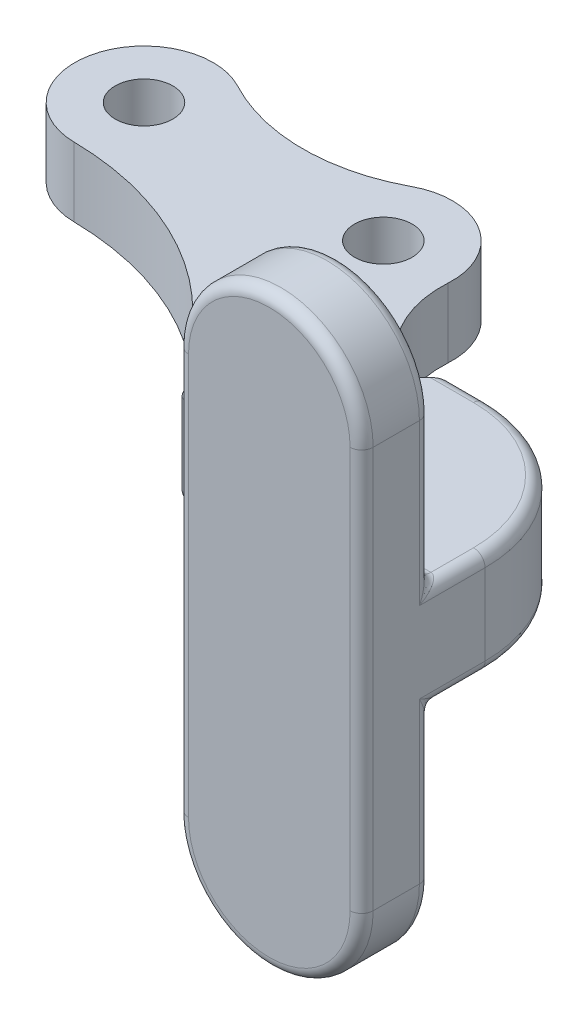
ISO-10303-21;
HEADER;
FILE_DESCRIPTION(('STEP AP214'),'2;1');
FILE_NAME('part.step','',(''),(''),'','','');
FILE_SCHEMA(('AUTOMOTIVE_DESIGN { 1 0 10303 214 1 1 1 1 }'));
ENDSEC;
DATA;
#1=APPLICATION_CONTEXT('core data for automotive mechanical design processes');
#2=APPLICATION_PROTOCOL_DEFINITION('international standard','automotive_design',2000,#1);
#3=PRODUCT_CONTEXT('',#1,'mechanical');
#4=PRODUCT('Part','Part','',(#3));
#5=PRODUCT_RELATED_PRODUCT_CATEGORY('part','',(#4));
#6=PRODUCT_DEFINITION_FORMATION('','',#4);
#7=PRODUCT_DEFINITION_CONTEXT('part definition',#1,'design');
#8=PRODUCT_DEFINITION('design','',#6,#7);
#9=PRODUCT_DEFINITION_SHAPE('','',#8);
#10=(LENGTH_UNIT() NAMED_UNIT(*) SI_UNIT(.MILLI.,.METRE.));
#11=(NAMED_UNIT(*) PLANE_ANGLE_UNIT() SI_UNIT($,.RADIAN.));
#12=(NAMED_UNIT(*) SI_UNIT($,.STERADIAN.) SOLID_ANGLE_UNIT());
#13=UNCERTAINTY_MEASURE_WITH_UNIT(LENGTH_MEASURE(1.E-05),#10,'distance_accuracy_value','');
#14=(GEOMETRIC_REPRESENTATION_CONTEXT(3) GLOBAL_UNCERTAINTY_ASSIGNED_CONTEXT((#13)) GLOBAL_UNIT_ASSIGNED_CONTEXT((#10,
#11,#12)) REPRESENTATION_CONTEXT('',''));
#15=CARTESIAN_POINT('',(0.,0.,0.));
#16=DIRECTION('',(0.,0.,1.));
#17=DIRECTION('',(1.,0.,0.));
#18=AXIS2_PLACEMENT_3D('',#15,#16,#17);
#19=CARTESIAN_POINT('',(46.5699324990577,3.01841884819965E-13,-14.2240000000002));
#20=DIRECTION('',(0.,1.,0.));
#21=DIRECTION('',(-1.,0.,0.));
#22=AXIS2_PLACEMENT_3D('',#19,#20,#21);
#23=CYLINDRICAL_SURFACE('',#22,40.);
#24=CARTESIAN_POINT('',(46.5699324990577,-2.99999999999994,-14.2240000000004));
#25=DIRECTION('',(0.,1.,0.));
#26=DIRECTION('',(-1.,0.,0.));
#27=AXIS2_PLACEMENT_3D('',#24,#25,#26);
#28=CIRCLE('',#27,40.);
#29=CARTESIAN_POINT('',(17.972576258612,-2.99999999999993,13.7436816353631));
#30=VERTEX_POINT('',#29);
#31=CARTESIAN_POINT('',(25.3942360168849,-2.99999999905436,19.7110832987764));
#32=VERTEX_POINT('',#31);
#33=EDGE_CURVE('E18',#30,#32,#28,.T.);
#34=ORIENTED_EDGE('',*,*,#33,.T.);
#35=DIRECTION('',(0.,1.,0.));
#36=VECTOR('',#35,1.);
#37=CARTESIAN_POINT('',(25.3942360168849,3.6949610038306E-13,19.7110832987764));
#38=LINE('',#37,#36);
#39=CARTESIAN_POINT('',(25.3942360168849,3.00000000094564,19.7110832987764));
#40=VERTEX_POINT('',#39);
#41=EDGE_CURVE('E88',#32,#40,#38,.T.);
#42=ORIENTED_EDGE('',*,*,#41,.T.);
#43=CARTESIAN_POINT('',(46.5699324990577,3.00000000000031,-14.2240000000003));
#44=DIRECTION('',(0.,1.,0.));
#45=DIRECTION('',(-1.,0.,0.));
#46=AXIS2_PLACEMENT_3D('',#43,#44,#45);
#47=CIRCLE('',#46,40.);
#48=CARTESIAN_POINT('',(17.9725762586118,3.00000000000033,13.7436816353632));
#49=VERTEX_POINT('',#48);
#50=EDGE_CURVE('E73',#40,#49,#47,.F.);
#51=ORIENTED_EDGE('',*,*,#50,.T.);
#52=DIRECTION('',(0.,1.,0.));
#53=VECTOR('',#52,1.);
#54=CARTESIAN_POINT('',(17.9725762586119,3.19189119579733E-13,13.7436816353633));
#55=LINE('',#54,#53);
#56=EDGE_CURVE('E68',#49,#30,#55,.F.);
#57=ORIENTED_EDGE('',*,*,#56,.T.);
#58=EDGE_LOOP('',(#34,#42,#51,#57));
#59=FACE_BOUND('',#58,.T.);
#60=ADVANCED_FACE('F14',(#59),#23,.T.);
#61=CARTESIAN_POINT('',(38.720857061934,3.0000000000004,20.2891226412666));
#62=DIRECTION('',(0.,-1.,0.));
#63=DIRECTION('',(1.,0.,0.));
#64=AXIS2_PLACEMENT_3D('',#61,#62,#63);
#65=PLANE('',#64);
#66=CARTESIAN_POINT('',(0.,3.00000000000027,0.));
#67=DIRECTION('',(0.,1.,0.));
#68=DIRECTION('',(-1.,0.,0.));
#69=AXIS2_PLACEMENT_3D('',#66,#67,#68);
#70=CIRCLE('',#69,2.5);
#71=CARTESIAN_POINT('',(-2.5,3.00000000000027,0.));
#72=VERTEX_POINT('',#71);
#73=EDGE_CURVE('E125',#72,#72,#70,.T.);
#74=ORIENTED_EDGE('',*,*,#73,.F.);
#75=EDGE_LOOP('',(#74));
#76=FACE_BOUND('',#75,.T.);
#77=CARTESIAN_POINT('',(20.75,3.00000000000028,0.));
#78=DIRECTION('',(0.,1.,0.));
#79=DIRECTION('',(-1.,0.,0.));
#80=AXIS2_PLACEMENT_3D('',#77,#78,#79);
#81=CIRCLE('',#80,2.5);
#82=CARTESIAN_POINT('',(18.25,3.00000000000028,0.));
#83=VERTEX_POINT('',#82);
#84=EDGE_CURVE('E122',#83,#83,#81,.T.);
#85=ORIENTED_EDGE('',*,*,#84,.F.);
#86=EDGE_LOOP('',(#85));
#87=FACE_BOUND('',#86,.T.);
#88=ORIENTED_EDGE('',*,*,#50,.F.);
#89=DIRECTION('',(-0.677210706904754,0.,0.73578913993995));
#90=VECTOR('',#89,1.);
#91=CARTESIAN_POINT('',(25.2951717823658,3.00000000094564,19.8187165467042));
#92=LINE('',#91,#90);
#93=CARTESIAN_POINT('',(34.1319672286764,3.00000000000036,10.2175421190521));
#94=VERTEX_POINT('',#93);
#95=EDGE_CURVE('E33',#40,#94,#92,.F.);
#96=ORIENTED_EDGE('',*,*,#95,.T.);
#97=CARTESIAN_POINT('',(36.220857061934,3.00000000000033,0.950043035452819));
#98=DIRECTION('',(0.,1.,0.));
#99=DIRECTION('',(-1.,0.,0.));
#100=AXIS2_PLACEMENT_3D('',#97,#98,#99);
#101=CIRCLE('',#100,9.5);
#102=CARTESIAN_POINT('',(26.7387188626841,3.00000000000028,0.367758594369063));
#103=VERTEX_POINT('',#102);
#104=EDGE_CURVE('E119',#103,#94,#101,.T.);
#105=ORIENTED_EDGE('',*,*,#104,.F.);
#106=CARTESIAN_POINT('',(20.75,3.00000000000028,0.));
#107=DIRECTION('',(0.,1.,0.));
#108=DIRECTION('',(-1.,0.,0.));
#109=AXIS2_PLACEMENT_3D('',#106,#107,#108);
#110=CIRCLE('',#109,6.);
#111=CARTESIAN_POINT('',(17.9204545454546,3.00000000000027,-5.29090469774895));
#112=VERTEX_POINT('',#111);
#113=EDGE_CURVE('E116',#112,#103,#110,.F.);
#114=ORIENTED_EDGE('',*,*,#113,.F.);
#115=CARTESIAN_POINT('',(10.375,3.00000000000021,-19.399983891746));
#116=DIRECTION('',(0.,1.,0.));
#117=DIRECTION('',(-1.,0.,0.));
#118=AXIS2_PLACEMENT_3D('',#115,#116,#117);
#119=CIRCLE('',#118,16.);
#120=CARTESIAN_POINT('',(2.82954545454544,3.00000000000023,-5.29090469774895));
#121=VERTEX_POINT('',#120);
#122=EDGE_CURVE('E113',#121,#112,#119,.T.);
#123=ORIENTED_EDGE('',*,*,#122,.F.);
#124=CARTESIAN_POINT('',(0.,3.00000000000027,0.));
#125=DIRECTION('',(0.,1.,0.));
#126=DIRECTION('',(-1.,0.,0.));
#127=AXIS2_PLACEMENT_3D('',#124,#125,#126);
#128=CIRCLE('',#127,6.);
#129=CARTESIAN_POINT('',(-0.0829797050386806,3.00000000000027,5.99942616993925));
#130=VERTEX_POINT('',#129);
#131=EDGE_CURVE('E111',#130,#121,#128,.F.);
#132=ORIENTED_EDGE('',*,*,#131,.F.);
#133=CARTESIAN_POINT('',(-0.439142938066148,3.0000000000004,31.75));
#134=DIRECTION('',(0.,1.,0.));
#135=DIRECTION('',(-1.,0.,0.));
#136=AXIS2_PLACEMENT_3D('',#133,#134,#135);
#137=CIRCLE('',#136,25.7530368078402);
#138=EDGE_CURVE('E108',#49,#130,#137,.T.);
#139=ORIENTED_EDGE('',*,*,#138,.F.);
#140=EDGE_LOOP('',(#88,#96,#105,#114,#123,#132,#139));
#141=FACE_BOUND('',#140,.T.);
#142=ADVANCED_FACE('F900',(#76,#87,#141),#65,.F.);
#143=CARTESIAN_POINT('',(0.,2.70616862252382E-13,0.));
#144=DIRECTION('',(0.,1.,0.));
#145=DIRECTION('',(-1.,0.,0.));
#146=AXIS2_PLACEMENT_3D('',#143,#144,#145);
#147=CYLINDRICAL_SURFACE('',#146,2.5);
#148=ORIENTED_EDGE('',*,*,#73,.T.);
#149=EDGE_LOOP('',(#148));
#150=FACE_BOUND('',#149,.T.);
#151=CARTESIAN_POINT('',(0.,-3.,-1.38777878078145E-13));
#152=DIRECTION('',(0.,1.,0.));
#153=DIRECTION('',(-1.,0.,0.));
#154=AXIS2_PLACEMENT_3D('',#151,#152,#153);
#155=CIRCLE('',#154,2.5);
#156=CARTESIAN_POINT('',(-2.5,-3.,-1.28924648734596E-13));
#157=VERTEX_POINT('',#156);
#158=EDGE_CURVE('E79',#157,#157,#155,.T.);
#159=ORIENTED_EDGE('',*,*,#158,.F.);
#160=EDGE_LOOP('',(#159));
#161=FACE_BOUND('',#160,.T.);
#162=ADVANCED_FACE('F934',(#150,#161),#147,.F.);
#163=CARTESIAN_POINT('',(20.75,2.81025203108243E-13,0.));
#164=DIRECTION('',(0.,1.,0.));
#165=DIRECTION('',(-1.,0.,0.));
#166=AXIS2_PLACEMENT_3D('',#163,#164,#165);
#167=CYLINDRICAL_SURFACE('',#166,2.5);
#168=ORIENTED_EDGE('',*,*,#84,.T.);
#169=EDGE_LOOP('',(#168));
#170=FACE_BOUND('',#169,.T.);
#171=CARTESIAN_POINT('',(20.75,-3.,-2.15105711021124E-13));
#172=DIRECTION('',(0.,1.,0.));
#173=DIRECTION('',(-1.,0.,0.));
#174=AXIS2_PLACEMENT_3D('',#171,#172,#173);
#175=CIRCLE('',#174,2.5);
#176=CARTESIAN_POINT('',(18.25,-3.,-2.05252481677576E-13));
#177=VERTEX_POINT('',#176);
#178=EDGE_CURVE('E102',#177,#177,#175,.T.);
#179=ORIENTED_EDGE('',*,*,#178,.F.);
#180=EDGE_LOOP('',(#179));
#181=FACE_BOUND('',#180,.T.);
#182=ADVANCED_FACE('F926',(#170,#181),#167,.F.);
#183=CARTESIAN_POINT('',(38.720857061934,-2.99999999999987,20.2891226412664));
#184=DIRECTION('',(0.,-1.,0.));
#185=DIRECTION('',(1.,0.,0.));
#186=AXIS2_PLACEMENT_3D('',#183,#184,#185);
#187=PLANE('',#186);
#188=ORIENTED_EDGE('',*,*,#158,.T.);
#189=EDGE_LOOP('',(#188));
#190=FACE_BOUND('',#189,.T.);
#191=ORIENTED_EDGE('',*,*,#178,.T.);
#192=EDGE_LOOP('',(#191));
#193=FACE_BOUND('',#192,.T.);
#194=DIRECTION('',(-0.677210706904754,0.,0.73578913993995));
#195=VECTOR('',#194,1.);
#196=CARTESIAN_POINT('',(25.2951717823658,-2.99999999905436,19.8187165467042));
#197=LINE('',#196,#195);
#198=CARTESIAN_POINT('',(34.1319672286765,-2.99999999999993,10.217542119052));
#199=VERTEX_POINT('',#198);
#200=EDGE_CURVE('E87',#199,#32,#197,.T.);
#201=ORIENTED_EDGE('',*,*,#200,.T.);
#202=ORIENTED_EDGE('',*,*,#33,.F.);
#203=CARTESIAN_POINT('',(-0.439142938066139,-2.99999999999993,31.75));
#204=DIRECTION('',(0.,1.,0.));
#205=DIRECTION('',(-1.,0.,0.));
#206=AXIS2_PLACEMENT_3D('',#203,#204,#205);
#207=CIRCLE('',#206,25.7530368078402);
#208=CARTESIAN_POINT('',(-0.0829797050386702,-3.,5.99942616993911));
#209=VERTEX_POINT('',#208);
#210=EDGE_CURVE('E85',#30,#209,#207,.T.);
#211=ORIENTED_EDGE('',*,*,#210,.T.);
#212=CARTESIAN_POINT('',(0.,-3.,-1.38777878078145E-13));
#213=DIRECTION('',(0.,1.,0.));
#214=DIRECTION('',(-1.,0.,0.));
#215=AXIS2_PLACEMENT_3D('',#212,#213,#214);
#216=CIRCLE('',#215,6.);
#217=CARTESIAN_POINT('',(2.82954545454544,-3.,-5.29090469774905));
#218=VERTEX_POINT('',#217);
#219=EDGE_CURVE('E91',#218,#209,#216,.T.);
#220=ORIENTED_EDGE('',*,*,#219,.F.);
#221=CARTESIAN_POINT('',(10.375,-3.00000000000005,-19.3999838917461));
#222=DIRECTION('',(0.,1.,0.));
#223=DIRECTION('',(-1.,0.,0.));
#224=AXIS2_PLACEMENT_3D('',#221,#222,#223);
#225=CIRCLE('',#224,16.);
#226=CARTESIAN_POINT('',(17.9204545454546,-3.,-5.2909046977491));
#227=VERTEX_POINT('',#226);
#228=EDGE_CURVE('E92',#218,#227,#225,.T.);
#229=ORIENTED_EDGE('',*,*,#228,.T.);
#230=CARTESIAN_POINT('',(20.75,-3.,-2.15105711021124E-13));
#231=DIRECTION('',(0.,1.,0.));
#232=DIRECTION('',(-1.,0.,0.));
#233=AXIS2_PLACEMENT_3D('',#230,#231,#232);
#234=CIRCLE('',#233,6.);
#235=CARTESIAN_POINT('',(26.7387188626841,-2.99999999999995,0.36775859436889));
#236=VERTEX_POINT('',#235);
#237=EDGE_CURVE('E97',#236,#227,#234,.T.);
#238=ORIENTED_EDGE('',*,*,#237,.F.);
#239=CARTESIAN_POINT('',(36.220857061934,-2.99999999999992,0.95004303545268));
#240=DIRECTION('',(0.,1.,0.));
#241=DIRECTION('',(-1.,0.,0.));
#242=AXIS2_PLACEMENT_3D('',#239,#240,#241);
#243=CIRCLE('',#242,9.5);
#244=EDGE_CURVE('E100',#236,#199,#243,.T.);
#245=ORIENTED_EDGE('',*,*,#244,.T.);
#246=EDGE_LOOP('',(#201,#202,#211,#220,#229,#238,#245));
#247=FACE_BOUND('',#246,.T.);
#248=ADVANCED_FACE('F16',(#190,#193,#247),#187,.T.);
#249=CARTESIAN_POINT('',(36.220857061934,3.22658566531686E-13,0.950043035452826));
#250=DIRECTION('',(0.,1.,0.));
#251=DIRECTION('',(-1.,0.,0.));
#252=AXIS2_PLACEMENT_3D('',#249,#250,#251);
#253=CYLINDRICAL_SURFACE('',#252,9.5);
#254=ORIENTED_EDGE('',*,*,#104,.T.);
#255=DIRECTION('',(0.,1.,0.));
#256=VECTOR('',#255,1.);
#257=CARTESIAN_POINT('',(34.1319672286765,-2.99999999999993,10.217542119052));
#258=LINE('',#257,#256);
#259=EDGE_CURVE('E9',#94,#199,#258,.F.);
#260=ORIENTED_EDGE('',*,*,#259,.T.);
#261=ORIENTED_EDGE('',*,*,#244,.F.);
#262=DIRECTION('',(0.,1.,0.));
#263=VECTOR('',#262,1.);
#264=CARTESIAN_POINT('',(26.7387188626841,3.07046055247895E-13,0.367758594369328));
#265=LINE('',#264,#263);
#266=EDGE_CURVE('E132',#103,#236,#265,.F.);
#267=ORIENTED_EDGE('',*,*,#266,.F.);
#268=EDGE_LOOP('',(#254,#260,#261,#267));
#269=FACE_BOUND('',#268,.T.);
#270=ADVANCED_FACE('F916',(#269),#253,.F.);
#271=CARTESIAN_POINT('',(20.75,2.81025203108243E-13,0.));
#272=DIRECTION('',(0.,1.,0.));
#273=DIRECTION('',(-1.,0.,0.));
#274=AXIS2_PLACEMENT_3D('',#271,#272,#273);
#275=CYLINDRICAL_SURFACE('',#274,6.);
#276=ORIENTED_EDGE('',*,*,#266,.T.);
#277=ORIENTED_EDGE('',*,*,#237,.T.);
#278=DIRECTION('',(0.,1.,0.));
#279=VECTOR('',#278,1.);
#280=CARTESIAN_POINT('',(17.9204545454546,2.74086309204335E-13,-5.29090469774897));
#281=LINE('',#280,#279);
#282=EDGE_CURVE('E109',#227,#112,#281,.T.);
#283=ORIENTED_EDGE('',*,*,#282,.T.);
#284=ORIENTED_EDGE('',*,*,#113,.T.);
#285=EDGE_LOOP('',(#276,#277,#283,#284));
#286=FACE_BOUND('',#285,.T.);
#287=ADVANCED_FACE('F913',(#286),#275,.T.);
#288=CARTESIAN_POINT('',(10.375,2.13370987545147E-13,-19.399983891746));
#289=DIRECTION('',(0.,1.,0.));
#290=DIRECTION('',(-1.,0.,0.));
#291=AXIS2_PLACEMENT_3D('',#288,#289,#290);
#292=CYLINDRICAL_SURFACE('',#291,16.);
#293=ORIENTED_EDGE('',*,*,#282,.F.);
#294=ORIENTED_EDGE('',*,*,#228,.F.);
#295=DIRECTION('',(0.,1.,0.));
#296=VECTOR('',#295,1.);
#297=CARTESIAN_POINT('',(2.82954545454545,2.32452945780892E-13,-5.29090469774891));
#298=LINE('',#297,#296);
#299=EDGE_CURVE('E130',#121,#218,#298,.F.);
#300=ORIENTED_EDGE('',*,*,#299,.F.);
#301=ORIENTED_EDGE('',*,*,#122,.T.);
#302=EDGE_LOOP('',(#293,#294,#300,#301));
#303=FACE_BOUND('',#302,.T.);
#304=ADVANCED_FACE('F909',(#303),#292,.F.);
#305=CARTESIAN_POINT('',(0.,2.70616862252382E-13,0.));
#306=DIRECTION('',(0.,1.,0.));
#307=DIRECTION('',(-1.,0.,0.));
#308=AXIS2_PLACEMENT_3D('',#305,#306,#307);
#309=CYLINDRICAL_SURFACE('',#308,6.);
#310=ORIENTED_EDGE('',*,*,#131,.T.);
#311=ORIENTED_EDGE('',*,*,#299,.T.);
#312=ORIENTED_EDGE('',*,*,#219,.T.);
#313=DIRECTION('',(0.,1.,0.));
#314=VECTOR('',#313,1.);
#315=CARTESIAN_POINT('',(-0.0829797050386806,2.70616862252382E-13,5.99942616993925));
#316=LINE('',#315,#314);
#317=EDGE_CURVE('E78',#209,#130,#316,.T.);
#318=ORIENTED_EDGE('',*,*,#317,.T.);
#319=EDGE_LOOP('',(#310,#311,#312,#318));
#320=FACE_BOUND('',#319,.T.);
#321=ADVANCED_FACE('F906',(#320),#309,.T.);
#322=CARTESIAN_POINT('',(-0.439142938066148,3.71230823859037E-13,31.75));
#323=DIRECTION('',(0.,1.,0.));
#324=DIRECTION('',(-1.,0.,0.));
#325=AXIS2_PLACEMENT_3D('',#322,#323,#324);
#326=CYLINDRICAL_SURFACE('',#325,25.7530368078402);
#327=ORIENTED_EDGE('',*,*,#317,.F.);
#328=ORIENTED_EDGE('',*,*,#210,.F.);
#329=ORIENTED_EDGE('',*,*,#56,.F.);
#330=ORIENTED_EDGE('',*,*,#138,.T.);
#331=EDGE_LOOP('',(#327,#328,#329,#330));
#332=FACE_BOUND('',#331,.T.);
#333=ADVANCED_FACE('F89',(#332),#326,.F.);
#334=CARTESIAN_POINT('',(25.2951717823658,-2.99999999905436,19.8187165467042));
#335=DIRECTION('',(0.73578913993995,0.,0.677210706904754));
#336=DIRECTION('',(-0.677210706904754,0.,0.73578913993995));
#337=AXIS2_PLACEMENT_3D('',#334,#335,#336);
#338=PLANE('',#337);
#339=ORIENTED_EDGE('',*,*,#259,.F.);
#340=ORIENTED_EDGE('',*,*,#95,.F.);
#341=ORIENTED_EDGE('',*,*,#41,.F.);
#342=ORIENTED_EDGE('',*,*,#200,.F.);
#343=EDGE_LOOP('',(#339,#340,#341,#342));
#344=FACE_BOUND('',#343,.T.);
#345=CARTESIAN_POINT('',(34.5637063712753,3.50500000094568,9.7484577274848));
#346=DIRECTION('',(0.73578913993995,0.,0.677210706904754));
#347=DIRECTION('',(0.677210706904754,0.,-0.73578913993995));
#348=AXIS2_PLACEMENT_3D('',#345,#346,#347);
#349=ELLIPSE('',#348,1.3590850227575,1.);
#350=CARTESIAN_POINT('',(35.4840933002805,3.50500000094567,8.74845772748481));
#351=VERTEX_POINT('',#350);
#352=CARTESIAN_POINT('',(34.5637063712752,4.50500000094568,9.74845772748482));
#353=VERTEX_POINT('',#352);
#354=EDGE_CURVE('E146',#351,#353,#349,.T.);
#355=ORIENTED_EDGE('',*,*,#354,.F.);
#356=DIRECTION('',(0.,-1.,0.));
#357=VECTOR('',#356,1.);
#358=CARTESIAN_POINT('',(35.4840933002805,-2.99999999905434,8.74845772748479));
#359=LINE('',#358,#357);
#360=CARTESIAN_POINT('',(35.4840933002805,-3.50499999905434,8.74845772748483));
#361=VERTEX_POINT('',#360);
#362=EDGE_CURVE('E143',#351,#361,#359,.T.);
#363=ORIENTED_EDGE('',*,*,#362,.T.);
#364=CARTESIAN_POINT('',(34.5637063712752,-3.50499999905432,9.74845772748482));
#365=DIRECTION('',(0.73578913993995,0.,0.677210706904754));
#366=DIRECTION('',(-0.677210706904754,0.,0.73578913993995));
#367=AXIS2_PLACEMENT_3D('',#364,#365,#366);
#368=ELLIPSE('',#367,1.3590850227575,1.);
#369=CARTESIAN_POINT('',(34.5637063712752,-4.50499999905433,9.74845772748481));
#370=VERTEX_POINT('',#369);
#371=EDGE_CURVE('E127',#370,#361,#368,.T.);
#372=ORIENTED_EDGE('',*,*,#371,.F.);
#373=DIRECTION('',(0.677210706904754,0.,-0.73578913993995));
#374=VECTOR('',#373,1.);
#375=CARTESIAN_POINT('',(24.9459766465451,-4.50499999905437,20.1981169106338));
#376=LINE('',#375,#374);
#377=CARTESIAN_POINT('',(24.9459766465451,-4.50499999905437,20.1981169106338));
#378=VERTEX_POINT('',#377);
#379=EDGE_CURVE('E1659',#378,#370,#376,.T.);
#380=ORIENTED_EDGE('',*,*,#379,.F.);
#381=CARTESIAN_POINT('',(24.2550341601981,-3.50499999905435,20.9488256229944));
#382=CARTESIAN_POINT('',(24.2550340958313,-3.53273616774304,20.9488256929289));
#383=CARTESIAN_POINT('',(24.255831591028,-3.56045891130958,20.9479592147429));
#384=CARTESIAN_POINT('',(24.259011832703,-3.61570301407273,20.9445038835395));
#385=CARTESIAN_POINT('',(24.2613944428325,-3.64322439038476,20.941915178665));
#386=CARTESIAN_POINT('',(24.2708915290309,-3.72511268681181,20.9315965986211));
#387=CARTESIAN_POINT('',(24.2803553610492,-3.77892620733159,20.9213141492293));
#388=CARTESIAN_POINT('',(24.3052561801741,-3.88343384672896,20.8942594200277));
#389=CARTESIAN_POINT('',(24.3206949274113,-3.93412704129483,20.8774852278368));
#390=CARTESIAN_POINT('',(24.3570703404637,-4.03101385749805,20.8379633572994));
#391=CARTESIAN_POINT('',(24.3780068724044,-4.07720758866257,20.8152158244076));
#392=CARTESIAN_POINT('',(24.4249475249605,-4.16421883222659,20.7642148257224));
#393=CARTESIAN_POINT('',(24.4509924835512,-4.20498825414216,20.7359169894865));
#394=CARTESIAN_POINT('',(24.5072756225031,-4.27963722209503,20.6747653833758));
#395=CARTESIAN_POINT('',(24.5375143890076,-4.31351580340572,20.6419109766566));
#396=CARTESIAN_POINT('',(24.601920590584,-4.37408987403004,20.5719336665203));
#397=CARTESIAN_POINT('',(24.6361506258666,-4.40064007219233,20.5347427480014));
#398=CARTESIAN_POINT('',(24.7071019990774,-4.44504305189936,20.4576541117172));
#399=CARTESIAN_POINT('',(24.743822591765,-4.46289842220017,20.4177572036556));
#400=CARTESIAN_POINT('',(24.8082308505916,-4.48576711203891,20.3477776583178));
#401=CARTESIAN_POINT('',(24.8355712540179,-4.49297574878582,20.3180723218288));
#402=CARTESIAN_POINT('',(24.8905969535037,-4.50259208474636,20.2582869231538));
#403=CARTESIAN_POINT('',(24.9182817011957,-4.50500662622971,20.2282074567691));
#404=CARTESIAN_POINT('',(24.9459766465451,-4.50499999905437,20.1981169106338));
#405=B_SPLINE_CURVE_WITH_KNOTS('',3,(#381,#382,#383,#384,#385,#386,#387,#388,#389,#390,#391,
#392,#393,#394,#395,#396,#397,#398,#399,#400,#401,#402,#403,#404),.UNSPECIFIED.,.F.,.F.,(4,2,2,
2,2,2,2,2,2,2,2,4),(0.,0.0831569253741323,0.166306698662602,0.332243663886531,0.49822954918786,
0.664211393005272,0.831578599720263,0.998969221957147,1.16947261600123,1.33992521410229,
1.46268676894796,1.58527298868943),.UNSPECIFIED.);
#406=CARTESIAN_POINT('',(24.2550341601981,-3.50499999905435,20.9488256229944));
#407=VERTEX_POINT('',#406);
#408=EDGE_CURVE('E153',#407,#378,#405,.T.);
#409=ORIENTED_EDGE('',*,*,#408,.F.);
#410=DIRECTION('',(0.,1.,0.));
#411=VECTOR('',#410,1.);
#412=CARTESIAN_POINT('',(24.2550341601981,-2.99999999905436,20.9488256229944));
#413=LINE('',#412,#411);
#414=CARTESIAN_POINT('',(24.2550341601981,3.50500000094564,20.9488256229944));
#415=VERTEX_POINT('',#414);
#416=EDGE_CURVE('E287',#415,#407,#413,.F.);
#417=ORIENTED_EDGE('',*,*,#416,.F.);
#418=CARTESIAN_POINT('',(24.9459766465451,4.50500000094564,20.1981169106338));
#419=CARTESIAN_POINT('',(24.9065106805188,4.50503834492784,20.2409966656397));
#420=CARTESIAN_POINT('',(24.8670574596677,4.50011203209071,20.2838625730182));
#421=CARTESIAN_POINT('',(24.7892642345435,4.4806229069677,20.368384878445));
#422=CARTESIAN_POINT('',(24.7509240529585,4.46606163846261,20.4100414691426));
#423=CARTESIAN_POINT('',(24.6764050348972,4.42758168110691,20.4910063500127));
#424=CARTESIAN_POINT('',(24.6402277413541,4.40365640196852,20.5303129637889));
#425=CARTESIAN_POINT('',(24.5884617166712,4.3612827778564,20.5865567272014));
#426=CARTESIAN_POINT('',(24.5716226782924,4.34607687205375,20.6048523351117));
#427=CARTESIAN_POINT('',(24.5388677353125,4.31358086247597,20.6404405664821));
#428=CARTESIAN_POINT('',(24.5229528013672,4.29628862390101,20.6577321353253));
#429=CARTESIAN_POINT('',(24.4771341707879,4.2418544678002,20.7075140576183));
#430=CARTESIAN_POINT('',(24.4487643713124,4.20183322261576,20.7383378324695));
#431=CARTESIAN_POINT('',(24.397096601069,4.11519903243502,20.7944748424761));
#432=CARTESIAN_POINT('',(24.3737976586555,4.06858735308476,20.8197891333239));
#433=CARTESIAN_POINT('',(24.3434055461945,3.99523846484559,20.8528101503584));
#434=CARTESIAN_POINT('',(24.3340980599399,3.97045440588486,20.8629227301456));
#435=CARTESIAN_POINT('',(24.3169585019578,3.91982771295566,20.8815448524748));
#436=CARTESIAN_POINT('',(24.3091251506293,3.89398602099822,20.8900557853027));
#437=CARTESIAN_POINT('',(24.2879345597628,3.81512859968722,20.9130793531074));
#438=CARTESIAN_POINT('',(24.2768593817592,3.76071436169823,20.9251125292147));
#439=CARTESIAN_POINT('',(24.2643814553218,3.6724032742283,20.9386697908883));
#440=CARTESIAN_POINT('',(24.2608783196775,3.63911083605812,20.9424759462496));
#441=CARTESIAN_POINT('',(24.2562060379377,3.57221958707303,20.9475523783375));
#442=CARTESIAN_POINT('',(24.2550335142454,3.53862129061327,20.9488263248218));
#443=CARTESIAN_POINT('',(24.255034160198,3.50500000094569,20.9488256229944));
#444=B_SPLINE_CURVE_WITH_KNOTS('',3,(#418,#419,#420,#421,#422,#423,#424,#425,#426,#427,#428,
#429,#430,#431,#432,#433,#434,#435,#436,#437,#438,#439,#440,#441,#442,#443),.UNSPECIFIED.,.F.,
.F.,(4,2,2,2,2,2,2,2,2,2,2,2,4),(0.,0.174591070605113,0.34915417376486,0.523840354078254,
0.611187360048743,0.698624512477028,0.871537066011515,1.04441645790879,1.12934379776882,
1.21419707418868,1.38367390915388,1.48459430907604,1.58536834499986),.UNSPECIFIED.);
#445=CARTESIAN_POINT('',(24.9459766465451,4.50500000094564,20.1981169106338));
#446=VERTEX_POINT('',#445);
#447=EDGE_CURVE('E149',#446,#415,#444,.T.);
#448=ORIENTED_EDGE('',*,*,#447,.F.);
#449=DIRECTION('',(0.677210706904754,0.,-0.73578913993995));
#450=VECTOR('',#449,1.);
#451=CARTESIAN_POINT('',(24.9459766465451,4.50500000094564,20.1981169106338));
#452=LINE('',#451,#450);
#453=EDGE_CURVE('E1531',#446,#353,#452,.T.);
#454=ORIENTED_EDGE('',*,*,#453,.T.);
#455=EDGE_LOOP('',(#355,#363,#372,#380,#409,#417,#448,#454));
#456=FACE_BOUND('',#455,.T.);
#457=ADVANCED_FACE('F163',(#344,#456),#338,.F.);
#458=CARTESIAN_POINT('',(38.3208570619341,3.50500000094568,9.7484577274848));
#459=DIRECTION('',(1.,0.,0.));
#460=DIRECTION('',(0.,0.,1.));
#461=AXIS2_PLACEMENT_3D('',#458,#459,#460);
#462=CYLINDRICAL_SURFACE('',#461,1.);
#463=CARTESIAN_POINT('',(38.3208570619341,3.50500000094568,9.7484577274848));
#464=DIRECTION('',(1.,0.,0.));
#465=DIRECTION('',(0.,0.,-1.));
#466=AXIS2_PLACEMENT_3D('',#463,#464,#465);
#467=CIRCLE('',#466,1.);
#468=CARTESIAN_POINT('',(38.320857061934,3.50500000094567,8.74845772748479));
#469=VERTEX_POINT('',#468);
#470=CARTESIAN_POINT('',(38.3208570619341,4.50500000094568,9.74845772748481));
#471=VERTEX_POINT('',#470);
#472=EDGE_CURVE('E1528',#469,#471,#467,.T.);
#473=ORIENTED_EDGE('',*,*,#472,.F.);
#474=DIRECTION('',(-1.,0.,0.));
#475=VECTOR('',#474,1.);
#476=CARTESIAN_POINT('',(38.3208570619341,3.50500000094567,8.74845772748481));
#477=LINE('',#476,#475);
#478=EDGE_CURVE('E1512',#469,#351,#477,.T.);
#479=ORIENTED_EDGE('',*,*,#478,.T.);
#480=ORIENTED_EDGE('',*,*,#354,.T.);
#481=DIRECTION('',(-1.,0.,0.));
#482=VECTOR('',#481,1.);
#483=CARTESIAN_POINT('',(38.3208570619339,4.50500000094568,9.74845772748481));
#484=LINE('',#483,#482);
#485=EDGE_CURVE('E1770',#353,#471,#484,.F.);
#486=ORIENTED_EDGE('',*,*,#485,.T.);
#487=EDGE_LOOP('',(#473,#479,#480,#486));
#488=FACE_BOUND('',#487,.T.);
#489=ADVANCED_FACE('F970',(#488),#462,.T.);
#490=CARTESIAN_POINT('',(38.3208570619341,-2.99999999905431,8.74845772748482));
#491=DIRECTION('',(0.,0.,1.));
#492=DIRECTION('',(-1.,0.,0.));
#493=AXIS2_PLACEMENT_3D('',#490,#491,#492);
#494=PLANE('',#493);
#495=ORIENTED_EDGE('',*,*,#478,.F.);
#496=DIRECTION('',(0.,1.,0.));
#497=VECTOR('',#496,1.);
#498=CARTESIAN_POINT('',(38.320857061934,-2.99999999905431,8.7484577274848));
#499=LINE('',#498,#497);
#500=CARTESIAN_POINT('',(38.3208570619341,-3.5049999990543,8.74845772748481));
#501=VERTEX_POINT('',#500);
#502=EDGE_CURVE('E1515',#501,#469,#499,.T.);
#503=ORIENTED_EDGE('',*,*,#502,.F.);
#504=DIRECTION('',(-1.,0.,0.));
#505=VECTOR('',#504,1.);
#506=CARTESIAN_POINT('',(38.3208570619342,-3.5049999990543,8.74845772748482));
#507=LINE('',#506,#505);
#508=EDGE_CURVE('E342',#361,#501,#507,.F.);
#509=ORIENTED_EDGE('',*,*,#508,.F.);
#510=ORIENTED_EDGE('',*,*,#362,.F.);
#511=EDGE_LOOP('',(#495,#503,#509,#510));
#512=FACE_BOUND('',#511,.T.);
#513=ADVANCED_FACE('F331',(#512),#494,.F.);
#514=CARTESIAN_POINT('',(38.320857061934,-3.50499999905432,9.74845772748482));
#515=DIRECTION('',(-1.,0.,0.));
#516=DIRECTION('',(0.,0.,-1.));
#517=AXIS2_PLACEMENT_3D('',#514,#515,#516);
#518=CYLINDRICAL_SURFACE('',#517,1.);
#519=CARTESIAN_POINT('',(38.3208570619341,-3.50499999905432,9.74845772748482));
#520=DIRECTION('',(1.,0.,0.));
#521=DIRECTION('',(0.,0.,-1.));
#522=AXIS2_PLACEMENT_3D('',#519,#520,#521);
#523=CIRCLE('',#522,1.);
#524=CARTESIAN_POINT('',(38.3208570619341,-4.50499999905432,9.74845772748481));
#525=VERTEX_POINT('',#524);
#526=EDGE_CURVE('E343',#525,#501,#523,.T.);
#527=ORIENTED_EDGE('',*,*,#526,.F.);
#528=DIRECTION('',(-1.,0.,0.));
#529=VECTOR('',#528,1.);
#530=CARTESIAN_POINT('',(38.3208570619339,-4.50499999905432,9.7484577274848));
#531=LINE('',#530,#529);
#532=EDGE_CURVE('E1504',#370,#525,#531,.F.);
#533=ORIENTED_EDGE('',*,*,#532,.F.);
#534=ORIENTED_EDGE('',*,*,#371,.T.);
#535=ORIENTED_EDGE('',*,*,#508,.T.);
#536=EDGE_LOOP('',(#527,#533,#534,#535));
#537=FACE_BOUND('',#536,.T.);
#538=ADVANCED_FACE('F985',(#537),#518,.T.);
#539=CARTESIAN_POINT('',(38.320857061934,-4.50499999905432,20.6534577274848));
#540=DIRECTION('',(0.,-1.,0.));
#541=DIRECTION('',(0.,0.,1.));
#542=AXIS2_PLACEMENT_3D('',#539,#540,#541);
#543=PLANE('',#542);
#544=ORIENTED_EDGE('',*,*,#532,.T.);
#545=CARTESIAN_POINT('',(38.320857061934,-4.50499999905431,20.6534577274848));
#546=DIRECTION('',(0.,1.,0.));
#547=DIRECTION('',(1.,0.,0.));
#548=AXIS2_PLACEMENT_3D('',#545,#546,#547);
#549=CIRCLE('',#548,10.9050000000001);
#550=CARTESIAN_POINT('',(49.2258570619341,-4.50499999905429,20.6534577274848));
#551=VERTEX_POINT('',#550);
#552=EDGE_CURVE('E310',#525,#551,#549,.F.);
#553=ORIENTED_EDGE('',*,*,#552,.T.);
#554=DIRECTION('',(0.,0.,1.));
#555=VECTOR('',#554,1.);
#556=CARTESIAN_POINT('',(49.2258570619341,-4.50499999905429,20.6534577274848));
#557=LINE('',#556,#555);
#558=CARTESIAN_POINT('',(49.2258570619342,-4.50499999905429,24.3461064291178));
#559=VERTEX_POINT('',#558);
#560=EDGE_CURVE('E482',#559,#551,#557,.F.);
#561=ORIENTED_EDGE('',*,*,#560,.F.);
#562=DIRECTION('',(-1.,0.,0.));
#563=VECTOR('',#562,1.);
#564=CARTESIAN_POINT('',(38.320857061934,-4.50499999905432,24.3461064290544));
#565=LINE('',#564,#563);
#566=CARTESIAN_POINT('',(35.215857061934,-4.50499999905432,24.3461064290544));
#567=VERTEX_POINT('',#566);
#568=EDGE_CURVE('E1671',#559,#567,#565,.T.);
#569=ORIENTED_EDGE('',*,*,#568,.T.);
#570=CARTESIAN_POINT('',(35.2158570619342,-4.50499999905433,26.3461064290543));
#571=DIRECTION('',(0.,-1.,0.));
#572=DIRECTION('',(-0.280026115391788,0.,-0.959992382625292));
#573=AXIS2_PLACEMENT_3D('',#570,#571,#572);
#574=CIRCLE('',#573,1.99999999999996);
#575=CARTESIAN_POINT('',(34.655804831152,-4.50499999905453,24.4261216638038));
#576=VERTEX_POINT('',#575);
#577=EDGE_CURVE('E1674',#567,#576,#574,.F.);
#578=ORIENTED_EDGE('',*,*,#577,.T.);
#579=CARTESIAN_POINT('',(45.8329070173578,-4.50499999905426,-14.5062223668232));
#580=DIRECTION('',(0.,1.,0.));
#581=DIRECTION('',(-0.515663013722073,0.,0.856791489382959));
#582=AXIS2_PLACEMENT_3D('',#579,#580,#581);
#583=CIRCLE('',#582,40.5050000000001);
#584=EDGE_CURVE('E1661',#576,#378,#583,.F.);
#585=ORIENTED_EDGE('',*,*,#584,.T.);
#586=ORIENTED_EDGE('',*,*,#379,.T.);
#587=EDGE_LOOP('',(#544,#553,#561,#569,#578,#585,#586));
#588=FACE_BOUND('',#587,.T.);
#589=ADVANCED_FACE('F993',(#588),#543,.T.);
#590=CARTESIAN_POINT('',(45.8329070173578,-3.50499999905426,-14.5062223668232));
#591=DIRECTION('',(0.,-1.,0.));
#592=DIRECTION('',(0.,0.,1.));
#593=AXIS2_PLACEMENT_3D('',#590,#591,#592);
#594=TOROIDAL_SURFACE('',#593,40.5050000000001,1.);
#595=CARTESIAN_POINT('',(45.8329070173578,-3.50499999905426,-14.5062223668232));
#596=DIRECTION('',(0.,1.,0.));
#597=DIRECTION('',(0.,0.,-1.));
#598=AXIS2_PLACEMENT_3D('',#595,#596,#597);
#599=CIRCLE('',#598,41.505);
#600=CARTESIAN_POINT('',(33.5126939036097,-3.50499999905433,25.1280730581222));
#601=VERTEX_POINT('',#600);
#602=EDGE_CURVE('E296',#407,#601,#599,.T.);
#603=ORIENTED_EDGE('',*,*,#602,.F.);
#604=ORIENTED_EDGE('',*,*,#408,.T.);
#605=ORIENTED_EDGE('',*,*,#584,.F.);
#606=CARTESIAN_POINT('',(34.6558048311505,-4.50499999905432,24.4261216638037));
#607=CARTESIAN_POINT('',(34.627377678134,-4.50499713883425,24.4268732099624));
#608=CARTESIAN_POINT('',(34.5989575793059,-4.5048897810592,24.4280384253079));
#609=CARTESIAN_POINT('',(34.5430669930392,-4.50438889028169,24.4312319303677));
#610=CARTESIAN_POINT('',(34.5155947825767,-4.50400447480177,24.4332318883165));
#611=CARTESIAN_POINT('',(34.4615988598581,-4.50289986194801,24.4380909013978));
#612=CARTESIAN_POINT('',(34.4350723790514,-4.50219055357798,24.4409211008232));
#613=CARTESIAN_POINT('',(34.3829711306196,-4.5003794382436,24.4474343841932));
#614=CARTESIAN_POINT('',(34.3573923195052,-4.49929045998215,24.4510883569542));
#615=CARTESIAN_POINT('',(34.3071911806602,-4.4966616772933,24.459239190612));
#616=CARTESIAN_POINT('',(34.2825634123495,-4.49513658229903,24.463707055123));
#617=CARTESIAN_POINT('',(34.234268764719,-4.49157519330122,24.4734683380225));
#618=CARTESIAN_POINT('',(34.2105950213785,-4.48955536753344,24.4787334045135));
#619=CARTESIAN_POINT('',(34.1727925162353,-4.48579343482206,24.4879802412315));
#620=CARTESIAN_POINT('',(34.1585676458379,-4.48425395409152,24.4916535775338));
#621=CARTESIAN_POINT('',(34.1305892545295,-4.48094768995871,24.4992934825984));
#622=CARTESIAN_POINT('',(34.1168325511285,-4.47918715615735,24.5032510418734));
#623=CARTESIAN_POINT('',(34.0897930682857,-4.47542648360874,24.5114521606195));
#624=CARTESIAN_POINT('',(34.0765067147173,-4.4734328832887,24.5156869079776));
#625=CARTESIAN_POINT('',(34.0504108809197,-4.46919335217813,24.5244363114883));
#626=CARTESIAN_POINT('',(34.037597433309,-4.46695420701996,24.5289423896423));
#627=CARTESIAN_POINT('',(34.0124506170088,-4.46221100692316,24.5382270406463));
#628=CARTESIAN_POINT('',(34.0001129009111,-4.45971391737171,24.5429973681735));
#629=CARTESIAN_POINT('',(33.9759210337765,-4.4544423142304,24.5528023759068));
#630=CARTESIAN_POINT('',(33.9640621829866,-4.45167486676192,24.5578292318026));
#631=CARTESIAN_POINT('',(33.940831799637,-4.4458501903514,24.5681382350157));
#632=CARTESIAN_POINT('',(33.9294552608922,-4.44280003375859,24.573413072));
#633=CARTESIAN_POINT('',(33.90719350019,-4.43639778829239,24.5842080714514));
#634=CARTESIAN_POINT('',(33.8963030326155,-4.4330526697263,24.5897215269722));
#635=CARTESIAN_POINT('',(33.8750176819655,-4.42604862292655,24.6009828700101));
#636=CARTESIAN_POINT('',(33.864617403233,-4.42239644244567,24.6067247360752));
#637=CARTESIAN_POINT('',(33.8443168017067,-4.41476671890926,24.6184310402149));
#638=CARTESIAN_POINT('',(33.8344110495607,-4.41079557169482,24.6243902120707));
#639=CARTESIAN_POINT('',(33.8151044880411,-4.4025167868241,24.6365183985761));
#640=CARTESIAN_POINT('',(33.8056983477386,-4.39821505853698,24.6426829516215));
#641=CARTESIAN_POINT('',(33.7873946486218,-4.38926432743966,24.6552079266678));
#642=CARTESIAN_POINT('',(33.7784920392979,-4.38462061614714,24.661564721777));
#643=CARTESIAN_POINT('',(33.7649793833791,-4.37708190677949,24.6716446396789));
#644=CARTESIAN_POINT('',(33.7602234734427,-4.37432921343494,24.6752797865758));
#645=CARTESIAN_POINT('',(33.7508571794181,-4.36870073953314,24.6826172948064));
#646=CARTESIAN_POINT('',(33.74624651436,-4.36582522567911,24.686319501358));
#647=CARTESIAN_POINT('',(33.7371715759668,-4.35994871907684,24.6937874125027));
#648=CARTESIAN_POINT('',(33.7327071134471,-4.3569479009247,24.6975530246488));
#649=CARTESIAN_POINT('',(33.723925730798,-4.35081817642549,24.7051444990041));
#650=CARTESIAN_POINT('',(33.7196087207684,-4.34768935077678,24.7089703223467));
#651=CARTESIAN_POINT('',(33.7111233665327,-4.34130112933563,24.7166786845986));
#652=CARTESIAN_POINT('',(33.7069550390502,-4.33804171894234,24.7205612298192));
#653=CARTESIAN_POINT('',(33.6987682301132,-4.33138988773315,24.7283794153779));
#654=CARTESIAN_POINT('',(33.6947498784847,-4.32799735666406,24.7323150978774));
#655=CARTESIAN_POINT('',(33.6868642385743,-4.32107691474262,24.7402357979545));
#656=CARTESIAN_POINT('',(33.6829971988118,-4.31754879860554,24.7442208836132));
#657=CARTESIAN_POINT('',(33.6754154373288,-4.31035488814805,24.7522365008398));
#658=CARTESIAN_POINT('',(33.6717010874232,-4.30668879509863,24.7562671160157));
#659=CARTESIAN_POINT('',(33.6644260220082,-4.29921670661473,24.7643697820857));
#660=CARTESIAN_POINT('',(33.6608658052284,-4.29541032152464,24.76844192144));
#661=CARTESIAN_POINT('',(33.6539002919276,-4.28765551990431,24.7766234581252));
#662=CARTESIAN_POINT('',(33.6504956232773,-4.2837066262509,24.7807329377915));
#663=CARTESIAN_POINT('',(33.6438428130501,-4.27566472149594,24.7889849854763));
#664=CARTESIAN_POINT('',(33.6405954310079,-4.27157114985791,24.7931276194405));
#665=CARTESIAN_POINT('',(33.6342578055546,-4.26323807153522,24.8014411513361));
#666=CARTESIAN_POINT('',(33.6311684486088,-4.25899792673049,24.8056120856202));
#667=CARTESIAN_POINT('',(33.625495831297,-4.25086320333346,24.8135003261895));
#668=CARTESIAN_POINT('',(33.6228941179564,-4.24698135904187,24.8172175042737));
#669=CARTESIAN_POINT('',(33.6177880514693,-4.23905484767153,24.8247105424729));
#670=CARTESIAN_POINT('',(33.6152861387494,-4.23500852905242,24.8284863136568));
#671=CARTESIAN_POINT('',(33.6078635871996,-4.22251096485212,24.8399926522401));
#672=CARTESIAN_POINT('',(33.6031686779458,-4.21390576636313,24.8477031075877));
#673=CARTESIAN_POINT('',(33.5941799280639,-4.19600676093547,24.8632876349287));
#674=CARTESIAN_POINT('',(33.5899064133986,-4.18669933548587,24.8711577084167));
#675=CARTESIAN_POINT('',(33.5817763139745,-4.16736779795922,24.8870104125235));
#676=CARTESIAN_POINT('',(33.5779403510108,-4.15732994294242,24.8949868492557));
#677=CARTESIAN_POINT('',(33.5707069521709,-4.13651270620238,24.9109971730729));
#678=CARTESIAN_POINT('',(33.5673304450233,-4.12571963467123,24.9190226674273));
#679=CARTESIAN_POINT('',(33.5610250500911,-4.10336917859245,24.935067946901));
#680=CARTESIAN_POINT('',(33.5581167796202,-4.09179826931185,24.9430770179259));
#681=CARTESIAN_POINT('',(33.5536682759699,-4.07173388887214,24.9564628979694));
#682=CARTESIAN_POINT('',(33.5519766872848,-4.0633299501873,24.9619245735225));
#683=CARTESIAN_POINT('',(33.5486671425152,-4.04534046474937,24.9732969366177));
#684=CARTESIAN_POINT('',(33.5470820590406,-4.03573358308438,24.9791834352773));
#685=CARTESIAN_POINT('',(33.5440147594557,-4.0152841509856,24.9913023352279));
#686=CARTESIAN_POINT('',(33.5425616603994,-4.00441930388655,24.9975044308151));
#687=CARTESIAN_POINT('',(33.5398022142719,-3.98140088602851,25.010139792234));
#688=CARTESIAN_POINT('',(33.538523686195,-3.96922436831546,25.0165373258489));
#689=CARTESIAN_POINT('',(33.5361515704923,-3.94353263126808,25.0294301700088));
#690=CARTESIAN_POINT('',(33.5350843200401,-3.92999421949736,25.0358841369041));
#691=CARTESIAN_POINT('',(33.5332061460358,-3.90153704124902,25.0487483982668));
#692=CARTESIAN_POINT('',(33.532423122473,-3.88659554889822,25.0551124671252));
#693=CARTESIAN_POINT('',(33.5310327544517,-3.8543901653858,25.0679655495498));
#694=CARTESIAN_POINT('',(33.5304633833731,-3.83708499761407,25.0743555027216));
#695=CARTESIAN_POINT('',(33.5296012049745,-3.80415876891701,25.0855158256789));
#696=CARTESIAN_POINT('',(33.5292841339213,-3.78857272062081,25.0903879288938));
#697=CARTESIAN_POINT('',(33.5288682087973,-3.75922284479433,25.098803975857));
#698=CARTESIAN_POINT('',(33.5287463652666,-3.74548520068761,25.1024382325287));
#699=CARTESIAN_POINT('',(33.5286314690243,-3.71993039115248,25.108630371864));
#700=CARTESIAN_POINT('',(33.5286219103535,-3.70813256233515,25.1112679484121));
#701=CARTESIAN_POINT('',(33.5286660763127,-3.68652662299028,25.1156908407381));
#702=CARTESIAN_POINT('',(33.5287089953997,-3.67673246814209,25.1175444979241));
#703=CARTESIAN_POINT('',(33.5287824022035,-3.65917970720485,25.12058293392));
#704=CARTESIAN_POINT('',(33.528813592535,-3.65143117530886,25.1218261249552));
#705=CARTESIAN_POINT('',(33.5288315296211,-3.64366775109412,25.1229699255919));
#706=B_SPLINE_CURVE_WITH_KNOTS('',3,(#606,#607,#608,#609,#610,#611,#612,#613,#614,#615,#616,
#617,#618,#619,#620,#621,#622,#623,#624,#625,#626,#627,#628,#629,#630,#631,#632,#633,#634,#635,
#636,#637,#638,#639,#640,#641,#642,#643,#644,#645,#646,#647,#648,#649,#650,#651,#652,#653,#654,
#655,#656,#657,#658,#659,#660,#661,#662,#663,#664,#665,#666,#667,#668,#669,#670,#671,#672,#673,
#674,#675,#676,#677,#678,#679,#680,#681,#682,#683,#684,#685,#686,#687,#688,#689,#690,#691,#692,
#693,#694,#695,#696,#697,#698,#699,#700,#701,#702,#703,#704,#705),.UNSPECIFIED.,.F.,.F.,(4,2,2,
2,2,2,2,2,2,2,2,2,2,2,2,2,2,2,2,2,2,2,2,2,2,2,2,2,2,2,2,2,2,2,2,2,2,2,2,2,2,2,2,2,2,2,2,2,2,4),
(0.,0.0853137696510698,0.16794118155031,0.247981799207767,0.325544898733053,0.400750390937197,
0.473729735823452,0.518038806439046,0.561298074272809,0.603549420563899,0.644837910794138,
0.685211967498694,0.724723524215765,0.763428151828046,0.801385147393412,0.838657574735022,
0.875312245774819,0.911419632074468,0.947053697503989,0.966816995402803,0.986539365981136,
1.00623511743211,1.02591863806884,1.04560436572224,1.06530675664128,1.0850402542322,
1.10481925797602,1.12465809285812,1.14457097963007,1.16457200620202,1.18467510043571,
1.2025861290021,1.22080485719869,1.2581983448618,1.2969280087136,1.33705588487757,
1.37863791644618,1.42172454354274,1.45221160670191,1.48633658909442,1.52411005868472,
1.56553978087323,1.61063161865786,1.65939009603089,1.7147292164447,1.76370858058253,
1.80632792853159,1.84258723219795,1.87248681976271,1.89602767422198),.UNSPECIFIED.);
#707=CARTESIAN_POINT('',(33.5288315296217,-3.64366775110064,25.1229699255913));
#708=VERTEX_POINT('',#707);
#709=EDGE_CURVE('E1807',#576,#708,#706,.T.);
#710=ORIENTED_EDGE('',*,*,#709,.T.);
#711=CARTESIAN_POINT('',(33.5288315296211,-3.64366775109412,25.1229699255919));
#712=CARTESIAN_POINT('',(33.5274902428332,-3.63793387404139,25.1233941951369));
#713=CARTESIAN_POINT('',(33.5262291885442,-3.63217928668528,25.1237931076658));
#714=CARTESIAN_POINT('',(33.5238757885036,-3.62065958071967,25.1245375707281));
#715=CARTESIAN_POINT('',(33.5227827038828,-3.61489462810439,25.1248833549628));
#716=CARTESIAN_POINT('',(33.5207652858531,-3.60335593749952,25.1255215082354));
#717=CARTESIAN_POINT('',(33.51984030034,-3.59758232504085,25.1258140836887));
#718=CARTESIAN_POINT('',(33.5181590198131,-3.5860281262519,25.1263458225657));
#719=CARTESIAN_POINT('',(33.5174021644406,-3.58024762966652,25.1265851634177));
#720=CARTESIAN_POINT('',(33.51605708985,-3.56868144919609,25.1270104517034));
#721=CARTESIAN_POINT('',(33.5154684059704,-3.56289582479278,25.12719654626));
#722=CARTESIAN_POINT('',(33.5144595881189,-3.55132117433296,25.1275153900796));
#723=CARTESIAN_POINT('',(33.5140390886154,-3.54553218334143,25.1276482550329));
#724=CARTESIAN_POINT('',(33.5133665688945,-3.53395257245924,25.1278607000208));
#725=CARTESIAN_POINT('',(33.5131142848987,-3.52816196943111,25.1279403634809));
#726=CARTESIAN_POINT('',(33.5127779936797,-3.51658091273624,25.1280465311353));
#727=CARTESIAN_POINT('',(33.512693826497,-3.51079046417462,25.1280730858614));
#728=CARTESIAN_POINT('',(33.5126939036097,-3.50499999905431,25.1280730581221));
#729=B_SPLINE_CURVE_WITH_KNOTS('',3,(#711,#712,#713,#714,#715,#716,#717,#718,#719,#720,#721,
#722,#723,#724,#725,#726,#727,#728),.UNSPECIFIED.,.F.,.F.,(4,2,2,2,2,2,2,2,4),(0.,
0.0177112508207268,0.0353422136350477,0.0529032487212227,0.0704048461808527,0.0878576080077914,
0.105272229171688,0.122659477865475,0.140030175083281),.UNSPECIFIED.);
#730=EDGE_CURVE('E1853',#708,#601,#729,.T.);
#731=ORIENTED_EDGE('',*,*,#730,.T.);
#732=EDGE_LOOP('',(#603,#604,#605,#710,#731));
#733=FACE_BOUND('',#732,.T.);
#734=ADVANCED_FACE('F1001',(#733),#594,.T.);
#735=CARTESIAN_POINT('',(45.8329070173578,-2.99999999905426,-14.5062223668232));
#736=DIRECTION('',(0.,1.,0.));
#737=DIRECTION('',(0.,0.,-1.));
#738=AXIS2_PLACEMENT_3D('',#735,#736,#737);
#739=CYLINDRICAL_SURFACE('',#738,41.505);
#740=CARTESIAN_POINT('',(45.8329070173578,3.50500000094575,-14.5062223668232));
#741=DIRECTION('',(0.,1.,0.));
#742=DIRECTION('',(0.,0.,-1.));
#743=AXIS2_PLACEMENT_3D('',#740,#741,#742);
#744=CIRCLE('',#743,41.505);
#745=CARTESIAN_POINT('',(33.5126939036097,3.50500000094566,25.1280730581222));
#746=VERTEX_POINT('',#745);
#747=EDGE_CURVE('E276',#746,#415,#744,.F.);
#748=ORIENTED_EDGE('',*,*,#747,.T.);
#749=ORIENTED_EDGE('',*,*,#416,.T.);
#750=ORIENTED_EDGE('',*,*,#602,.T.);
#751=DIRECTION('',(0.,1.,0.));
#752=VECTOR('',#751,1.);
#753=CARTESIAN_POINT('',(33.5126939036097,-2.99999999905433,25.1280730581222));
#754=LINE('',#753,#752);
#755=EDGE_CURVE('E744',#601,#746,#754,.T.);
#756=ORIENTED_EDGE('',*,*,#755,.T.);
#757=EDGE_LOOP('',(#748,#749,#750,#756));
#758=FACE_BOUND('',#757,.T.);
#759=ADVANCED_FACE('F174',(#758),#739,.T.);
#760=CARTESIAN_POINT('',(45.8329070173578,3.50500000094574,-14.5062223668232));
#761=DIRECTION('',(0.,-1.,0.));
#762=DIRECTION('',(0.,0.,1.));
#763=AXIS2_PLACEMENT_3D('',#760,#761,#762);
#764=TOROIDAL_SURFACE('',#763,40.5050000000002,1.);
#765=ORIENTED_EDGE('',*,*,#447,.T.);
#766=ORIENTED_EDGE('',*,*,#747,.F.);
#767=CARTESIAN_POINT('',(33.5126939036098,3.50500000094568,25.1280730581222));
#768=CARTESIAN_POINT('',(33.5126938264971,3.51079046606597,25.1280730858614));
#769=CARTESIAN_POINT('',(33.5127779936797,3.51658091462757,25.1280465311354));
#770=CARTESIAN_POINT('',(33.5131142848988,3.5281619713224,25.127940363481));
#771=CARTESIAN_POINT('',(33.5133665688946,3.53395257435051,25.1278607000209));
#772=CARTESIAN_POINT('',(33.5140390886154,3.54553218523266,25.127648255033));
#773=CARTESIAN_POINT('',(33.514459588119,3.55132117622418,25.1275153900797));
#774=CARTESIAN_POINT('',(33.5154684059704,3.56289582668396,25.1271965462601));
#775=CARTESIAN_POINT('',(33.51605708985,3.56868145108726,25.1270104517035));
#776=CARTESIAN_POINT('',(33.5174021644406,3.58024763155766,25.1265851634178));
#777=CARTESIAN_POINT('',(33.5181590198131,3.58602812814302,25.1263458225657));
#778=CARTESIAN_POINT('',(33.51984030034,3.59758232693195,25.1258140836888));
#779=CARTESIAN_POINT('',(33.5207652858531,3.6033559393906,25.1255215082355));
#780=CARTESIAN_POINT('',(33.5227827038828,3.61489462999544,25.1248833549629));
#781=CARTESIAN_POINT('',(33.5238757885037,3.62065958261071,25.1245375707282));
#782=CARTESIAN_POINT('',(33.5262291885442,3.63217928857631,25.1237931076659));
#783=CARTESIAN_POINT('',(33.5274902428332,3.6379338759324,25.123394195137));
#784=CARTESIAN_POINT('',(33.5288315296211,3.64366775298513,25.122969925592));
#785=B_SPLINE_CURVE_WITH_KNOTS('',3,(#767,#768,#769,#770,#771,#772,#773,#774,#775,#776,#777,
#778,#779,#780,#781,#782,#783,#784),.UNSPECIFIED.,.F.,.F.,(4,2,2,2,2,2,2,2,4),(0.,
0.0173706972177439,0.0347579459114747,0.0521725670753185,0.0696253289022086,0.0871269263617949,
0.104687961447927,0.122318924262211,0.140030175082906),.UNSPECIFIED.);
#786=CARTESIAN_POINT('',(33.5288315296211,3.64366775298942,25.1229699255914));
#787=VERTEX_POINT('',#786);
#788=EDGE_CURVE('E273',#746,#787,#785,.T.);
#789=ORIENTED_EDGE('',*,*,#788,.T.);
#790=CARTESIAN_POINT('',(33.5288315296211,3.64366775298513,25.122969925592));
#791=CARTESIAN_POINT('',(33.5288136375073,3.6514389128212,25.1218250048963));
#792=CARTESIAN_POINT('',(33.5287825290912,3.65919515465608,25.1205805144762));
#793=CARTESIAN_POINT('',(33.5287094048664,3.67675736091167,25.117540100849));
#794=CARTESIAN_POINT('',(33.5286667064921,3.68655327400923,25.1156859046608));
#795=CARTESIAN_POINT('',(33.528622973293,3.70815681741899,25.1112629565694));
#796=CARTESIAN_POINT('',(33.5286326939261,3.71995052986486,25.1086260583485));
#797=CARTESIAN_POINT('',(33.5287477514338,3.74549133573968,25.1024369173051));
#798=CARTESIAN_POINT('',(33.528869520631,3.75921915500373,25.0988052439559));
#799=CARTESIAN_POINT('',(33.5292848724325,3.78854386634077,25.0903968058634));
#800=CARTESIAN_POINT('',(33.5296013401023,3.80411467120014,25.0855300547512));
#801=CARTESIAN_POINT('',(33.530461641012,3.83700532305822,25.0743838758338));
#802=CARTESIAN_POINT('',(33.5310296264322,3.85429029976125,25.0680031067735));
#803=CARTESIAN_POINT('',(33.5324163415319,3.88645508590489,25.0551706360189));
#804=CARTESIAN_POINT('',(33.533197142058,3.90137612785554,25.0488179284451));
#805=CARTESIAN_POINT('',(33.5350699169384,3.92979667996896,25.0359764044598));
#806=CARTESIAN_POINT('',(33.5361341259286,3.94331880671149,25.0295336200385));
#807=CARTESIAN_POINT('',(33.5384994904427,3.9689820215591,25.0166625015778));
#808=CARTESIAN_POINT('',(33.5397744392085,3.98114619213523,25.0102753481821));
#809=CARTESIAN_POINT('',(33.5425261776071,4.00414369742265,24.9976595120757));
#810=CARTESIAN_POINT('',(33.5439752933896,4.01499987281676,24.9914664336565));
#811=CARTESIAN_POINT('',(33.5470343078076,4.03543546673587,24.979363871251));
#812=CARTESIAN_POINT('',(33.5486152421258,4.04503708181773,24.9734845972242));
#813=CARTESIAN_POINT('',(33.5519159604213,4.06301926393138,24.9621244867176));
#814=CARTESIAN_POINT('',(33.553603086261,4.07142107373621,24.9566677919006));
#815=CARTESIAN_POINT('',(33.5580551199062,4.09154877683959,24.9432485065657));
#816=CARTESIAN_POINT('',(33.5609745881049,4.10318323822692,24.9351990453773));
#817=CARTESIAN_POINT('',(33.567309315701,4.12565535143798,24.9190707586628));
#818=CARTESIAN_POINT('',(33.5707037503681,4.13650664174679,24.9110027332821));
#819=CARTESIAN_POINT('',(33.5779794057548,4.15743494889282,24.8949056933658));
#820=CARTESIAN_POINT('',(33.5818395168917,4.16752577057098,24.8868851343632));
#821=CARTESIAN_POINT('',(33.5900241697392,4.18695798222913,24.8709432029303));
#822=CARTESIAN_POINT('',(33.594327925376,4.19631322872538,24.8630280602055));
#823=CARTESIAN_POINT('',(33.6033831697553,4.21430280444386,24.8473529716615));
#824=CARTESIAN_POINT('',(33.6081141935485,4.22295085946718,24.8395970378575));
#825=CARTESIAN_POINT('',(33.6155954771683,4.23550899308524,24.828022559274));
#826=CARTESIAN_POINT('',(33.6181176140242,4.23957491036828,24.8242241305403));
#827=CARTESIAN_POINT('',(33.6232654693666,4.24753946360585,24.8166858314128));
#828=CARTESIAN_POINT('',(33.6258887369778,4.25143976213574,24.8129460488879));
#829=CARTESIAN_POINT('',(33.6315871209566,4.25958105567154,24.8050404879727));
#830=CARTESIAN_POINT('',(33.634679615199,4.26381004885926,24.800874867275));
#831=CARTESIAN_POINT('',(33.6410240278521,4.27212176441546,24.792571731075));
#832=CARTESIAN_POINT('',(33.6442750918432,4.27620510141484,24.788434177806));
#833=CARTESIAN_POINT('',(33.6509356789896,4.28422745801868,24.7801919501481));
#834=CARTESIAN_POINT('',(33.6543444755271,4.28816701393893,24.7760872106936));
#835=CARTESIAN_POINT('',(33.6613187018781,4.29590401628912,24.7679147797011));
#836=CARTESIAN_POINT('',(33.6648835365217,4.29970191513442,24.7638470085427));
#837=CARTESIAN_POINT('',(33.6721683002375,4.30715786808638,24.7557526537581));
#838=CARTESIAN_POINT('',(33.6758877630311,4.31081628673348,24.751725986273));
#839=CARTESIAN_POINT('',(33.6834802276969,4.31799564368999,24.7437177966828));
#840=CARTESIAN_POINT('',(33.6873528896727,4.32151685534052,24.739736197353));
#841=CARTESIAN_POINT('',(33.6952502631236,4.32842424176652,24.7318219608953));
#842=CARTESIAN_POINT('',(33.6992747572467,4.33181059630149,24.7278892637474));
#843=CARTESIAN_POINT('',(33.7074743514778,4.33845078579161,24.7200765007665));
#844=CARTESIAN_POINT('',(33.7116493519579,4.34170470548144,24.7161964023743));
#845=CARTESIAN_POINT('',(33.7201485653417,4.34808261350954,24.7084923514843));
#846=CARTESIAN_POINT('',(33.7244727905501,4.35120659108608,24.7046684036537));
#847=CARTESIAN_POINT('',(33.7332691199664,4.35732724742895,24.6970800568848));
#848=CARTESIAN_POINT('',(33.7377413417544,4.36032382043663,24.6933157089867));
#849=CARTESIAN_POINT('',(33.7468323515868,4.36619241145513,24.6858496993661));
#850=CARTESIAN_POINT('',(33.7514513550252,4.36906423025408,24.6821481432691));
#851=CARTESIAN_POINT('',(33.7608347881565,4.37468588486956,24.674811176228));
#852=CARTESIAN_POINT('',(33.7655995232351,4.37743542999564,24.6711759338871));
#853=CARTESIAN_POINT('',(33.7791203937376,4.38495603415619,24.6611083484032));
#854=CARTESIAN_POINT('',(33.7880215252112,4.38958545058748,24.6547637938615));
#855=CARTESIAN_POINT('',(33.806322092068,4.39850893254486,24.6422631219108));
#856=CARTESIAN_POINT('',(33.8157266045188,4.40279767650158,24.6361106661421));
#857=CARTESIAN_POINT('',(33.8350295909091,4.41105182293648,24.6240062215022));
#858=CARTESIAN_POINT('',(33.8449334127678,4.41501129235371,24.6180587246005));
#859=CARTESIAN_POINT('',(33.8652299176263,4.42261889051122,24.6063752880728));
#860=CARTESIAN_POINT('',(33.8756280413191,4.42626060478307,24.6006446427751));
#861=CARTESIAN_POINT('',(33.8969088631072,4.43324487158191,24.589405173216));
#862=CARTESIAN_POINT('',(33.907796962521,4.43658066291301,24.5839023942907));
#863=CARTESIAN_POINT('',(33.9300537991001,4.44296532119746,24.5731281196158));
#864=CARTESIAN_POINT('',(33.9414277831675,4.44600720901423,24.5678633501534));
#865=CARTESIAN_POINT('',(33.9646528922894,4.45181633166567,24.5575737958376));
#866=CARTESIAN_POINT('',(33.9765090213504,4.45457648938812,24.5525563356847));
#867=CARTESIAN_POINT('',(34.0006953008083,4.45983441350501,24.5427693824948));
#868=CARTESIAN_POINT('',(34.0130301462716,4.46232511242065,24.5380077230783));
#869=CARTESIAN_POINT('',(34.0381710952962,4.46705634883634,24.5287396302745));
#870=CARTESIAN_POINT('',(34.0509815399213,4.46928992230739,24.5242414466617));
#871=CARTESIAN_POINT('',(34.0770712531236,4.47351904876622,24.5155070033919));
#872=CARTESIAN_POINT('',(34.0903544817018,4.47550781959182,24.5112793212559));
#873=CARTESIAN_POINT('',(34.1173876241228,4.4792594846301,24.5030915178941));
#874=CARTESIAN_POINT('',(34.1311411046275,4.48101584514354,24.4991402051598));
#875=CARTESIAN_POINT('',(34.1591129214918,4.48431436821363,24.4915117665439));
#876=CARTESIAN_POINT('',(34.1733344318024,4.48585028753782,24.4878436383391));
#877=CARTESIAN_POINT('',(34.2111055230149,4.4896011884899,24.4786155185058));
#878=CARTESIAN_POINT('',(34.2347506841,4.49161453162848,24.4733627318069));
#879=CARTESIAN_POINT('',(34.2829876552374,4.49516470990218,24.4636243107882));
#880=CARTESIAN_POINT('',(34.3075863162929,4.49668510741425,24.4591670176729));
#881=CARTESIAN_POINT('',(34.3577286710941,4.49930599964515,24.4510352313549));
#882=CARTESIAN_POINT('',(34.3832777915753,4.50039181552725,24.4473897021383));
#883=CARTESIAN_POINT('',(34.4353191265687,4.50219781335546,24.4408912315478));
#884=CARTESIAN_POINT('',(34.461815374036,4.50290519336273,24.4380673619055));
#885=CARTESIAN_POINT('',(34.5157502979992,4.50400689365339,24.4332188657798));
#886=CARTESIAN_POINT('',(34.5431917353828,4.50439034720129,24.4312230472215));
#887=CARTESIAN_POINT('',(34.599020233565,4.50489002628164,24.4280356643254));
#888=CARTESIAN_POINT('',(34.6274090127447,4.50499715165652,24.4268723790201));
#889=CARTESIAN_POINT('',(34.6558048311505,4.50500000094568,24.4261216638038));
#890=B_SPLINE_CURVE_WITH_KNOTS('',3,(#790,#791,#792,#793,#794,#795,#796,#797,#798,#799,#800,
#801,#802,#803,#804,#805,#806,#807,#808,#809,#810,#811,#812,#813,#814,#815,#816,#817,#818,#819,
#820,#821,#822,#823,#824,#825,#826,#827,#828,#829,#830,#831,#832,#833,#834,#835,#836,#837,#838,
#839,#840,#841,#842,#843,#844,#845,#846,#847,#848,#849,#850,#851,#852,#853,#854,#855,#856,#857,
#858,#859,#860,#861,#862,#863,#864,#865,#866,#867,#868,#869,#870,#871,#872,#873,#874,#875,#876,
#877,#878,#879,#880,#881,#882,#883,#884,#885,#886,#887,#888,#889),.UNSPECIFIED.,.F.,.F.,(4,2,2,
2,2,2,2,2,2,2,2,2,2,2,2,2,2,2,2,2,2,2,2,2,2,2,2,2,2,2,2,2,2,2,2,2,2,2,2,2,2,2,2,2,2,2,2,2,2,4),
(0.,0.0235643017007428,0.0534693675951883,0.0897161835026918,0.132305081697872,
0.181236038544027,0.236508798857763,0.28519732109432,0.330230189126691,0.37161189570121,
0.409348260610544,0.443446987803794,0.473918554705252,0.5172326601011,0.559037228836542,
0.599383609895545,0.638328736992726,0.67593572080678,0.694260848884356,0.712278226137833,
0.73235459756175,0.75233270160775,0.772226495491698,0.792050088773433,0.8118177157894,
0.831543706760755,0.85124245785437,0.870928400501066,0.890615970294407,0.910319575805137,
0.930053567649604,0.949832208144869,0.985426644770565,1.02149778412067,1.05811938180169,
1.09536168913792,1.13329128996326,1.17197101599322,1.21145993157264,1.25181337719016,
1.29308306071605,1.33531718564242,1.37856060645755,1.42285500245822,1.49574147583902,
1.57085478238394,1.64832589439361,1.72827426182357,1.81080872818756,1.89602845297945),.UNSPECIFIED.);
#891=CARTESIAN_POINT('',(34.6558048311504,4.50500000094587,24.4261216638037));
#892=VERTEX_POINT('',#891);
#893=EDGE_CURVE('E198',#787,#892,#890,.T.);
#894=ORIENTED_EDGE('',*,*,#893,.T.);
#895=CARTESIAN_POINT('',(45.8329070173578,4.50500000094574,-14.5062223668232));
#896=DIRECTION('',(0.,-1.,0.));
#897=DIRECTION('',(-0.275943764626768,0.,0.961173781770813));
#898=AXIS2_PLACEMENT_3D('',#895,#896,#897);
#899=CIRCLE('',#898,40.5050000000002);
#900=EDGE_CURVE('E1574',#892,#446,#899,.T.);
#901=ORIENTED_EDGE('',*,*,#900,.T.);
#902=EDGE_LOOP('',(#765,#766,#789,#894,#901));
#903=FACE_BOUND('',#902,.T.);
#904=ADVANCED_FACE('F167',(#903),#764,.T.);
#905=CARTESIAN_POINT('',(38.320857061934,4.50500000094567,20.653457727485));
#906=DIRECTION('',(0.,-1.,0.));
#907=DIRECTION('',(0.,0.,1.));
#908=AXIS2_PLACEMENT_3D('',#905,#906,#907);
#909=PLANE('',#908);
#910=CARTESIAN_POINT('',(35.2158570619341,4.50500000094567,26.3461064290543));
#911=DIRECTION('',(0.,1.,0.));
#912=DIRECTION('',(0.,0.,-1.));
#913=AXIS2_PLACEMENT_3D('',#910,#911,#912);
#914=CIRCLE('',#913,2.);
#915=CARTESIAN_POINT('',(35.215857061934,4.50500000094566,24.3461064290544));
#916=VERTEX_POINT('',#915);
#917=EDGE_CURVE('E1564',#916,#892,#914,.T.);
#918=ORIENTED_EDGE('',*,*,#917,.F.);
#919=DIRECTION('',(-1.,0.,0.));
#920=VECTOR('',#919,1.);
#921=CARTESIAN_POINT('',(38.320857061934,4.50500000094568,24.3461064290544));
#922=LINE('',#921,#920);
#923=CARTESIAN_POINT('',(49.2258570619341,4.50500000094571,24.3461064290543));
#924=VERTEX_POINT('',#923);
#925=EDGE_CURVE('E1760',#924,#916,#922,.T.);
#926=ORIENTED_EDGE('',*,*,#925,.F.);
#927=DIRECTION('',(0.,0.,-1.));
#928=VECTOR('',#927,1.);
#929=CARTESIAN_POINT('',(49.2258570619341,4.50500000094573,26.8511064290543));
#930=LINE('',#929,#928);
#931=CARTESIAN_POINT('',(49.2258570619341,4.50500000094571,20.6534577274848));
#932=VERTEX_POINT('',#931);
#933=EDGE_CURVE('E575',#932,#924,#930,.F.);
#934=ORIENTED_EDGE('',*,*,#933,.F.);
#935=CARTESIAN_POINT('',(38.320857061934,4.50500000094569,20.6534577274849));
#936=DIRECTION('',(0.,-1.,0.));
#937=DIRECTION('',(0.,0.,-1.));
#938=AXIS2_PLACEMENT_3D('',#935,#936,#937);
#939=CIRCLE('',#938,10.9050000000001);
#940=EDGE_CURVE('E1552',#471,#932,#939,.T.);
#941=ORIENTED_EDGE('',*,*,#940,.F.);
#942=ORIENTED_EDGE('',*,*,#485,.F.);
#943=ORIENTED_EDGE('',*,*,#453,.F.);
#944=ORIENTED_EDGE('',*,*,#900,.F.);
#945=EDGE_LOOP('',(#918,#926,#934,#941,#942,#943,#944));
#946=FACE_BOUND('',#945,.T.);
#947=ADVANCED_FACE('F173',(#946),#909,.F.);
#948=CARTESIAN_POINT('',(38.320857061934,3.50500000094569,20.6534577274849));
#949=DIRECTION('',(0.,-1.,0.));
#950=DIRECTION('',(0.,0.,1.));
#951=AXIS2_PLACEMENT_3D('',#948,#949,#950);
#952=TOROIDAL_SURFACE('',#951,10.9050000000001,1.);
#953=ORIENTED_EDGE('',*,*,#472,.T.);
#954=ORIENTED_EDGE('',*,*,#940,.T.);
#955=CARTESIAN_POINT('',(49.2258570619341,3.50500000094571,20.6534577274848));
#956=DIRECTION('',(0.,0.,1.));
#957=DIRECTION('',(1.,0.,0.));
#958=AXIS2_PLACEMENT_3D('',#955,#956,#957);
#959=CIRCLE('',#958,1.);
#960=CARTESIAN_POINT('',(50.2258570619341,3.50500000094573,20.6534577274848));
#961=VERTEX_POINT('',#960);
#962=EDGE_CURVE('E1511',#932,#961,#959,.F.);
#963=ORIENTED_EDGE('',*,*,#962,.T.);
#964=CARTESIAN_POINT('',(38.320857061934,3.50500000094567,20.6534577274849));
#965=DIRECTION('',(0.,1.,0.));
#966=DIRECTION('',(0.,0.,-1.));
#967=AXIS2_PLACEMENT_3D('',#964,#965,#966);
#968=CIRCLE('',#967,11.905);
#969=EDGE_CURVE('E1524',#469,#961,#968,.F.);
#970=ORIENTED_EDGE('',*,*,#969,.F.);
#971=EDGE_LOOP('',(#953,#954,#963,#970));
#972=FACE_BOUND('',#971,.T.);
#973=ADVANCED_FACE('F589',(#972),#952,.T.);
#974=CARTESIAN_POINT('',(38.320857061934,-2.99999999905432,20.6534577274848));
#975=DIRECTION('',(0.,1.,0.));
#976=DIRECTION('',(0.,0.,-1.));
#977=AXIS2_PLACEMENT_3D('',#974,#975,#976);
#978=CYLINDRICAL_SURFACE('',#977,11.905);
#979=ORIENTED_EDGE('',*,*,#502,.T.);
#980=ORIENTED_EDGE('',*,*,#969,.T.);
#981=DIRECTION('',(0.,-1.,0.));
#982=VECTOR('',#981,1.);
#983=CARTESIAN_POINT('',(50.2258570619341,17.4000000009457,20.6534577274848));
#984=LINE('',#983,#982);
#985=CARTESIAN_POINT('',(50.2258570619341,-3.50499999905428,20.6534577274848));
#986=VERTEX_POINT('',#985);
#987=EDGE_CURVE('E561',#986,#961,#984,.F.);
#988=ORIENTED_EDGE('',*,*,#987,.F.);
#989=CARTESIAN_POINT('',(38.320857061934,-3.50499999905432,20.6534577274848));
#990=DIRECTION('',(0.,1.,0.));
#991=DIRECTION('',(0.,0.,-1.));
#992=AXIS2_PLACEMENT_3D('',#989,#990,#991);
#993=CIRCLE('',#992,11.905);
#994=EDGE_CURVE('E1525',#986,#501,#993,.T.);
#995=ORIENTED_EDGE('',*,*,#994,.T.);
#996=EDGE_LOOP('',(#979,#980,#988,#995));
#997=FACE_BOUND('',#996,.T.);
#998=ADVANCED_FACE('F330',(#997),#978,.T.);
#999=CARTESIAN_POINT('',(38.320857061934,-3.50499999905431,20.6534577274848));
#1000=DIRECTION('',(0.,-1.,0.));
#1001=DIRECTION('',(0.,0.,1.));
#1002=AXIS2_PLACEMENT_3D('',#999,#1000,#1001);
#1003=TOROIDAL_SURFACE('',#1002,10.9050000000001,1.);
#1004=CARTESIAN_POINT('',(49.2258570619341,-3.50499999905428,20.6534577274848));
#1005=DIRECTION('',(0.,0.,1.));
#1006=DIRECTION('',(1.,0.,0.));
#1007=AXIS2_PLACEMENT_3D('',#1004,#1005,#1006);
#1008=CIRCLE('',#1007,1.);
#1009=EDGE_CURVE('E340',#986,#551,#1008,.F.);
#1010=ORIENTED_EDGE('',*,*,#1009,.T.);
#1011=ORIENTED_EDGE('',*,*,#552,.F.);
#1012=ORIENTED_EDGE('',*,*,#526,.T.);
#1013=ORIENTED_EDGE('',*,*,#994,.F.);
#1014=EDGE_LOOP('',(#1010,#1011,#1012,#1013));
#1015=FACE_BOUND('',#1014,.T.);
#1016=ADVANCED_FACE('F318',(#1015),#1003,.T.);
#1017=CARTESIAN_POINT('',(49.2258570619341,-3.50499999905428,20.6534577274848));
#1018=DIRECTION('',(0.,0.,1.));
#1019=DIRECTION('',(-1.,0.,0.));
#1020=AXIS2_PLACEMENT_3D('',#1017,#1018,#1019);
#1021=CYLINDRICAL_SURFACE('',#1020,1.);
#1022=ORIENTED_EDGE('',*,*,#560,.T.);
#1023=ORIENTED_EDGE('',*,*,#1009,.F.);
#1024=DIRECTION('',(0.,0.,1.));
#1025=VECTOR('',#1024,1.);
#1026=CARTESIAN_POINT('',(50.2258570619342,-3.50499999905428,26.8511064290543));
#1027=LINE('',#1026,#1025);
#1028=CARTESIAN_POINT('',(50.2258570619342,-3.50499999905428,26.3461064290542));
#1029=VERTEX_POINT('',#1028);
#1030=EDGE_CURVE('E666',#1029,#986,#1027,.F.);
#1031=ORIENTED_EDGE('',*,*,#1030,.F.);
#1032=CARTESIAN_POINT('',(49.2258570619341,-4.50499999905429,24.3461064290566));
#1033=CARTESIAN_POINT('',(49.2913076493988,-4.50499999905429,24.3461064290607));
#1034=CARTESIAN_POINT('',(49.3567551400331,-4.49855391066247,24.3589986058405));
#1035=CARTESIAN_POINT('',(49.4851396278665,-4.47301664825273,24.4100731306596));
#1036=CARTESIAN_POINT('',(49.548072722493,-4.45392610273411,24.4482542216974));
#1037=CARTESIAN_POINT('',(49.6690082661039,-4.40383296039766,24.5484405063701));
#1038=CARTESIAN_POINT('',(49.7270077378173,-4.3728315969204,24.6104432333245));
#1039=CARTESIAN_POINT('',(49.8358468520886,-4.30010762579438,24.7558911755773));
#1040=CARTESIAN_POINT('',(49.8866838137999,-4.25838680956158,24.8393328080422));
#1041=CARTESIAN_POINT('',(50.0255239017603,-4.11954672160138,25.1170129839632));
#1042=CARTESIAN_POINT('',(50.0996434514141,-4.00861897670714,25.3388684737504));
#1043=CARTESIAN_POINT('',(50.1998297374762,-3.76674788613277,25.822610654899));
#1044=CARTESIAN_POINT('',(50.2258570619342,-3.63592329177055,26.0842598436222));
#1045=CARTESIAN_POINT('',(50.2258570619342,-3.50499999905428,26.3461064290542));
#1046=(BOUNDED_CURVE() B_SPLINE_CURVE(3,(#1032,#1033,#1034,#1035,#1036,#1037,#1038,#1039,#1040,
#1041,#1042,#1043,#1044,#1045),.UNSPECIFIED.,.F.,.F.) B_SPLINE_CURVE_WITH_KNOTS((4,2,2,2,2,2,4),
(3.1415926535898,3.33794219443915,3.53429173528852,3.73064127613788,3.92699081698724,
4.31968989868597,4.71238898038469),
.UNSPECIFIED.) CURVE() GEOMETRIC_REPRESENTATION_ITEM() RATIONAL_B_SPLINE_CURVE((0.999999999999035,
0.999999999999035,0.999999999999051,0.999999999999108,0.99999999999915,0.99999999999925,
0.999999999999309,0.999999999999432,0.999999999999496,0.999999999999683,0.999999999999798,
0.999999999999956,1.,1.)) REPRESENTATION_ITEM(''));
#1047=EDGE_CURVE('E499',#1029,#559,#1046,.F.);
#1048=ORIENTED_EDGE('',*,*,#1047,.T.);
#1049=EDGE_LOOP('',(#1022,#1023,#1031,#1048));
#1050=FACE_BOUND('',#1049,.T.);
#1051=ADVANCED_FACE('F329',(#1050),#1021,.T.);
#1052=CARTESIAN_POINT('',(38.320857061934,-5.50499999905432,24.3461064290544));
#1053=DIRECTION('',(-1.,0.,0.));
#1054=DIRECTION('',(0.,0.,-1.));
#1055=AXIS2_PLACEMENT_3D('',#1052,#1053,#1054);
#1056=CYLINDRICAL_SURFACE('',#1055,1.);
#1057=ORIENTED_EDGE('',*,*,#568,.F.);
#1058=CARTESIAN_POINT('',(49.2258570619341,-5.50499999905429,24.3461064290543));
#1059=DIRECTION('',(1.,0.,0.));
#1060=DIRECTION('',(0.,0.,1.));
#1061=AXIS2_PLACEMENT_3D('',#1058,#1059,#1060);
#1062=CIRCLE('',#1061,1.);
#1063=CARTESIAN_POINT('',(49.2258570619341,-5.50499999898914,25.3461064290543));
#1064=VERTEX_POINT('',#1063);
#1065=EDGE_CURVE('E1675',#559,#1064,#1062,.T.);
#1066=ORIENTED_EDGE('',*,*,#1065,.T.);
#1067=DIRECTION('',(-1.,0.,0.));
#1068=VECTOR('',#1067,1.);
#1069=CARTESIAN_POINT('',(42.2208570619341,-5.50499999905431,25.3461064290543));
#1070=LINE('',#1069,#1068);
#1071=CARTESIAN_POINT('',(35.2158570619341,-5.50499999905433,25.3461064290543));
#1072=VERTEX_POINT('',#1071);
#1073=EDGE_CURVE('E1779',#1064,#1072,#1070,.T.);
#1074=ORIENTED_EDGE('',*,*,#1073,.T.);
#1075=CARTESIAN_POINT('',(35.2158570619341,-5.50499999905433,24.3461064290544));
#1076=DIRECTION('',(-1.,0.,0.));
#1077=DIRECTION('',(0.,0.,-1.));
#1078=AXIS2_PLACEMENT_3D('',#1075,#1076,#1077);
#1079=CIRCLE('',#1078,1.);
#1080=EDGE_CURVE('E347',#567,#1072,#1079,.F.);
#1081=ORIENTED_EDGE('',*,*,#1080,.F.);
#1082=EDGE_LOOP('',(#1057,#1066,#1074,#1081));
#1083=FACE_BOUND('',#1082,.T.);
#1084=ADVANCED_FACE('F333',(#1083),#1056,.F.);
#1085=CARTESIAN_POINT('',(35.2158570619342,-5.50499999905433,26.3461064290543));
#1086=DIRECTION('',(0.,-1.,0.));
#1087=DIRECTION('',(0.,0.,1.));
#1088=AXIS2_PLACEMENT_3D('',#1085,#1086,#1087);
#1089=TOROIDAL_SURFACE('',#1088,1.99999999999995,1.);
#1090=ORIENTED_EDGE('',*,*,#577,.F.);
#1091=ORIENTED_EDGE('',*,*,#1080,.T.);
#1092=CARTESIAN_POINT('',(35.2158570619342,-5.50499999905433,26.3461064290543));
#1093=DIRECTION('',(0.,-1.,0.));
#1094=DIRECTION('',(0.,0.,1.));
#1095=AXIS2_PLACEMENT_3D('',#1092,#1093,#1094);
#1096=CIRCLE('',#1095,1.);
#1097=CARTESIAN_POINT('',(34.9358309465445,-5.50499999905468,25.3861140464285));
#1098=VERTEX_POINT('',#1097);
#1099=EDGE_CURVE('E138',#1098,#1072,#1096,.T.);
#1100=ORIENTED_EDGE('',*,*,#1099,.F.);
#1101=CARTESIAN_POINT('',(34.6558048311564,-5.50499999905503,24.426121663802));
#1102=DIRECTION('',(-0.959992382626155,-8.90904534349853E-13,0.280026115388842));
#1103=DIRECTION('',(-0.280026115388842,0.,-0.959992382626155));
#1104=AXIS2_PLACEMENT_3D('',#1101,#1102,#1103);
#1105=CIRCLE('',#1104,1.);
#1106=EDGE_CURVE('E1799',#1098,#576,#1105,.T.);
#1107=ORIENTED_EDGE('',*,*,#1106,.T.);
#1108=EDGE_LOOP('',(#1090,#1091,#1100,#1107));
#1109=FACE_BOUND('',#1108,.T.);
#1110=ADVANCED_FACE('F1065',(#1109),#1089,.F.);
#1111=CARTESIAN_POINT('',(34.2255181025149,-3.78233550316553,26.207438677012));
#1112=CARTESIAN_POINT('',(34.3423896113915,-3.66275962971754,25.3727643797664));
#1113=CARTESIAN_POINT('',(33.5288315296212,-3.64366775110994,25.1229699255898));
#1114=CARTESIAN_POINT('',(34.2280866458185,-4.04344993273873,26.1890946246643));
#1115=CARTESIAN_POINT('',(34.3609441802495,-3.81092445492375,25.3542090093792));
#1116=CARTESIAN_POINT('',(33.5286810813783,-3.77417929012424,25.1037883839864));
#1117=CARTESIAN_POINT('',(34.2341100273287,-4.29770261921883,26.144346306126));
#1118=CARTESIAN_POINT('',(34.4088764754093,-3.94332292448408,25.3073229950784));
#1119=CARTESIAN_POINT('',(33.5278394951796,-3.90135131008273,25.0568994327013));
#1120=CARTESIAN_POINT('',(34.2610444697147,-4.63834276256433,26.0469968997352));
#1121=CARTESIAN_POINT('',(34.5099152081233,-4.0728847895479,25.2547430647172));
#1122=CARTESIAN_POINT('',(33.551840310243,-4.07167138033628,24.9586372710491));
#1123=CARTESIAN_POINT('',(34.2729902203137,-4.74404059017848,26.0100263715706));
#1124=CARTESIAN_POINT('',(34.5489358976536,-4.10528136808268,25.2407990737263));
#1125=CARTESIAN_POINT('',(33.5641641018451,-4.1245202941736,24.9217846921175));
#1126=CARTESIAN_POINT('',(34.306262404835,-4.93975052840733,25.9282724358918));
#1127=CARTESIAN_POINT('',(34.6279125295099,-4.15221954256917,25.2320095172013));
#1128=CARTESIAN_POINT('',(33.6043396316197,-4.22237526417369,24.842177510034));
#1129=CARTESIAN_POINT('',(34.3278970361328,-5.02985490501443,25.8831432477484));
#1130=CARTESIAN_POINT('',(34.66750460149,-4.16596822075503,25.2385516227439));
#1131=CARTESIAN_POINT('',(33.6326763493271,-4.26742745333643,24.799133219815));
#1132=CARTESIAN_POINT('',(34.3817969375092,-5.18400444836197,25.7918938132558));
#1133=CARTESIAN_POINT('',(34.7305363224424,-4.18903743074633,25.2727312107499));
#1134=CARTESIAN_POINT('',(33.709295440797,-4.34450222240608,24.7149211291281));
#1135=CARTESIAN_POINT('',(34.4142395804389,-5.24959836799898,25.7451639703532));
#1136=CARTESIAN_POINT('',(34.7533934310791,-4.19889797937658,25.3003048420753));
#1137=CARTESIAN_POINT('',(33.7577423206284,-4.37729918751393,24.6731418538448));
#1138=CARTESIAN_POINT('',(34.4932424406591,-5.35847334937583,25.6521680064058));
#1139=CARTESIAN_POINT('',(34.7822496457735,-4.23461887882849,25.3577598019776));
#1140=CARTESIAN_POINT('',(33.8818869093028,-4.43173667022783,24.5940011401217));
#1141=CARTESIAN_POINT('',(34.537878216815,-5.39912135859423,25.6082180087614));
#1142=CARTESIAN_POINT('',(34.7875620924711,-4.25968757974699,25.3845774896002));
#1143=CARTESIAN_POINT('',(33.9545815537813,-4.45206068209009,24.558623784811));
#1144=CARTESIAN_POINT('',(34.6379649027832,-5.45933962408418,25.5274640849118));
#1145=CARTESIAN_POINT('',(34.8023970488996,-4.3247573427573,25.4165883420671));
#1146=CARTESIAN_POINT('',(34.1231029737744,-4.48216980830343,24.4985468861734));
#1147=CARTESIAN_POINT('',(34.6935911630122,-5.47858651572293,25.4907917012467));
#1148=CARTESIAN_POINT('',(34.8125512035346,-4.36363897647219,25.4214248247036));
#1149=CARTESIAN_POINT('',(34.2193138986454,-4.49179326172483,24.4740363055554));
#1150=CARTESIAN_POINT('',(34.8101032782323,-5.50121237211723,25.429761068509));
#1151=CARTESIAN_POINT('',(34.8563314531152,-4.43844987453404,25.412393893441));
#1152=CARTESIAN_POINT('',(34.4258586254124,-4.50310618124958,24.4396027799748));
#1153=CARTESIAN_POINT('',(34.8720848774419,-5.50500001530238,25.4047085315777));
#1154=CARTESIAN_POINT('',(34.8894716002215,-4.47449502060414,25.3996369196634));
#1155=CARTESIAN_POINT('',(34.5380759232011,-4.50499999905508,24.4292252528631));
#1156=CARTESIAN_POINT('',(34.9358309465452,-5.50499999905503,25.3861140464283));
#1157=CARTESIAN_POINT('',(34.9358309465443,-4.50499999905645,25.3861140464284));
#1158=CARTESIAN_POINT('',(34.655804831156,-4.50499999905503,24.4261216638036));
#1159=(BOUNDED_SURFACE() B_SPLINE_SURFACE(3,2,((#1111,#1112,#1113),(#1114,#1115,#1116),(#1117,
#1118,#1119),(#1120,#1121,#1122),(#1123,#1124,#1125),(#1126,#1127,#1128),(#1129,#1130,#1131),
(#1132,#1133,#1134),(#1135,#1136,#1137),(#1138,#1139,#1140),(#1141,#1142,#1143),(#1144,#1145,
#1146),(#1147,#1148,#1149),(#1150,#1151,#1152),(#1153,#1154,#1155),(#1156,#1157,#1158)),
.UNSPECIFIED.,.F.,.F.,.F.) B_SPLINE_SURFACE_WITH_KNOTS((4,2,2,2,2,2,2,4),(3,3),
(0.00947325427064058,0.0102594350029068,0.01065252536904,0.0110456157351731,0.0114387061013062,
0.0118317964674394,0.0122248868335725,0.0126179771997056),(0.,1.),
.UNSPECIFIED.) GEOMETRIC_REPRESENTATION_ITEM() RATIONAL_B_SPLINE_SURFACE(((1.,0.761466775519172,
1.),(1.,0.754870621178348,1.),(1.,0.737596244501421,1.),(1.,0.706230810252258,1.),(1.,
0.695044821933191,1.),(1.,0.673782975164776,1.),(1.,0.663727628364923,1.),(1.,0.649028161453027,
1.),(1.,0.644239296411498,1.),(1.,0.64206492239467,1.),(1.,0.644754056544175,1.),(1.,
0.656320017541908,1.),(1.,0.665234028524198,1.),(1.,0.68526696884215,1.),(1.,0.696516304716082,
1.),(1.,0.707106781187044,1.))) REPRESENTATION_ITEM('') SURFACE());
#1160=CARTESIAN_POINT('',(34.9358309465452,-5.50499999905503,25.3861140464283));
#1161=CARTESIAN_POINT('',(34.9267226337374,-5.50499999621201,25.3887709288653));
#1162=CARTESIAN_POINT('',(34.9176522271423,-5.50492267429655,25.391559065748));
#1163=CARTESIAN_POINT('',(34.8995948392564,-5.50459169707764,25.3973930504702));
#1164=CARTESIAN_POINT('',(34.8906078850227,-5.50433798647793,25.400438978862));
#1165=CARTESIAN_POINT('',(34.8727285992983,-5.50363242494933,25.4067828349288));
#1166=CARTESIAN_POINT('',(34.8638362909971,-5.5031805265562,25.4100808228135));
#1167=CARTESIAN_POINT('',(34.8461577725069,-5.50205676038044,25.4169230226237));
#1168=CARTESIAN_POINT('',(34.8373715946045,-5.50138482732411,25.4204673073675));
#1169=CARTESIAN_POINT('',(34.8199166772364,-5.49979930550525,25.427796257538));
#1170=CARTESIAN_POINT('',(34.8112479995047,-5.49888559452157,25.4315810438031));
#1171=CARTESIAN_POINT('',(34.7940396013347,-5.49679445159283,25.4393852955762));
#1172=CARTESIAN_POINT('',(34.7855000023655,-5.49561678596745,25.4434049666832));
#1173=CARTESIAN_POINT('',(34.7685605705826,-5.4929772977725,25.4516725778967));
#1174=CARTESIAN_POINT('',(34.7601609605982,-5.49151506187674,25.4559208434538));
#1175=CARTESIAN_POINT('',(34.7434922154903,-5.48827580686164,25.4646535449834));
#1176=CARTESIAN_POINT('',(34.7352239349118,-5.48649726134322,25.4691390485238));
#1177=CARTESIAN_POINT('',(34.7188107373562,-5.48260076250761,25.4783459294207));
#1178=CARTESIAN_POINT('',(34.710667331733,-5.48048021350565,25.4830689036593));
#1179=CARTESIAN_POINT('',(34.6945203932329,-5.47588395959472,25.4927360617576));
#1180=CARTESIAN_POINT('',(34.6865185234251,-5.47340552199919,25.4976817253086));
#1181=CARTESIAN_POINT('',(34.6706718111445,-5.46807625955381,25.507780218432));
#1182=CARTESIAN_POINT('',(34.6628288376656,-5.46522249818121,25.512934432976));
#1183=CARTESIAN_POINT('',(34.6473169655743,-5.45912566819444,25.523435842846));
#1184=CARTESIAN_POINT('',(34.6396502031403,-5.45587939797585,25.5287843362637));
#1185=CARTESIAN_POINT('',(34.6245072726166,-5.44898122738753,25.5396599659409));
#1186=CARTESIAN_POINT('',(34.6170335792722,-5.44532579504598,25.5451883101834));
#1187=CARTESIAN_POINT('',(34.6022951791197,-5.4375906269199,25.5564100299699));
#1188=CARTESIAN_POINT('',(34.5950333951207,-5.43350693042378,25.5621045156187));
#1189=CARTESIAN_POINT('',(34.5807289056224,-5.42490545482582,25.5736427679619));
#1190=CARTESIAN_POINT('',(34.5736896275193,-5.42038327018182,25.5794874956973));
#1191=CARTESIAN_POINT('',(34.5598252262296,-5.41089576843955,25.5913156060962));
#1192=CARTESIAN_POINT('',(34.5530043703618,-5.40592521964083,25.5972997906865));
#1193=CARTESIAN_POINT('',(34.5395758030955,-5.39552118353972,25.6094015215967));
#1194=CARTESIAN_POINT('',(34.5329734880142,-5.39008139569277,25.6155196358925));
#1195=CARTESIAN_POINT('',(34.5199788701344,-5.37872147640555,25.6278833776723));
#1196=CARTESIAN_POINT('',(34.5135930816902,-5.37279409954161,25.6341291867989));
#1197=CARTESIAN_POINT('',(34.5010289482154,-5.36044084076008,25.6467428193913));
#1198=CARTESIAN_POINT('',(34.4948582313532,-5.35400687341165,25.6531103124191));
#1199=CARTESIAN_POINT('',(34.4827215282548,-5.34062226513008,25.6659618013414));
#1200=CARTESIAN_POINT('',(34.4767642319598,-5.33366283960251,25.6724448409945));
#1201=CARTESIAN_POINT('',(34.4650518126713,-5.3192092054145,25.685522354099));
#1202=CARTESIAN_POINT('',(34.4593063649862,-5.31170566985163,25.6921151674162));
#1203=CARTESIAN_POINT('',(34.4480551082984,-5.29619991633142,25.7053587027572));
#1204=CARTESIAN_POINT('',(34.4425571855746,-5.28819041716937,25.7120075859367));
#1205=CARTESIAN_POINT('',(34.4318348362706,-5.27171920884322,25.7253081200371));
#1206=CARTESIAN_POINT('',(34.426616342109,-5.26325225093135,25.7319580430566));
#1207=CARTESIAN_POINT('',(34.4164432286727,-5.24586468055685,25.7452536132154));
#1208=CARTESIAN_POINT('',(34.4114949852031,-5.23693866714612,25.7518970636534));
#1209=CARTESIAN_POINT('',(34.4018528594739,-5.21863112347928,25.7651722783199));
#1210=CARTESIAN_POINT('',(34.3971656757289,-5.20924414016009,25.7718013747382));
#1211=CARTESIAN_POINT('',(34.3880361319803,-5.1900128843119,25.7850406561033));
#1212=CARTESIAN_POINT('',(34.3836006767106,-5.18016319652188,25.7916477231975));
#1213=CARTESIAN_POINT('',(34.374965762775,-5.16000421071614,25.8048352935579));
#1214=CARTESIAN_POINT('',(34.3707733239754,-5.14968959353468,25.8114122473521));
#1215=CARTESIAN_POINT('',(34.3626133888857,-5.12860009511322,25.8245333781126));
#1216=CARTESIAN_POINT('',(34.3586528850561,-5.11782008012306,25.831073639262));
#1217=CARTESIAN_POINT('',(34.3509469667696,-5.0957699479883,25.8441228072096));
#1218=CARTESIAN_POINT('',(34.3472092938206,-5.08449430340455,25.8506269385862));
#1219=CARTESIAN_POINT('',(34.3399425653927,-5.06144714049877,25.8635971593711));
#1220=CARTESIAN_POINT('',(34.3364212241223,-5.04967030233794,25.870058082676));
#1221=CARTESIAN_POINT('',(34.3260539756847,-5.01325316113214,25.889561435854));
#1222=CARTESIAN_POINT('',(34.3196712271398,-4.98829962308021,25.9022681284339));
#1223=CARTESIAN_POINT('',(34.3076967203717,-4.93679251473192,25.9272869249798));
#1224=CARTESIAN_POINT('',(34.3021438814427,-4.91021409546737,25.9395660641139));
#1225=CARTESIAN_POINT('',(34.2918316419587,-4.85567682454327,25.9635465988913));
#1226=CARTESIAN_POINT('',(34.2871006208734,-4.82770040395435,25.9752201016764));
#1227=CARTESIAN_POINT('',(34.2783386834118,-4.77048345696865,25.9979404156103));
#1228=CARTESIAN_POINT('',(34.2743304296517,-4.74122927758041,26.0089613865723));
#1229=CARTESIAN_POINT('',(34.2669378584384,-4.68145343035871,26.0303474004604));
#1230=CARTESIAN_POINT('',(34.263574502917,-4.65091936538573,26.0406849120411));
#1231=CARTESIAN_POINT('',(34.257394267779,-4.58858385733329,26.0606822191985));
#1232=CARTESIAN_POINT('',(34.2545961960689,-4.556771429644,26.0703134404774));
#1233=CARTESIAN_POINT('',(34.2494700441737,-4.4919813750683,26.0888196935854));
#1234=CARTESIAN_POINT('',(34.2471562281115,-4.45899508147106,26.0976682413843));
#1235=CARTESIAN_POINT('',(34.2429531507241,-4.3920389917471,26.1145254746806));
#1236=CARTESIAN_POINT('',(34.2410738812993,-4.35806313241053,26.1225124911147));
#1237=CARTESIAN_POINT('',(34.2376950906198,-4.28924567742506,26.1376127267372));
#1238=CARTESIAN_POINT('',(34.2362031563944,-4.25439962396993,26.1447072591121));
#1239=CARTESIAN_POINT('',(34.2335514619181,-4.18395792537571,26.1579815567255));
#1240=CARTESIAN_POINT('',(34.2323972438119,-4.14835906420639,26.1641453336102));
#1241=CARTESIAN_POINT('',(34.2303728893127,-4.07652993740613,26.1755205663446));
#1242=CARTESIAN_POINT('',(34.2295066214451,-4.04029746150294,26.1807186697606));
#1243=CARTESIAN_POINT('',(34.2272562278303,-3.93035492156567,26.1948797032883));
#1244=CARTESIAN_POINT('',(34.2262557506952,-3.85642387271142,26.2022165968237));
#1245=CARTESIAN_POINT('',(34.2255181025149,-3.78233550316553,26.207438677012));
#1246=B_SPLINE_CURVE_WITH_KNOTS('',3,(#1160,#1161,#1162,#1163,#1164,#1165,#1166,#1167,#1168,
#1169,#1170,#1171,#1172,#1173,#1174,#1175,#1176,#1177,#1178,#1179,#1180,#1181,#1182,#1183,#1184,
#1185,#1186,#1187,#1188,#1189,#1190,#1191,#1192,#1193,#1194,#1195,#1196,#1197,#1198,#1199,#1200,
#1201,#1202,#1203,#1204,#1205,#1206,#1207,#1208,#1209,#1210,#1211,#1212,#1213,#1214,#1215,#1216,
#1217,#1218,#1219,#1220,#1221,#1222,#1223,#1224,#1225,#1226,#1227,#1228,#1229,#1230,#1231,#1232,
#1233,#1234,#1235,#1236,#1237,#1238,#1239,#1240,#1241,#1242,#1243,#1244,#1245),.UNSPECIFIED.,
.F.,.F.,(4,2,2,2,2,2,2,2,2,2,2,2,2,2,2,2,2,2,2,2,2,2,2,2,2,2,2,2,2,2,2,2,2,2,2,2,2,2,2,2,2,2,4),
(0.,0.0284629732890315,0.0569348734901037,0.08541359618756,0.11390077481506,0.142402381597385,
0.170929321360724,0.199498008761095,0.228208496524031,0.25714813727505,0.28632174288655,
0.315738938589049,0.345414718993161,0.375369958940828,0.405631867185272,0.436237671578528,
0.467263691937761,0.498803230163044,0.53095160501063,0.563805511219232,0.597462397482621,
0.632019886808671,0.667325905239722,0.703208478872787,0.739731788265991,0.776955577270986,
0.81493528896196,0.853722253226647,0.893363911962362,0.933985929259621,0.975640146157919,
1.0617539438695,1.15111607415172,1.24312559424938,1.33764925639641,1.43485841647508,
1.53490386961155,1.63757532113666,1.74241386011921,1.84917288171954,1.95759654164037,
2.0674229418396,2.29019855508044),.UNSPECIFIED.);
#1247=CARTESIAN_POINT('',(34.2255181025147,-3.78233550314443,26.2074386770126));
#1248=VERTEX_POINT('',#1247);
#1249=EDGE_CURVE('E716',#1248,#1098,#1246,.F.);
#1250=CARTESIAN_POINT('',(33.5288315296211,-3.64366775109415,25.1229699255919));
#1251=CARTESIAN_POINT('',(33.5386615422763,-3.64389841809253,25.1259880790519));
#1252=CARTESIAN_POINT('',(33.5484448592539,-3.64415018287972,25.1291565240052));
#1253=CARTESIAN_POINT('',(33.5677295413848,-3.64469086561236,25.1357296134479));
#1254=CARTESIAN_POINT('',(33.5772327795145,-3.64497901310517,25.1391288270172));
#1255=CARTESIAN_POINT('',(33.595954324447,-3.64559014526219,25.1461441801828));
#1256=CARTESIAN_POINT('',(33.6051746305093,-3.64591237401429,25.149755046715));
#1257=CARTESIAN_POINT('',(33.6233278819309,-3.64658933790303,25.157174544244));
#1258=CARTESIAN_POINT('',(33.6322629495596,-3.64694333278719,25.1609780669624));
#1259=CARTESIAN_POINT('',(33.6583756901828,-3.64803976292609,25.172542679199));
#1260=CARTESIAN_POINT('',(33.6753955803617,-3.6488341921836,25.1806590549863));
#1261=CARTESIAN_POINT('',(33.7082716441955,-3.6505287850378,25.1974854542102));
#1262=CARTESIAN_POINT('',(33.72414709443,-3.65142341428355,25.2061584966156));
#1263=CARTESIAN_POINT('',(33.7547472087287,-3.6533008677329,25.2239632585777));
#1264=CARTESIAN_POINT('',(33.7694922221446,-3.65427842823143,25.2330605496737));
#1265=CARTESIAN_POINT('',(33.7978527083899,-3.6563047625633,25.2515867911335));
#1266=CARTESIAN_POINT('',(33.8114893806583,-3.65734855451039,25.2609838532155));
#1267=CARTESIAN_POINT('',(33.837663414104,-3.65949108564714,25.2799917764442));
#1268=CARTESIAN_POINT('',(33.8502225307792,-3.66058513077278,25.2895732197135));
#1269=CARTESIAN_POINT('',(33.8742785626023,-3.66281264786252,25.3088410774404));
#1270=CARTESIAN_POINT('',(33.8857975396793,-3.66394171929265,25.3185004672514));
#1271=CARTESIAN_POINT('',(33.9078160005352,-3.66622455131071,25.3378244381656));
#1272=CARTESIAN_POINT('',(33.9183376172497,-3.66737420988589,25.347464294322));
#1273=CARTESIAN_POINT('',(33.9384083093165,-3.6696842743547,25.3666582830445));
#1274=CARTESIAN_POINT('',(33.9479793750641,-3.67084088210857,25.3761898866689));
#1275=CARTESIAN_POINT('',(33.966198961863,-3.67315169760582,25.395085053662));
#1276=CARTESIAN_POINT('',(33.9748691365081,-3.6743024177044,25.4044281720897));
#1277=CARTESIAN_POINT('',(33.9913388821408,-3.67658909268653,25.4228722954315));
#1278=CARTESIAN_POINT('',(33.9991595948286,-3.67772187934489,25.431954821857));
#1279=CARTESIAN_POINT('',(34.0139833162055,-3.67996107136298,25.4498115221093));
#1280=CARTESIAN_POINT('',(34.0210067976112,-3.68106464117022,25.4585690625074));
#1281=CARTESIAN_POINT('',(34.0342890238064,-3.68323452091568,25.4757169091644));
#1282=CARTESIAN_POINT('',(34.0405674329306,-3.68429834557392,25.4840923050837));
#1283=CARTESIAN_POINT('',(34.0524117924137,-3.68637846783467,25.5004239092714));
#1284=CARTESIAN_POINT('',(34.0579964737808,-3.68739266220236,25.5083668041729));
#1285=CARTESIAN_POINT('',(34.0685041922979,-3.68936408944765,25.5237876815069));
#1286=CARTESIAN_POINT('',(34.0734449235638,-3.69031962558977,25.5312538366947));
#1287=CARTESIAN_POINT('',(34.0841559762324,-3.69245116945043,25.5479268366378));
#1288=CARTESIAN_POINT('',(34.0898777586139,-3.69363062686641,25.5571644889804));
#1289=CARTESIAN_POINT('',(34.1007855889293,-3.69596330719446,25.5754401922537));
#1290=CARTESIAN_POINT('',(34.1059839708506,-3.69711563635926,25.5844710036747));
#1291=CARTESIAN_POINT('',(34.1158768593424,-3.69939321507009,25.6023024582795));
#1292=CARTESIAN_POINT('',(34.1205833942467,-3.7005175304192,25.6110965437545));
#1293=CARTESIAN_POINT('',(34.1295241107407,-3.70273784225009,25.6284264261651));
#1294=CARTESIAN_POINT('',(34.1337699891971,-3.70383287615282,25.6369563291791));
#1295=CARTESIAN_POINT('',(34.145558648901,-3.70699641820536,25.6615223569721));
#1296=CARTESIAN_POINT('',(34.1527954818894,-3.70909199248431,25.6777032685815));
#1297=CARTESIAN_POINT('',(34.1657061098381,-3.71315622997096,25.7087824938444));
#1298=CARTESIAN_POINT('',(34.1714638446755,-3.71511661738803,25.7236471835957));
#1299=CARTESIAN_POINT('',(34.1816517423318,-3.71889392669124,25.751961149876));
#1300=CARTESIAN_POINT('',(34.1861583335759,-3.72070256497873,25.7653840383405));
#1301=CARTESIAN_POINT('',(34.1940609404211,-3.72415374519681,25.7907125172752));
#1302=CARTESIAN_POINT('',(34.1975253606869,-3.72578875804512,25.8025978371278));
#1303=CARTESIAN_POINT('',(34.2035398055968,-3.72886437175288,25.8247771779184));
#1304=CARTESIAN_POINT('',(34.2061497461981,-3.73029934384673,25.8350557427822));
#1305=CARTESIAN_POINT('',(34.2106276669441,-3.73293590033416,25.8539701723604));
#1306=CARTESIAN_POINT('',(34.2125467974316,-3.7341365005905,25.8625941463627));
#1307=CARTESIAN_POINT('',(34.2177236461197,-3.73753132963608,25.8874490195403));
#1308=CARTESIAN_POINT('',(34.220687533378,-3.73967809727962,25.9037489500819));
#1309=CARTESIAN_POINT('',(34.2251826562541,-3.74372576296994,25.932521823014));
#1310=CARTESIAN_POINT('',(34.226886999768,-3.74556257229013,25.9449771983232));
#1311=CARTESIAN_POINT('',(34.2304391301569,-3.74945491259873,25.9754530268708));
#1312=CARTESIAN_POINT('',(34.2320273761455,-3.7512585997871,25.9935396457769));
#1313=CARTESIAN_POINT('',(34.233780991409,-3.75555274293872,26.0219804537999));
#1314=CARTESIAN_POINT('',(34.234263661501,-3.75743998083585,26.0324032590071));
#1315=CARTESIAN_POINT('',(34.2348201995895,-3.76031739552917,26.0512915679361));
#1316=CARTESIAN_POINT('',(34.2349556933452,-3.76141092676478,26.0597398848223));
#1317=CARTESIAN_POINT('',(34.2350118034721,-3.76374492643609,26.0765524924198));
#1318=CARTESIAN_POINT('',(34.2349339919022,-3.76498425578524,26.0849169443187));
#1319=CARTESIAN_POINT('',(34.2345339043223,-3.76740333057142,26.1028234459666));
#1320=CARTESIAN_POINT('',(34.2341794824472,-3.76855144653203,26.1123692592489));
#1321=CARTESIAN_POINT('',(34.2333305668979,-3.77094374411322,26.1288902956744));
#1322=CARTESIAN_POINT('',(34.232897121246,-3.77208390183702,26.13588359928));
#1323=CARTESIAN_POINT('',(34.2319061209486,-3.77411426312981,26.1494697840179));
#1324=CARTESIAN_POINT('',(34.2313574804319,-3.77501529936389,26.1560617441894));
#1325=CARTESIAN_POINT('',(34.2293416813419,-3.77789990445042,26.1776367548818));
#1326=CARTESIAN_POINT('',(34.227595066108,-3.77979953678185,26.1926064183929));
#1327=CARTESIAN_POINT('',(34.2255181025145,-3.78233550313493,26.207438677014));
#1328=B_SPLINE_CURVE_WITH_KNOTS('',3,(#1250,#1251,#1252,#1253,#1254,#1255,#1256,#1257,#1258,
#1259,#1260,#1261,#1262,#1263,#1264,#1265,#1266,#1267,#1268,#1269,#1270,#1271,#1272,#1273,#1274,
#1275,#1276,#1277,#1278,#1279,#1280,#1281,#1282,#1283,#1284,#1285,#1286,#1287,#1288,#1289,#1290,
#1291,#1292,#1293,#1294,#1295,#1296,#1297,#1298,#1299,#1300,#1301,#1302,#1303,#1304,#1305,#1306,
#1307,#1308,#1309,#1310,#1311,#1312,#1313,#1314,#1315,#1316,#1317,#1318,#1319,#1320,#1321,#1322,
#1323,#1324,#1325,#1326,#1327),.UNSPECIFIED.,.F.,.F.,(4,2,2,2,2,2,2,2,2,2,2,2,2,2,2,2,2,2,2,2,2,
2,2,2,2,2,2,2,2,2,2,2,2,2,2,2,2,2,4),(0.,0.0308551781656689,0.0611415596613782,
0.0908591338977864,0.120007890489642,0.17659324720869,0.230903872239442,0.282939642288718,
0.332700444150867,0.380186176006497,0.425396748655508,0.468332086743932,0.508992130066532,
0.547376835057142,0.583486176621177,0.617320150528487,0.648878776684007,0.678162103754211,
0.705170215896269,0.737953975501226,0.769399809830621,0.799507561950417,0.828277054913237,
0.881795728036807,0.929960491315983,0.972770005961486,1.0102236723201,1.04232210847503,
1.06906795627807,1.11916017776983,1.15726585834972,1.21193140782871,1.24372182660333,
1.26927512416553,1.29464060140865,1.32349418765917,1.34478633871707,1.36481219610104,
1.41036143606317),.UNSPECIFIED.);
#1329=EDGE_CURVE('E1923',#708,#1248,#1328,.T.);
#1330=ORIENTED_EDGE('',*,*,#709,.F.);
#1331=ORIENTED_EDGE('',*,*,#1106,.F.);
#1332=ORIENTED_EDGE('',*,*,#1249,.F.);
#1333=ORIENTED_EDGE('',*,*,#1329,.F.);
#1334=EDGE_LOOP('',(#1330,#1331,#1332,#1333));
#1335=FACE_BOUND('',#1334,.T.);
#1336=ADVANCED_FACE('F238',(#1335),#1159,.F.);
#1337=CARTESIAN_POINT('',(33.5288315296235,-3.64366775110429,25.1229699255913));
#1338=CARTESIAN_POINT('',(34.2152921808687,-3.57063614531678,25.3468097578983));
#1339=CARTESIAN_POINT('',(34.2255181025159,-3.64366775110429,26.0687709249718));
#1340=CARTESIAN_POINT('',(33.5182246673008,-3.59832579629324,25.1263244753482));
#1341=CARTESIAN_POINT('',(34.2155016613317,-3.54768838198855,25.3468225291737));
#1342=CARTESIAN_POINT('',(34.2191692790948,-3.59832565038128,26.0781241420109));
#1343=CARTESIAN_POINT('',(33.5126939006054,-3.55194443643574,25.1280730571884));
#1344=CARTESIAN_POINT('',(34.2158570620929,-3.52647837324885,25.3466494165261));
#1345=CARTESIAN_POINT('',(34.2158570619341,-3.55194454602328,26.0830012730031));
#1346=CARTESIAN_POINT('',(33.5126939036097,-3.50499999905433,25.1280730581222));
#1347=CARTESIAN_POINT('',(34.2158570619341,-3.50499999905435,25.3466494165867));
#1348=CARTESIAN_POINT('',(34.2158570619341,-3.50499999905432,26.0830012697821));
#1349=(BOUNDED_SURFACE() B_SPLINE_SURFACE(3,2,((#1337,#1338,#1339),(#1340,#1341,#1342),(#1343,
#1344,#1345),(#1346,#1347,#1348)),.UNSPECIFIED.,.F.,.F.,.F.) B_SPLINE_SURFACE_WITH_KNOTS((4,4),
(3,3),(0.0032365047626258,0.00351252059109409),(0.,1.),
.UNSPECIFIED.) GEOMETRIC_REPRESENTATION_ITEM() RATIONAL_B_SPLINE_SURFACE(((1.,0.809334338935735,
1.),(1.,0.806662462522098,1.),(1.,0.805242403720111,1.),(1.,0.805244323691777,1.))) REPRESENTATION_ITEM('') SURFACE());
#1350=CARTESIAN_POINT('',(34.2255181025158,-3.64366775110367,26.0687709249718));
#1351=CARTESIAN_POINT('',(34.2253656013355,-3.6425779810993,26.0573665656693));
#1352=CARTESIAN_POINT('',(34.2250149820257,-3.6414945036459,26.045964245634));
#1353=CARTESIAN_POINT('',(34.2239053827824,-3.63931454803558,26.0229149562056));
#1354=CARTESIAN_POINT('',(34.2231371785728,-3.63821834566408,26.011268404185));
#1355=CARTESIAN_POINT('',(34.2211037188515,-3.63594420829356,25.9870136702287));
#1356=CARTESIAN_POINT('',(34.2198015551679,-3.63476730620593,25.9744084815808));
#1357=CARTESIAN_POINT('',(34.2165591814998,-3.63244023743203,25.9478385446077));
#1358=CARTESIAN_POINT('',(34.2145640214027,-3.63130768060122,25.9338789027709));
#1359=CARTESIAN_POINT('',(34.2104996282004,-3.62930204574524,25.9092412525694));
#1360=CARTESIAN_POINT('',(34.2085517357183,-3.62842887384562,25.8985430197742));
#1361=CARTESIAN_POINT('',(34.2040453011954,-3.62664709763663,25.87587155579));
#1362=CARTESIAN_POINT('',(34.2014408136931,-3.62574778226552,25.8639066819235));
#1363=CARTESIAN_POINT('',(34.1954823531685,-3.62397970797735,25.8387095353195));
#1364=CARTESIAN_POINT('',(34.1920767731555,-3.62312614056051,25.8254884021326));
#1365=CARTESIAN_POINT('',(34.1843552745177,-3.62144053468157,25.7978375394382));
#1366=CARTESIAN_POINT('',(34.1799817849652,-3.62061970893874,25.7834231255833));
#1367=CARTESIAN_POINT('',(34.1721909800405,-3.61925461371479,25.7597214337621));
#1368=CARTESIAN_POINT('',(34.1689605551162,-3.61871209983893,25.7503721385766));
#1369=CARTESIAN_POINT('',(34.1618853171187,-3.61760678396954,25.7308376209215));
#1370=CARTESIAN_POINT('',(34.1580113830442,-3.61704741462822,25.7206627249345));
#1371=CARTESIAN_POINT('',(34.1495670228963,-3.61595308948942,25.6995103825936));
#1372=CARTESIAN_POINT('',(34.1449653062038,-3.61542509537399,25.6885450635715));
#1373=CARTESIAN_POINT('',(34.1349764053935,-3.61442563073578,25.6658593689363));
#1374=CARTESIAN_POINT('',(34.1295557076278,-3.61396268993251,25.6541533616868));
#1375=CARTESIAN_POINT('',(34.1178349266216,-3.6131184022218,25.6300479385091));
#1376=CARTESIAN_POINT('',(34.1114992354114,-3.61274621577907,25.6176655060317));
#1377=CARTESIAN_POINT('',(34.0978504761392,-3.61209937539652,25.5922834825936));
#1378=CARTESIAN_POINT('',(34.0904998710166,-3.61183369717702,25.5793038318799));
#1379=CARTESIAN_POINT('',(34.0747207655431,-3.61140542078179,25.5528192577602));
#1380=CARTESIAN_POINT('',(34.0662530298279,-3.61125094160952,25.539337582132));
#1381=CARTESIAN_POINT('',(34.048138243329,-3.61104686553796,25.5119551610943));
#1382=CARTESIAN_POINT('',(34.0384505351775,-3.61100445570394,25.4980811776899));
#1383=CARTESIAN_POINT('',(34.0232305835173,-3.61099760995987,25.477420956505));
#1384=CARTESIAN_POINT('',(34.0179507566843,-3.61100541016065,25.4704473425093));
#1385=CARTESIAN_POINT('',(34.0068568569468,-3.61104553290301,25.4561861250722));
#1386=CARTESIAN_POINT('',(34.0010304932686,-3.611079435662,25.448908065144));
#1387=CARTESIAN_POINT('',(33.9888122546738,-3.61118899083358,25.4340710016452));
#1388=CARTESIAN_POINT('',(33.9824076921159,-3.61126709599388,25.4265224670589));
#1389=CARTESIAN_POINT('',(33.969000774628,-3.61147890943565,25.4111817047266));
#1390=CARTESIAN_POINT('',(33.9619853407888,-3.61161559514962,25.4034009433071));
#1391=CARTESIAN_POINT('',(33.9473245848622,-3.61195892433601,25.3876373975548));
#1392=CARTESIAN_POINT('',(33.9396658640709,-3.61216901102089,25.3796671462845));
#1393=CARTESIAN_POINT('',(33.9236868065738,-3.61267269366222,25.3635709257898));
#1394=CARTESIAN_POINT('',(33.9153528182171,-3.61297008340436,25.35545862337));
#1395=CARTESIAN_POINT('',(33.8979924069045,-3.61366133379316,25.3391294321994));
#1396=CARTESIAN_POINT('',(33.8889521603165,-3.61405925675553,25.3309274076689));
#1397=CARTESIAN_POINT('',(33.8701498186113,-3.61496370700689,25.3144748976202));
#1398=CARTESIAN_POINT('',(33.8603738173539,-3.61547448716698,25.3062405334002));
#1399=CARTESIAN_POINT('',(33.8400725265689,-3.6166158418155,25.2897845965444));
#1400=CARTESIAN_POINT('',(33.8295333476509,-3.61725079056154,25.2815804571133));
#1401=CARTESIAN_POINT('',(33.8076808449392,-3.6186505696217,25.2652514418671));
#1402=CARTESIAN_POINT('',(33.7963537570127,-3.61941983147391,25.2571453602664));
#1403=CARTESIAN_POINT('',(33.7729038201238,-3.62109706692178,25.2410841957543));
#1404=CARTESIAN_POINT('',(33.7607674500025,-3.62200946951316,25.2331493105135));
#1405=CARTESIAN_POINT('',(33.7356812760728,-3.62398039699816,25.2175075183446));
#1406=CARTESIAN_POINT('',(33.7227183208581,-3.62504329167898,25.2098222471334));
#1407=CARTESIAN_POINT('',(33.695965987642,-3.62732103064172,25.1947618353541));
#1408=CARTESIAN_POINT('',(33.682163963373,-3.62854013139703,25.187409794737));
#1409=CARTESIAN_POINT('',(33.6537259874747,-3.63113435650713,25.1731029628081));
#1410=CARTESIAN_POINT('',(33.639078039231,-3.63251357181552,25.1661727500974));
#1411=CARTESIAN_POINT('',(33.6089469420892,-3.63543019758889,25.1528015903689));
#1412=CARTESIAN_POINT('',(33.593452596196,-3.6369714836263,25.1463867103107));
#1413=CARTESIAN_POINT('',(33.5616347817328,-3.64021229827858,25.1341420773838));
#1414=CARTESIAN_POINT('',(33.5453010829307,-3.64191543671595,25.1283398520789));
#1415=CARTESIAN_POINT('',(33.5288315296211,-3.64366775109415,25.1229699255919));
#1416=B_SPLINE_CURVE_WITH_KNOTS('',3,(#1350,#1351,#1352,#1353,#1354,#1355,#1356,#1357,#1358,
#1359,#1360,#1361,#1362,#1363,#1364,#1365,#1366,#1367,#1368,#1369,#1370,#1371,#1372,#1373,#1374,
#1375,#1376,#1377,#1378,#1379,#1380,#1381,#1382,#1383,#1384,#1385,#1386,#1387,#1388,#1389,#1390,
#1391,#1392,#1393,#1394,#1395,#1396,#1397,#1398,#1399,#1400,#1401,#1402,#1403,#1404,#1405,#1406,
#1407,#1408,#1409,#1410,#1411,#1412,#1413,#1414,#1415),.UNSPECIFIED.,.F.,.F.,(4,2,2,2,2,2,2,2,2,
2,2,2,2,2,2,2,2,2,2,2,2,2,2,2,2,2,2,2,2,2,2,2,4),(0.,0.0343702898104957,0.0695326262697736,
0.107703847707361,0.150130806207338,0.182852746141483,0.219678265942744,0.260705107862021,
0.305945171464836,0.335660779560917,0.368360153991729,0.404063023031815,0.442778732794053,
0.484509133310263,0.529250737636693,0.576996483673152,0.627737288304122,0.653975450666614,
0.681940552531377,0.711635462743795,0.743062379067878,0.776222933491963,0.811118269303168,
0.847749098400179,0.886115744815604,0.926218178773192,0.968056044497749,1.0116286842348,
1.05693516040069,1.10397427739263,1.15274460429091,1.20324449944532,1.25547213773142),.UNSPECIFIED.);
#1417=CARTESIAN_POINT('',(34.2255181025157,-3.64366775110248,26.0687709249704));
#1418=VERTEX_POINT('',#1417);
#1419=EDGE_CURVE('E289',#1418,#708,#1416,.T.);
#1420=CARTESIAN_POINT('',(34.2255181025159,-3.64366775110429,26.0687709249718));
#1421=CARTESIAN_POINT('',(34.2191692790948,-3.59832565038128,26.0781241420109));
#1422=CARTESIAN_POINT('',(34.2158570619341,-3.55194454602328,26.0830012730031));
#1423=CARTESIAN_POINT('',(34.2158570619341,-3.50499999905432,26.0830012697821));
#1424=(BOUNDED_CURVE() B_SPLINE_CURVE(3,(#1420,#1421,#1422,#1423),.UNSPECIFIED.,.F.,
.F.) B_SPLINE_CURVE_WITH_KNOTS((4,4),(0.0032365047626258,0.00351252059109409),
.UNSPECIFIED.) CURVE() GEOMETRIC_REPRESENTATION_ITEM() RATIONAL_B_SPLINE_CURVE((1.,1.,1.,1.)) REPRESENTATION_ITEM(''));
#1425=CARTESIAN_POINT('',(34.2158570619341,-3.50499999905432,26.0830012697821));
#1426=VERTEX_POINT('',#1425);
#1427=EDGE_CURVE('E734',#1426,#1418,#1424,.F.);
#1428=CARTESIAN_POINT('',(33.2158570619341,-3.50499999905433,26.0830012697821));
#1429=DIRECTION('',(0.,1.,0.));
#1430=DIRECTION('',(0.,0.,-1.));
#1431=AXIS2_PLACEMENT_3D('',#1428,#1429,#1430);
#1432=CIRCLE('',#1431,1.);
#1433=EDGE_CURVE('E435',#1426,#601,#1432,.T.);
#1434=ORIENTED_EDGE('',*,*,#1419,.F.);
#1435=ORIENTED_EDGE('',*,*,#1427,.F.);
#1436=ORIENTED_EDGE('',*,*,#1433,.T.);
#1437=ORIENTED_EDGE('',*,*,#730,.F.);
#1438=EDGE_LOOP('',(#1434,#1435,#1436,#1437));
#1439=FACE_BOUND('',#1438,.T.);
#1440=ADVANCED_FACE('F1080',(#1439),#1349,.F.);
#1441=CARTESIAN_POINT('',(33.2158570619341,-2.99999999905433,26.0830012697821));
#1442=DIRECTION('',(0.,1.,0.));
#1443=DIRECTION('',(0.,0.,-1.));
#1444=AXIS2_PLACEMENT_3D('',#1441,#1442,#1443);
#1445=CYLINDRICAL_SURFACE('',#1444,1.);
#1446=ORIENTED_EDGE('',*,*,#755,.F.);
#1447=ORIENTED_EDGE('',*,*,#1433,.F.);
#1448=DIRECTION('',(0.,-1.,0.));
#1449=VECTOR('',#1448,1.);
#1450=CARTESIAN_POINT('',(34.2158570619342,-17.3999999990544,26.0830012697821));
#1451=LINE('',#1450,#1449);
#1452=CARTESIAN_POINT('',(34.2158570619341,3.50500000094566,26.0830012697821));
#1453=VERTEX_POINT('',#1452);
#1454=EDGE_CURVE('E752',#1453,#1426,#1451,.T.);
#1455=ORIENTED_EDGE('',*,*,#1454,.F.);
#1456=CARTESIAN_POINT('',(33.2158570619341,3.50500000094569,26.0830012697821));
#1457=DIRECTION('',(0.,1.,0.));
#1458=DIRECTION('',(0.,0.,-1.));
#1459=AXIS2_PLACEMENT_3D('',#1456,#1457,#1458);
#1460=CIRCLE('',#1459,1.);
#1461=EDGE_CURVE('E431',#746,#1453,#1460,.F.);
#1462=ORIENTED_EDGE('',*,*,#1461,.F.);
#1463=EDGE_LOOP('',(#1446,#1447,#1455,#1462));
#1464=FACE_BOUND('',#1463,.T.);
#1465=ADVANCED_FACE('F463',(#1464),#1445,.F.);
#1466=CARTESIAN_POINT('',(34.2255181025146,3.64366775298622,26.0687709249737));
#1467=CARTESIAN_POINT('',(34.2152921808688,3.57063614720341,25.3468097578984));
#1468=CARTESIAN_POINT('',(33.5288315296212,3.64366775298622,25.1229699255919));
#1469=CARTESIAN_POINT('',(34.2191692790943,3.59832565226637,26.0781241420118));
#1470=CARTESIAN_POINT('',(34.2155016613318,3.54768838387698,25.3468225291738));
#1471=CARTESIAN_POINT('',(33.5182246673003,3.5983257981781,25.1263244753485));
#1472=CARTESIAN_POINT('',(34.2158570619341,3.55194454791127,26.0830012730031));
#1473=CARTESIAN_POINT('',(34.2158570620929,3.52647837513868,25.346649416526));
#1474=CARTESIAN_POINT('',(33.5126939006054,3.5519444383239,25.1280730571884));
#1475=CARTESIAN_POINT('',(34.2158570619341,3.50500000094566,26.0830012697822));
#1476=CARTESIAN_POINT('',(34.2158570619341,3.50500000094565,25.3466494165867));
#1477=CARTESIAN_POINT('',(33.5126939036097,3.50500000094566,25.1280730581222));
#1478=(BOUNDED_SURFACE() B_SPLINE_SURFACE(3,2,((#1466,#1467,#1468),(#1469,#1470,#1471),(#1472,
#1473,#1474),(#1475,#1476,#1477)),.UNSPECIFIED.,.F.,.F.,.F.) B_SPLINE_SURFACE_WITH_KNOTS((4,4),
(3,3),(0.00323650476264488,0.00351252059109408),(0.,1.),
.UNSPECIFIED.) GEOMETRIC_REPRESENTATION_ITEM() RATIONAL_B_SPLINE_SURFACE(((1.,0.809334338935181,
1.),(1.,0.806662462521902,1.),(1.,0.805242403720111,1.),(1.,0.805244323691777,1.))) REPRESENTATION_ITEM('') SURFACE());
#1479=CARTESIAN_POINT('',(33.528831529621,3.6436677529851,25.122969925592));
#1480=CARTESIAN_POINT('',(33.545303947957,3.64191513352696,25.1283407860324));
#1481=CARTESIAN_POINT('',(33.5616404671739,3.64021172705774,25.1341440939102));
#1482=CARTESIAN_POINT('',(33.5934634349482,3.6369704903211,25.1463910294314));
#1483=CARTESIAN_POINT('',(33.6089601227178,3.63542904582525,25.152807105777));
#1484=CARTESIAN_POINT('',(33.6390954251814,3.63251220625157,25.1661807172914));
#1485=CARTESIAN_POINT('',(33.6537452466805,3.63113293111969,25.1731121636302));
#1486=CARTESIAN_POINT('',(33.6821865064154,3.62853867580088,25.1874214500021));
#1487=CARTESIAN_POINT('',(33.6959899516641,3.62731960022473,25.1947746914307));
#1488=CARTESIAN_POINT('',(33.7227446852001,3.62504198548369,25.2098374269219));
#1489=CARTESIAN_POINT('',(33.7357086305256,3.62397918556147,25.2175238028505));
#1490=CARTESIAN_POINT('',(33.7607963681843,3.62200850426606,25.2331676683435));
#1491=CARTESIAN_POINT('',(33.772933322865,3.62109624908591,25.2411035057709));
#1492=CARTESIAN_POINT('',(33.7963840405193,3.61941934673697,25.2571663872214));
#1493=CARTESIAN_POINT('',(33.8077113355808,3.61865026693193,25.265273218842));
#1494=CARTESIAN_POINT('',(33.8295638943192,3.61725087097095,25.2816035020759));
#1495=CARTESIAN_POINT('',(33.84010293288,3.61661612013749,25.2898081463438));
#1496=CARTESIAN_POINT('',(33.8604036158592,3.61547516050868,25.3062648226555));
#1497=CARTESIAN_POINT('',(33.8701791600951,3.61496457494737,25.3144994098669));
#1498=CARTESIAN_POINT('',(33.8889802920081,3.61406049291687,25.3309520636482));
#1499=CARTESIAN_POINT('',(33.8980197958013,3.61366274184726,25.3391539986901));
#1500=CARTESIAN_POINT('',(33.9153784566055,3.61297179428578,25.3554826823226));
#1501=CARTESIAN_POINT('',(33.9237114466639,3.61267453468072,25.3635945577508));
#1502=CARTESIAN_POINT('',(33.9396882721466,3.61217105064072,25.3796895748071));
#1503=CARTESIAN_POINT('',(33.9473457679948,3.61196103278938,25.3876590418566));
#1504=CARTESIAN_POINT('',(33.9620038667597,3.61161776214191,25.4034206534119));
#1505=CARTESIAN_POINT('',(33.9690178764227,3.61148106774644,25.411200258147));
#1506=CARTESIAN_POINT('',(33.9824217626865,3.61126913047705,25.4265383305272));
#1507=CARTESIAN_POINT('',(33.9888247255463,3.61119091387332,25.4340853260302));
#1508=CARTESIAN_POINT('',(34.0010396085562,3.61108103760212,25.4489189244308));
#1509=CARTESIAN_POINT('',(34.0068642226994,3.61104692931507,25.4561950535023));
#1510=CARTESIAN_POINT('',(34.017954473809,3.61100618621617,25.4704520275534));
#1511=CARTESIAN_POINT('',(34.0232324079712,3.61099798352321,25.477423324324));
#1512=CARTESIAN_POINT('',(34.0384545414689,3.61100374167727,25.4980868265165));
#1513=CARTESIAN_POINT('',(34.048145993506,3.61104560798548,25.5119666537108));
#1514=CARTESIAN_POINT('',(34.0662666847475,3.61124947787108,25.5393593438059));
#1515=CARTESIAN_POINT('',(34.0747366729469,3.61140423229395,25.5528453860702));
#1516=CARTESIAN_POINT('',(34.0905189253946,3.61183348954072,25.5793371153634));
#1517=CARTESIAN_POINT('',(34.0978705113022,3.61209983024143,25.5923195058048));
#1518=CARTESIAN_POINT('',(34.111520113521,3.61274817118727,25.6177053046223));
#1519=CARTESIAN_POINT('',(34.1178557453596,3.6131211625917,25.6300887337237));
#1520=CARTESIAN_POINT('',(34.1295755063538,3.61396695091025,25.6541943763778));
#1521=CARTESIAN_POINT('',(34.1349953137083,3.61443057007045,25.6658995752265));
#1522=CARTESIAN_POINT('',(34.1449817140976,3.61543091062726,25.6885818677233));
#1523=CARTESIAN_POINT('',(34.149581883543,3.61595911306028,25.6995445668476));
#1524=CARTESIAN_POINT('',(34.1580226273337,3.61705331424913,25.720689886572));
#1525=CARTESIAN_POINT('',(34.1618945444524,3.61761237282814,25.7308603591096));
#1526=CARTESIAN_POINT('',(34.1689652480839,3.61871543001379,25.7503843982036));
#1527=CARTESIAN_POINT('',(34.1721932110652,3.61925613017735,25.759727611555));
#1528=CARTESIAN_POINT('',(34.1799849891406,3.62061855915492,25.7834338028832));
#1529=CARTESIAN_POINT('',(34.1843612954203,3.62143891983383,25.7978589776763));
#1530=CARTESIAN_POINT('',(34.1920858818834,3.6231265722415,25.8255237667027));
#1531=CARTESIAN_POINT('',(34.1954920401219,3.62398228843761,25.8387480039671));
#1532=CARTESIAN_POINT('',(34.2014497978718,3.62575431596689,25.8639443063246));
#1533=CARTESIAN_POINT('',(34.2040532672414,3.62665532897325,25.8759051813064));
#1534=CARTESIAN_POINT('',(34.2085561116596,3.6284353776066,25.8985628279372));
#1535=CARTESIAN_POINT('',(34.2105016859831,3.6293055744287,25.9092511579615));
#1536=CARTESIAN_POINT('',(34.2145642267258,3.63130452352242,25.9338834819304));
#1537=CARTESIAN_POINT('',(34.2165592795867,3.63243299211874,25.9478478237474));
#1538=CARTESIAN_POINT('',(34.2198015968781,3.63475776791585,25.9744236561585));
#1539=CARTESIAN_POINT('',(34.221103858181,3.63593586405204,25.9870300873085));
#1540=CARTESIAN_POINT('',(34.2231373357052,3.63821316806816,26.0112843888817));
#1541=CARTESIAN_POINT('',(34.223905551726,3.63931125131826,26.0229292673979));
#1542=CARTESIAN_POINT('',(34.225015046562,3.64149393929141,26.0459726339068));
#1543=CARTESIAN_POINT('',(34.2253656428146,3.64257828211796,26.0573706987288));
#1544=CARTESIAN_POINT('',(34.2255181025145,3.64366775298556,26.0687709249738));
#1545=B_SPLINE_CURVE_WITH_KNOTS('',3,(#1479,#1480,#1481,#1482,#1483,#1484,#1485,#1486,#1487,
#1488,#1489,#1490,#1491,#1492,#1493,#1494,#1495,#1496,#1497,#1498,#1499,#1500,#1501,#1502,#1503,
#1504,#1505,#1506,#1507,#1508,#1509,#1510,#1511,#1512,#1513,#1514,#1515,#1516,#1517,#1518,#1519,
#1520,#1521,#1522,#1523,#1524,#1525,#1526,#1527,#1528,#1529,#1530,#1531,#1532,#1533,#1534,#1535,
#1536,#1537,#1538,#1539,#1540,#1541,#1542,#1543,#1544),.UNSPECIFIED.,.F.,.F.,(4,2,2,2,2,2,2,2,2,
2,2,2,2,2,2,2,2,2,2,2,2,2,2,2,2,2,2,2,2,2,2,2,4),(0.,0.0522367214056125,0.102744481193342,
0.15152145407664,0.1985659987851,0.243876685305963,0.287452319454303,0.329291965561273,
0.369394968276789,0.407760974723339,0.444389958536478,0.479282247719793,0.512438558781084,
0.543860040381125,0.573548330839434,0.601505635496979,0.62773483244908,0.678496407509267,
0.726256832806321,0.77100706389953,0.812740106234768,0.851452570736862,0.887146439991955,
0.919831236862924,0.949526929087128,0.994800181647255,1.03583684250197,1.07265041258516,
1.10534127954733,1.14778108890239,1.1859563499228,1.22111423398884,1.2554720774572),.UNSPECIFIED.);
#1546=CARTESIAN_POINT('',(34.2255181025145,3.64366775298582,26.0687709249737));
#1547=VERTEX_POINT('',#1546);
#1548=EDGE_CURVE('E286',#787,#1547,#1545,.T.);
#1549=CARTESIAN_POINT('',(34.2158570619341,3.50500000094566,26.0830012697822));
#1550=CARTESIAN_POINT('',(34.2158570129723,3.51085992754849,26.0830013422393));
#1551=CARTESIAN_POINT('',(34.2159086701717,3.51671983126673,26.0829252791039));
#1552=CARTESIAN_POINT('',(34.2161146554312,3.52842015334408,26.0826219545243));
#1553=CARTESIAN_POINT('',(34.216268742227,3.53426058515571,26.0823950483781));
#1554=CARTESIAN_POINT('',(34.2166784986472,3.54592008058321,26.0817916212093));
#1555=CARTESIAN_POINT('',(34.2169339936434,3.551739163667,26.0814153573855));
#1556=CARTESIAN_POINT('',(34.2175454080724,3.56335410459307,26.0805149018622));
#1557=CARTESIAN_POINT('',(34.2179012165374,3.56914998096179,26.0799908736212));
#1558=CARTESIAN_POINT('',(34.2187121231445,3.58071665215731,26.0787965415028));
#1559=CARTESIAN_POINT('',(34.2191671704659,3.58648745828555,26.0781263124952));
#1560=CARTESIAN_POINT('',(34.2201754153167,3.59800214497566,26.0766412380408));
#1561=CARTESIAN_POINT('',(34.2207286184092,3.60374602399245,26.0758263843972));
#1562=CARTESIAN_POINT('',(34.2219320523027,3.615204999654,26.0740536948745));
#1563=CARTESIAN_POINT('',(34.2225823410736,3.62092007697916,26.0730957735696));
#1564=CARTESIAN_POINT('',(34.2239787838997,3.63231966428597,26.0710386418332));
#1565=CARTESIAN_POINT('',(34.2247250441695,3.63800413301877,26.0699392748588));
#1566=CARTESIAN_POINT('',(34.2255181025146,3.64366775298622,26.0687709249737));
#1567=B_SPLINE_CURVE_WITH_KNOTS('',3,(#1549,#1550,#1551,#1552,#1553,#1554,#1555,#1556,#1557,
#1558,#1559,#1560,#1561,#1562,#1563,#1564,#1565,#1566),.UNSPECIFIED.,.F.,.F.,(4,2,2,2,2,2,2,2,
4),(0.,0.0175790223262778,0.0351167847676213,0.0526244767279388,0.0701128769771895,
0.0875923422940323,0.105072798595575,0.122563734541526,0.1400741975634),.UNSPECIFIED.);
#1568=EDGE_CURVE('E427',#1547,#1453,#1567,.F.);
#1569=ORIENTED_EDGE('',*,*,#1548,.F.);
#1570=ORIENTED_EDGE('',*,*,#788,.F.);
#1571=ORIENTED_EDGE('',*,*,#1461,.T.);
#1572=ORIENTED_EDGE('',*,*,#1568,.F.);
#1573=EDGE_LOOP('',(#1569,#1570,#1571,#1572));
#1574=FACE_BOUND('',#1573,.T.);
#1575=ADVANCED_FACE('F232',(#1574),#1478,.F.);
#1576=CARTESIAN_POINT('',(33.5288315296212,3.64366775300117,25.1229699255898));
#1577=CARTESIAN_POINT('',(34.3423896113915,3.66275963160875,25.3727643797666));
#1578=CARTESIAN_POINT('',(34.2255181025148,3.78233550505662,26.2074386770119));
#1579=CARTESIAN_POINT('',(33.5286810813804,3.77417929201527,25.1037883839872));
#1580=CARTESIAN_POINT('',(34.3609441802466,3.81092445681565,25.3542090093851));
#1581=CARTESIAN_POINT('',(34.2280866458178,4.04344993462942,26.1890946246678));
#1582=CARTESIAN_POINT('',(33.5278394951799,3.90135131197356,25.0568994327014));
#1583=CARTESIAN_POINT('',(34.4088764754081,3.94332292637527,25.3073229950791));
#1584=CARTESIAN_POINT('',(34.2341100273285,4.29770262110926,26.1443463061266));
#1585=CARTESIAN_POINT('',(33.5518403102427,4.07167138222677,24.9586372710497));
#1586=CARTESIAN_POINT('',(34.5099152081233,4.07288479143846,25.2547430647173));
#1587=CARTESIAN_POINT('',(34.2610444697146,4.63834276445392,26.0469968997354));
#1588=CARTESIAN_POINT('',(33.5641641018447,4.12452029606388,24.9217846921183));
#1589=CARTESIAN_POINT('',(34.548935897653,4.10528136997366,25.2407990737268));
#1590=CARTESIAN_POINT('',(34.2729902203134,4.74404059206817,26.0100263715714));
#1591=CARTESIAN_POINT('',(33.6043396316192,4.22237526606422,24.8421775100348));
#1592=CARTESIAN_POINT('',(34.6279125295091,4.15221954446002,25.232009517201));
#1593=CARTESIAN_POINT('',(34.3062624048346,4.93975053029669,25.9282724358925));
#1594=CARTESIAN_POINT('',(33.6326763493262,4.26742745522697,24.7991332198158));
#1595=CARTESIAN_POINT('',(34.6675046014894,4.1659682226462,25.2385516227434));
#1596=CARTESIAN_POINT('',(34.3278970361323,5.02985490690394,25.8831432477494));
#1597=CARTESIAN_POINT('',(33.7092954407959,4.34450222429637,24.7149211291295));
#1598=CARTESIAN_POINT('',(34.7305363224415,4.18903743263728,25.2727312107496));
#1599=CARTESIAN_POINT('',(34.3817969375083,5.18400445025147,25.7918938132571));
#1600=CARTESIAN_POINT('',(33.7577423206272,4.37729918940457,24.6731418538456));
#1601=CARTESIAN_POINT('',(34.7533934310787,4.19889798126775,25.3003048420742));
#1602=CARTESIAN_POINT('',(34.4142395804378,5.24959836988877,25.7451639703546));
#1603=CARTESIAN_POINT('',(33.8818869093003,4.43173667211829,24.5940011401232));
#1604=CARTESIAN_POINT('',(34.7822496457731,4.234618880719,25.357759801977));
#1605=CARTESIAN_POINT('',(34.4932424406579,5.35847335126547,25.6521680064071));
#1606=CARTESIAN_POINT('',(33.9545815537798,4.45206068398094,24.5586237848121));
#1607=CARTESIAN_POINT('',(34.7875620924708,4.25968758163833,25.3845774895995));
#1608=CARTESIAN_POINT('',(34.5378782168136,5.39912136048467,25.6082180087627));
#1609=CARTESIAN_POINT('',(34.1231029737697,4.48216981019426,24.4985468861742));
#1610=CARTESIAN_POINT('',(34.8023970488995,4.32475734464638,25.4165883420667));
#1611=CARTESIAN_POINT('',(34.6379649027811,5.45933962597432,25.5274640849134));
#1612=CARTESIAN_POINT('',(34.2193138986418,4.49179326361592,24.474036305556));
#1613=CARTESIAN_POINT('',(34.8125512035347,4.36363897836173,25.4214248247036));
#1614=CARTESIAN_POINT('',(34.6935911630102,5.47858651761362,25.490791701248));
#1615=CARTESIAN_POINT('',(34.4258586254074,4.50310618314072,24.4396027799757));
#1616=CARTESIAN_POINT('',(34.8563314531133,4.43844987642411,25.4123938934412));
#1617=CARTESIAN_POINT('',(34.8101032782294,5.50121237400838,25.4297610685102));
#1618=CARTESIAN_POINT('',(34.5380759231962,4.50500000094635,24.4292252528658));
#1619=CARTESIAN_POINT('',(34.8894716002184,4.47449502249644,25.3996369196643));
#1620=CARTESIAN_POINT('',(34.8720848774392,5.50500001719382,25.4047085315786));
#1621=CARTESIAN_POINT('',(34.6558048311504,4.50500000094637,24.4261216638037));
#1622=CARTESIAN_POINT('',(34.9358309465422,4.5050000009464,25.386114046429));
#1623=CARTESIAN_POINT('',(34.9358309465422,5.50500000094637,25.3861140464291));
#1624=(BOUNDED_SURFACE() B_SPLINE_SURFACE(3,2,((#1576,#1577,#1578),(#1579,#1580,#1581),(#1582,
#1583,#1584),(#1585,#1586,#1587),(#1588,#1589,#1590),(#1591,#1592,#1593),(#1594,#1595,#1596),
(#1597,#1598,#1599),(#1600,#1601,#1602),(#1603,#1604,#1605),(#1606,#1607,#1608),(#1609,#1610,
#1611),(#1612,#1613,#1614),(#1615,#1616,#1617),(#1618,#1619,#1620),(#1621,#1622,#1623)),
.UNSPECIFIED.,.F.,.F.,.F.) B_SPLINE_SURFACE_WITH_KNOTS((4,2,2,2,2,2,2,4),(3,3),
(0.00947325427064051,0.0102594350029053,0.0106525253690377,0.0110456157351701,
0.0114387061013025,0.0118317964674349,0.0122248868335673,0.0126179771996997),(0.,1.),
.UNSPECIFIED.) GEOMETRIC_REPRESENTATION_ITEM() RATIONAL_B_SPLINE_SURFACE(((1.,0.761466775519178,
1.),(1.,0.754870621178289,1.),(1.,0.737596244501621,1.),(1.,0.706230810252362,1.),(1.,
0.695044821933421,1.),(1.,0.673782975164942,1.),(1.,0.663727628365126,1.),(1.,0.649028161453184,
1.),(1.,0.644239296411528,1.),(1.,0.642064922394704,1.),(1.,0.644754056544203,1.),(1.,
0.656320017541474,1.),(1.,0.665234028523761,1.),(1.,0.685266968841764,1.),(1.,0.696516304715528,
1.),(1.,0.70710678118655,1.))) REPRESENTATION_ITEM('') SURFACE());
#1625=CARTESIAN_POINT('',(34.2255181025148,3.78233550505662,26.2074386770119));
#1626=CARTESIAN_POINT('',(34.2280866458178,4.04344993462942,26.1890946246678));
#1627=CARTESIAN_POINT('',(34.2341100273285,4.29770262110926,26.1443463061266));
#1628=CARTESIAN_POINT('',(34.2610444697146,4.63834276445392,26.0469968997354));
#1629=CARTESIAN_POINT('',(34.2729902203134,4.74404059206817,26.0100263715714));
#1630=CARTESIAN_POINT('',(34.3062624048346,4.93975053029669,25.9282724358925));
#1631=CARTESIAN_POINT('',(34.3278970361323,5.02985490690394,25.8831432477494));
#1632=CARTESIAN_POINT('',(34.3817969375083,5.18400445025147,25.7918938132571));
#1633=CARTESIAN_POINT('',(34.4142395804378,5.24959836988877,25.7451639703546));
#1634=CARTESIAN_POINT('',(34.4932424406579,5.35847335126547,25.6521680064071));
#1635=CARTESIAN_POINT('',(34.5378782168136,5.39912136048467,25.6082180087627));
#1636=CARTESIAN_POINT('',(34.6379649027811,5.45933962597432,25.5274640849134));
#1637=CARTESIAN_POINT('',(34.6935911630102,5.47858651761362,25.490791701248));
#1638=CARTESIAN_POINT('',(34.8101032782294,5.50121237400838,25.4297610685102));
#1639=CARTESIAN_POINT('',(34.8720848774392,5.50500001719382,25.4047085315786));
#1640=CARTESIAN_POINT('',(34.9358309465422,5.50500000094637,25.3861140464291));
#1641=(BOUNDED_CURVE() B_SPLINE_CURVE(3,(#1625,#1626,#1627,#1628,#1629,#1630,#1631,#1632,#1633,
#1634,#1635,#1636,#1637,#1638,#1639,#1640),.UNSPECIFIED.,.F.,.F.) B_SPLINE_CURVE_WITH_KNOTS((4,
2,2,2,2,2,2,4),(0.00947325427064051,0.0102594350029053,0.0106525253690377,0.0110456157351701,
0.0114387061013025,0.0118317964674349,0.0122248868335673,0.0126179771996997),
.UNSPECIFIED.) CURVE() GEOMETRIC_REPRESENTATION_ITEM() RATIONAL_B_SPLINE_CURVE((1.,1.,1.,1.,1.,
1.,1.,1.,1.,1.,1.,1.,1.,1.,1.,1.)) REPRESENTATION_ITEM(''));
#1642=CARTESIAN_POINT('',(34.9358309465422,5.50500000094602,25.3861140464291));
#1643=VERTEX_POINT('',#1642);
#1644=CARTESIAN_POINT('',(34.2255181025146,3.78233550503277,26.2074386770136));
#1645=VERTEX_POINT('',#1644);
#1646=EDGE_CURVE('E676',#1643,#1645,#1641,.F.);
#1647=CARTESIAN_POINT('',(34.6558048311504,5.50500000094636,24.4261216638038));
#1648=DIRECTION('',(-0.959992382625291,0.,0.280026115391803));
#1649=DIRECTION('',(-0.280026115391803,0.,-0.959992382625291));
#1650=AXIS2_PLACEMENT_3D('',#1647,#1648,#1649);
#1651=CIRCLE('',#1650,1.);
#1652=EDGE_CURVE('E711',#892,#1643,#1651,.T.);
#1653=CARTESIAN_POINT('',(34.2255181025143,3.78233550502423,26.2074386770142));
#1654=CARTESIAN_POINT('',(34.2276436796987,3.77977249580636,26.1922599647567));
#1655=CARTESIAN_POINT('',(34.2294216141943,3.77778081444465,26.1769494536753));
#1656=CARTESIAN_POINT('',(34.2315585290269,3.77468444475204,26.1538123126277));
#1657=CARTESIAN_POINT('',(34.232185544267,3.77362454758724,26.1460032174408));
#1658=CARTESIAN_POINT('',(34.2330673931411,3.77170194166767,26.1330602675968));
#1659=CARTESIAN_POINT('',(34.2333762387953,3.77089516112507,26.1279218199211));
#1660=CARTESIAN_POINT('',(34.2341980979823,3.76850292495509,26.1121859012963));
#1661=CARTESIAN_POINT('',(34.2345810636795,3.76699742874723,26.1015687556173));
#1662=CARTESIAN_POINT('',(34.2348825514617,3.76529737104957,26.0866842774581));
#1663=CARTESIAN_POINT('',(34.2349418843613,3.76485995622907,26.0824514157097));
#1664=CARTESIAN_POINT('',(34.2349964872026,3.76370298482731,26.074478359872));
#1665=CARTESIAN_POINT('',(34.2349978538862,3.76301805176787,26.0707332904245));
#1666=CARTESIAN_POINT('',(34.2349390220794,3.76112471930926,26.0589653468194));
#1667=CARTESIAN_POINT('',(34.2348073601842,3.76020176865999,26.0509003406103));
#1668=CARTESIAN_POINT('',(34.2342646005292,3.75750925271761,26.0323768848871));
#1669=CARTESIAN_POINT('',(34.2337799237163,3.75556648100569,26.0219463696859));
#1670=CARTESIAN_POINT('',(34.2320236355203,3.75120557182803,25.9935156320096));
#1671=CARTESIAN_POINT('',(34.2304370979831,3.74944189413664,25.9754390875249));
#1672=CARTESIAN_POINT('',(34.2268854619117,3.74556842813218,25.9449615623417));
#1673=CARTESIAN_POINT('',(34.2251787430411,3.74372333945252,25.9324926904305));
#1674=CARTESIAN_POINT('',(34.2206822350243,3.73967053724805,25.9037207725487));
#1675=CARTESIAN_POINT('',(34.2177206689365,3.73752920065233,25.8874347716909));
#1676=CARTESIAN_POINT('',(34.2125452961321,3.73413561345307,25.8625869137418));
#1677=CARTESIAN_POINT('',(34.2106244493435,3.73293311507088,25.8539558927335));
#1678=CARTESIAN_POINT('',(34.2061431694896,3.73029387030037,25.8350293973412));
#1679=CARTESIAN_POINT('',(34.2035316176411,3.72885830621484,25.8247457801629));
#1680=CARTESIAN_POINT('',(34.197514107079,3.72578175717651,25.8025584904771));
#1681=CARTESIAN_POINT('',(34.1940482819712,3.7241463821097,25.790670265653));
#1682=CARTESIAN_POINT('',(34.1861431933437,3.72069494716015,25.7653380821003));
#1683=CARTESIAN_POINT('',(34.1816355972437,3.71888643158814,25.7519143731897));
#1684=CARTESIAN_POINT('',(34.1714462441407,3.71510965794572,25.723600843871));
#1685=CARTESIAN_POINT('',(34.1656881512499,3.71314967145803,25.7087373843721));
#1686=CARTESIAN_POINT('',(34.1527776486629,3.70908647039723,25.6776626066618));
#1687=CARTESIAN_POINT('',(34.1455414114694,3.70699151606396,25.6614848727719));
#1688=CARTESIAN_POINT('',(34.1337542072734,3.7038289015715,25.6369242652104));
#1689=CARTESIAN_POINT('',(34.1295090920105,3.70273422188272,25.6283966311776));
#1690=CARTESIAN_POINT('',(34.1205702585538,3.70051463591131,25.6110717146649));
#1691=CARTESIAN_POINT('',(34.1158648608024,3.699390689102,25.6022803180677));
#1692=CARTESIAN_POINT('',(34.1059746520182,3.69711385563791,25.5844546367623));
#1693=CARTESIAN_POINT('',(34.1007778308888,3.69596189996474,25.5754269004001));
#1694=CARTESIAN_POINT('',(34.089873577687,3.69362994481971,25.5571577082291));
#1695=CARTESIAN_POINT('',(34.0841538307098,3.69245083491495,25.5479234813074));
#1696=CARTESIAN_POINT('',(34.0734432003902,3.69031920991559,25.5312511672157));
#1697=CARTESIAN_POINT('',(34.0685006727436,3.68936325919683,25.5237823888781));
#1698=CARTESIAN_POINT('',(34.0579894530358,3.68739109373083,25.5083567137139));
#1699=CARTESIAN_POINT('',(34.0524030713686,3.68637657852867,25.5004116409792));
#1700=CARTESIAN_POINT('',(34.0405554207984,3.68429588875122,25.4840761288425));
#1701=CARTESIAN_POINT('',(34.0342754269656,3.68323181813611,25.475698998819));
#1702=CARTESIAN_POINT('',(34.0209901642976,3.68106152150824,25.4585481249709));
#1703=CARTESIAN_POINT('',(34.0139652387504,3.67995778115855,25.4497892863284));
#1704=CARTESIAN_POINT('',(33.9991387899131,3.6777183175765,25.4319304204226));
#1705=CARTESIAN_POINT('',(33.9913168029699,3.6765854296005,25.422847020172));
#1706=CARTESIAN_POINT('',(33.9748447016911,3.67429861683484,25.4044015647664));
#1707=CARTESIAN_POINT('',(33.9661734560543,3.67314785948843,25.3950579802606));
#1708=CARTESIAN_POINT('',(33.947951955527,3.67083702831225,25.3761622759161));
#1709=CARTESIAN_POINT('',(33.9383800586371,3.66968044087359,25.3666305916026));
#1710=CARTESIAN_POINT('',(33.918307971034,3.66737046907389,25.3474368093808));
#1711=CARTESIAN_POINT('',(33.9077858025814,3.66622088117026,25.3377972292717));
#1712=CARTESIAN_POINT('',(33.885766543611,3.66393823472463,25.3184741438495));
#1713=CARTESIAN_POINT('',(33.8742473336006,3.66280927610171,25.3088153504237));
#1714=CARTESIAN_POINT('',(33.8501911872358,3.66058202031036,25.2895489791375));
#1715=CARTESIAN_POINT('',(33.8376322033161,3.65948812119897,25.2799684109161));
#1716=CARTESIAN_POINT('',(33.8114588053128,3.65734590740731,25.2609624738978));
#1717=CARTESIAN_POINT('',(33.7978226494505,3.65630228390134,25.2515665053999));
#1718=CARTESIAN_POINT('',(33.7694636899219,3.6542763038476,25.2330426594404));
#1719=CARTESIAN_POINT('',(33.7547197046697,3.65329892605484,25.2239466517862));
#1720=CARTESIAN_POINT('',(33.7241218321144,3.65142183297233,25.2061444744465));
#1721=CARTESIAN_POINT('',(33.7082475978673,3.65052737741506,25.1974727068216));
#1722=CARTESIAN_POINT('',(33.675375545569,3.64883315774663,25.1806492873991));
#1723=CARTESIAN_POINT('',(33.6583585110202,3.64803892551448,25.1725346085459));
#1724=CARTESIAN_POINT('',(33.6231982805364,3.64656276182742,25.1569640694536));
#1725=CARTESIAN_POINT('',(33.6050373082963,3.64588662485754,25.1495477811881));
#1726=CARTESIAN_POINT('',(33.5675999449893,3.64466456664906,25.1355191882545));
#1727=CARTESIAN_POINT('',(33.548307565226,3.64412468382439,25.1289490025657));
#1728=CARTESIAN_POINT('',(33.528831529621,3.6436677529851,25.122969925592));
#1729=B_SPLINE_CURVE_WITH_KNOTS('',3,(#1653,#1654,#1655,#1656,#1657,#1658,#1659,#1660,#1661,
#1662,#1663,#1664,#1665,#1666,#1667,#1668,#1669,#1670,#1671,#1672,#1673,#1674,#1675,#1676,#1677,
#1678,#1679,#1680,#1681,#1682,#1683,#1684,#1685,#1686,#1687,#1688,#1689,#1690,#1691,#1692,#1693,
#1694,#1695,#1696,#1697,#1698,#1699,#1700,#1701,#1702,#1703,#1704,#1705,#1706,#1707,#1708,#1709,
#1710,#1711,#1712,#1713,#1714,#1715,#1716,#1717,#1718,#1719,#1720,#1721,#1722,#1723,#1724,#1725,
#1726,#1727,#1728),.UNSPECIFIED.,.F.,.F.,(4,2,2,2,2,2,2,2,2,2,2,2,2,2,2,2,2,2,2,2,2,2,2,2,2,2,2,
2,2,2,2,2,2,2,2,2,2,4),(0.,0.0466018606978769,0.0703157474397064,0.0859466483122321,
0.118127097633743,0.130888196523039,0.142303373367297,0.166644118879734,0.198482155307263,
0.253100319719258,0.291250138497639,0.341298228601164,0.368066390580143,0.40018079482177,
0.437644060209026,0.480456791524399,0.528618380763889,0.582127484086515,0.61088979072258,
0.640988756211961,0.672424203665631,0.70519597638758,0.732213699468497,0.761505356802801,
0.79307103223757,0.82691077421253,0.86302460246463,0.901412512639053,0.942074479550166,
0.985010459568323,1.03022039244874,1.07770420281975,1.12746180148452,1.17949308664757,
1.23379794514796,1.29037625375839,1.34922788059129,1.41035268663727),.UNSPECIFIED.);
#1730=EDGE_CURVE('E361',#1645,#787,#1729,.T.);
#1731=ORIENTED_EDGE('',*,*,#1646,.F.);
#1732=ORIENTED_EDGE('',*,*,#1652,.F.);
#1733=ORIENTED_EDGE('',*,*,#893,.F.);
#1734=ORIENTED_EDGE('',*,*,#1730,.F.);
#1735=EDGE_LOOP('',(#1731,#1732,#1733,#1734));
#1736=FACE_BOUND('',#1735,.T.);
#1737=ADVANCED_FACE('F220',(#1736),#1624,.F.);
#1738=CARTESIAN_POINT('',(35.2158570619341,5.50500000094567,26.3461064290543));
#1739=DIRECTION('',(0.,-1.,0.));
#1740=DIRECTION('',(0.,0.,1.));
#1741=AXIS2_PLACEMENT_3D('',#1738,#1739,#1740);
#1742=TOROIDAL_SURFACE('',#1741,2.,1.);
#1743=CARTESIAN_POINT('',(35.2158570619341,5.50500000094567,26.3461064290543));
#1744=DIRECTION('',(0.,-1.,0.));
#1745=DIRECTION('',(0.,0.,1.));
#1746=AXIS2_PLACEMENT_3D('',#1743,#1744,#1745);
#1747=CIRCLE('',#1746,1.);
#1748=CARTESIAN_POINT('',(35.215857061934,5.50500000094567,25.3461064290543));
#1749=VERTEX_POINT('',#1748);
#1750=EDGE_CURVE('E152',#1749,#1643,#1747,.F.);
#1751=ORIENTED_EDGE('',*,*,#1750,.F.);
#1752=CARTESIAN_POINT('',(35.215857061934,5.50500000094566,24.3461064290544));
#1753=DIRECTION('',(1.,0.,0.));
#1754=DIRECTION('',(0.,0.,1.));
#1755=AXIS2_PLACEMENT_3D('',#1752,#1753,#1754);
#1756=CIRCLE('',#1755,1.);
#1757=EDGE_CURVE('E269',#1749,#916,#1756,.T.);
#1758=ORIENTED_EDGE('',*,*,#1757,.T.);
#1759=ORIENTED_EDGE('',*,*,#917,.T.);
#1760=ORIENTED_EDGE('',*,*,#1652,.T.);
#1761=EDGE_LOOP('',(#1751,#1758,#1759,#1760));
#1762=FACE_BOUND('',#1761,.T.);
#1763=ADVANCED_FACE('F176',(#1762),#1742,.F.);
#1764=CARTESIAN_POINT('',(42.220857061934,5.50500000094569,24.3461064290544));
#1765=DIRECTION('',(1.,0.,0.));
#1766=DIRECTION('',(0.,0.,1.));
#1767=AXIS2_PLACEMENT_3D('',#1764,#1765,#1766);
#1768=CYLINDRICAL_SURFACE('',#1767,1.);
#1769=DIRECTION('',(-1.,0.,0.));
#1770=VECTOR('',#1769,1.);
#1771=CARTESIAN_POINT('',(42.220857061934,5.50500000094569,25.3461064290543));
#1772=LINE('',#1771,#1770);
#1773=CARTESIAN_POINT('',(49.2258570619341,5.50500000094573,25.3461064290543));
#1774=VERTEX_POINT('',#1773);
#1775=EDGE_CURVE('E425',#1749,#1774,#1772,.F.);
#1776=ORIENTED_EDGE('',*,*,#1775,.T.);
#1777=CARTESIAN_POINT('',(49.2258570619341,5.50500000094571,24.3461064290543));
#1778=DIRECTION('',(1.,0.,0.));
#1779=DIRECTION('',(0.,0.,1.));
#1780=AXIS2_PLACEMENT_3D('',#1777,#1778,#1779);
#1781=CIRCLE('',#1780,1.);
#1782=EDGE_CURVE('E1718',#1774,#924,#1781,.T.);
#1783=ORIENTED_EDGE('',*,*,#1782,.T.);
#1784=ORIENTED_EDGE('',*,*,#925,.T.);
#1785=ORIENTED_EDGE('',*,*,#1757,.F.);
#1786=EDGE_LOOP('',(#1776,#1783,#1784,#1785));
#1787=FACE_BOUND('',#1786,.T.);
#1788=ADVANCED_FACE('F377',(#1787),#1768,.F.);
#1789=CARTESIAN_POINT('',(49.2258570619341,3.50500000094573,26.8511064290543));
#1790=DIRECTION('',(0.,0.,-1.));
#1791=DIRECTION('',(1.,0.,0.));
#1792=AXIS2_PLACEMENT_3D('',#1789,#1790,#1791);
#1793=CYLINDRICAL_SURFACE('',#1792,1.);
#1794=DIRECTION('',(0.,0.,1.));
#1795=VECTOR('',#1794,1.);
#1796=CARTESIAN_POINT('',(50.2258570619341,3.50500000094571,26.8511064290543));
#1797=LINE('',#1796,#1795);
#1798=CARTESIAN_POINT('',(50.2258570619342,3.50500000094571,26.3461064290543));
#1799=VERTEX_POINT('',#1798);
#1800=EDGE_CURVE('E489',#961,#1799,#1797,.T.);
#1801=ORIENTED_EDGE('',*,*,#1800,.F.);
#1802=ORIENTED_EDGE('',*,*,#962,.F.);
#1803=ORIENTED_EDGE('',*,*,#933,.T.);
#1804=CARTESIAN_POINT('',(50.2258570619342,3.50500000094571,26.3461064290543));
#1805=CARTESIAN_POINT('',(50.2258251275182,3.54853879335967,26.2590288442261));
#1806=CARTESIAN_POINT('',(50.222987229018,3.59207281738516,26.171960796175));
#1807=CARTESIAN_POINT('',(50.2144117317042,3.65707001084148,26.0419664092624));
#1808=CARTESIAN_POINT('',(50.2108579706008,3.67859280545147,25.9989208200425));
#1809=CARTESIAN_POINT('',(50.2023493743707,3.72136112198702,25.9133841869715));
#1810=CARTESIAN_POINT('',(50.1974092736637,3.7426072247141,25.8708919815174));
#1811=CARTESIAN_POINT('',(50.1861387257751,3.78473066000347,25.7866451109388));
#1812=CARTESIAN_POINT('',(50.1798282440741,3.8056090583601,25.7448883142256));
#1813=CARTESIAN_POINT('',(50.1658304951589,3.84690616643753,25.6622940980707));
#1814=CARTESIAN_POINT('',(50.1581688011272,3.86732660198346,25.6214532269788));
#1815=CARTESIAN_POINT('',(50.1414806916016,3.90761463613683,25.540877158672));
#1816=CARTESIAN_POINT('',(50.1324861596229,3.9274848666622,25.5011366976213));
#1817=CARTESIAN_POINT('',(50.1131797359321,3.96658904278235,25.4229283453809));
#1818=CARTESIAN_POINT('',(50.1029053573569,3.9858266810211,25.3844530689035));
#1819=CARTESIAN_POINT('',(50.0810856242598,4.02358729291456,25.3089318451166));
#1820=CARTESIAN_POINT('',(50.0695835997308,4.04211525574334,25.2718759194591));
#1821=CARTESIAN_POINT('',(50.0453537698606,4.07837776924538,25.1993508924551));
#1822=CARTESIAN_POINT('',(50.0326758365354,4.09611895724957,25.1638685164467));
#1823=CARTESIAN_POINT('',(50.0061396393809,4.13072894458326,25.0946485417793));
#1824=CARTESIAN_POINT('',(49.9923385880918,4.14760647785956,25.0608934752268));
#1825=CARTESIAN_POINT('',(49.9635969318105,4.1804092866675,24.9952878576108));
#1826=CARTESIAN_POINT('',(49.9487219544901,4.19634599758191,24.9634144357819));
#1827=CARTESIAN_POINT('',(49.917881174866,4.22719200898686,24.9017224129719));
#1828=CARTESIAN_POINT('',(49.9019894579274,4.24211606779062,24.8718742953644));
#1829=CARTESIAN_POINT('',(49.8691886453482,4.27087817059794,24.8143500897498));
#1830=CARTESIAN_POINT('',(49.8523605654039,4.28473452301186,24.786637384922));
#1831=CARTESIAN_POINT('',(49.8260727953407,4.3049073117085,24.7462918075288));
#1832=CARTESIAN_POINT('',(49.8173166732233,4.31140803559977,24.7332903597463));
#1833=CARTESIAN_POINT('',(49.7995845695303,4.32411632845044,24.7078737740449));
#1834=CARTESIAN_POINT('',(49.7906201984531,4.33032712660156,24.6954521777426));
#1835=CARTESIAN_POINT('',(49.772480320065,4.34244777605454,24.6712108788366));
#1836=CARTESIAN_POINT('',(49.7633168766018,4.34836123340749,24.6593839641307));
#1837=CARTESIAN_POINT('',(49.7447889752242,4.35988113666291,24.6363441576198));
#1838=CARTESIAN_POINT('',(49.7354368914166,4.36549155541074,24.6251233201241));
#1839=CARTESIAN_POINT('',(49.7165417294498,4.37639950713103,24.6033074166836));
#1840=CARTESIAN_POINT('',(49.7070112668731,4.38170140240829,24.5927036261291));
#1841=CARTESIAN_POINT('',(49.6877693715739,4.39198641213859,24.5721336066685));
#1842=CARTESIAN_POINT('',(49.6780707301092,4.39697430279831,24.5621578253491));
#1843=CARTESIAN_POINT('',(49.6585025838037,4.40662537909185,24.542855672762));
#1844=CARTESIAN_POINT('',(49.6486459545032,4.41129377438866,24.5335188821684));
#1845=CARTESIAN_POINT('',(49.6287720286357,4.42029993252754,24.5155065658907));
#1846=CARTESIAN_POINT('',(49.6187675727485,4.42464334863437,24.506819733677));
#1847=CARTESIAN_POINT('',(49.5986081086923,4.43299365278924,24.4901191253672));
#1848=CARTESIAN_POINT('',(49.5884657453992,4.43700663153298,24.4820931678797));
#1849=CARTESIAN_POINT('',(49.5680422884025,4.44469211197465,24.4667222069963));
#1850=CARTESIAN_POINT('',(49.5577733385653,4.44837105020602,24.4593643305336));
#1851=CARTESIAN_POINT('',(49.5371087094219,4.45538467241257,24.4453370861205));
#1852=CARTESIAN_POINT('',(49.5267244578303,4.45872607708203,24.4386542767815));
#1853=CARTESIAN_POINT('',(49.5058401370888,4.46506123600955,24.4259839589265));
#1854=CARTESIAN_POINT('',(49.4953506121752,4.46806190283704,24.4199826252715));
#1855=CARTESIAN_POINT('',(49.4794403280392,4.47232584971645,24.4114547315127));
#1856=CARTESIAN_POINT('',(49.4741607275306,4.4736952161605,24.4087159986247));
#1857=CARTESIAN_POINT('',(49.4635785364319,4.47634657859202,24.4034132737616));
#1858=CARTESIAN_POINT('',(49.4582770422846,4.47762944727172,24.4008475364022));
#1859=CARTESIAN_POINT('',(49.4476527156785,4.48010734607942,24.3958917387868));
#1860=CARTESIAN_POINT('',(49.4423308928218,4.48130324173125,24.3934999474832));
#1861=CARTESIAN_POINT('',(49.4316673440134,4.48360679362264,24.3888928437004));
#1862=CARTESIAN_POINT('',(49.426326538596,4.48471530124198,24.3866758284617));
#1863=CARTESIAN_POINT('',(49.4156265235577,4.48684366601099,24.3824190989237));
#1864=CARTESIAN_POINT('',(49.4102681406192,4.48786435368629,24.3803777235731));
#1865=CARTESIAN_POINT('',(49.3995345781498,4.48981695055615,24.3764725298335));
#1866=CARTESIAN_POINT('',(49.3941601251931,4.49074965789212,24.3746071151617));
#1867=CARTESIAN_POINT('',(49.3833959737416,4.49252618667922,24.3710540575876));
#1868=CARTESIAN_POINT('',(49.3780069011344,4.49337076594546,24.3693648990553));
#1869=CARTESIAN_POINT('',(49.3672150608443,4.49497093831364,24.3661645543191));
#1870=CARTESIAN_POINT('',(49.3618128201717,4.49572724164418,24.3646519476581));
#1871=CARTESIAN_POINT('',(49.350996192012,4.49715076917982,24.3618048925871));
#1872=CARTESIAN_POINT('',(49.3455822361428,4.49781864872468,24.3604691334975));
#1873=CARTESIAN_POINT('',(49.3347437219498,4.49906524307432,24.3579759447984));
#1874=CARTESIAN_POINT('',(49.3293195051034,4.49964455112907,24.356817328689));
#1875=CARTESIAN_POINT('',(49.3184620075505,4.50071392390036,24.3546785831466));
#1876=CARTESIAN_POINT('',(49.3130289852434,4.50120451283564,24.3536974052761));
#1877=CARTESIAN_POINT('',(49.3021554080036,4.50209637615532,24.3519136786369));
#1878=CARTESIAN_POINT('',(49.2967150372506,4.50249809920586,24.3511102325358));
#1879=CARTESIAN_POINT('',(49.2858282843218,4.50321216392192,24.3496821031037));
#1880=CARTESIAN_POINT('',(49.2803820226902,4.50352487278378,24.3490566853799));
#1881=CARTESIAN_POINT('',(49.2694850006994,4.50406085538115,24.3479847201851));
#1882=CARTESIAN_POINT('',(49.2640343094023,4.50428440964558,24.3475376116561));
#1883=CARTESIAN_POINT('',(49.2531299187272,4.50464200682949,24.346822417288));
#1884=CARTESIAN_POINT('',(49.2476762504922,4.50477623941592,24.346553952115));
#1885=CARTESIAN_POINT('',(49.2367674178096,4.50495522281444,24.3461959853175));
#1886=CARTESIAN_POINT('',(49.2313122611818,4.50500006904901,24.346106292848));
#1887=CARTESIAN_POINT('',(49.2258570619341,4.50500000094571,24.3461064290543));
#1888=B_SPLINE_CURVE_WITH_KNOTS('',3,(#1804,#1805,#1806,#1807,#1808,#1809,#1810,#1811,#1812,
#1813,#1814,#1815,#1816,#1817,#1818,#1819,#1820,#1821,#1822,#1823,#1824,#1825,#1826,#1827,#1828,
#1829,#1830,#1831,#1832,#1833,#1834,#1835,#1836,#1837,#1838,#1839,#1840,#1841,#1842,#1843,#1844,
#1845,#1846,#1847,#1848,#1849,#1850,#1851,#1852,#1853,#1854,#1855,#1856,#1857,#1858,#1859,#1860,
#1861,#1862,#1863,#1864,#1865,#1866,#1867,#1868,#1869,#1870,#1871,#1872,#1873,#1874,#1875,#1876,
#1877,#1878,#1879,#1880,#1881,#1882,#1883,#1884,#1885,#1886,#1887),.UNSPECIFIED.,.F.,.F.,(4,2,2,
2,2,2,2,2,2,2,2,2,2,2,2,2,2,2,2,2,2,2,2,2,2,2,2,2,2,2,2,2,2,2,2,2,2,2,2,2,2,4),(0.,
0.291995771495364,0.43674877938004,0.580018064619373,0.7213254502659,0.860200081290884,
0.996171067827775,1.12882323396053,1.25778360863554,1.38269185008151,1.50320594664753,
1.61900946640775,1.72984927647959,1.83556414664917,1.88646607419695,1.93604643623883,
1.98430042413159,2.03123316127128,2.07685600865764,2.12118539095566,2.16424355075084,
2.20605939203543,2.24667031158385,2.2861265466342,2.32448768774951,2.36182178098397,
2.38012939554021,2.39821004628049,2.41607493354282,2.43373590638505,2.4512054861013,
2.4684971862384,2.48562520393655,2.50260421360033,2.51944934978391,2.53617618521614,
2.55280070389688,2.56933926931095,2.58580858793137,2.60222566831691,2.61860777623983,
2.63497238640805),.UNSPECIFIED.);
#1889=EDGE_CURVE('E571',#924,#1799,#1888,.F.);
#1890=ORIENTED_EDGE('',*,*,#1889,.T.);
#1891=EDGE_LOOP('',(#1801,#1802,#1803,#1890));
#1892=FACE_BOUND('',#1891,.T.);
#1893=ADVANCED_FACE('F577',(#1892),#1793,.T.);
#1894=CARTESIAN_POINT('',(50.2258570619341,17.4000000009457,26.8511064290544));
#1895=DIRECTION('',(1.,0.,0.));
#1896=DIRECTION('',(0.,0.,1.));
#1897=AXIS2_PLACEMENT_3D('',#1894,#1895,#1896);
#1898=PLANE('',#1897);
#1899=DIRECTION('',(0.,-1.,0.));
#1900=VECTOR('',#1899,1.);
#1901=CARTESIAN_POINT('',(50.2258570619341,17.4000000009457,26.3461064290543));
#1902=LINE('',#1901,#1900);
#1903=CARTESIAN_POINT('',(50.2258570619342,-17.3999999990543,26.3461064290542));
#1904=VERTEX_POINT('',#1903);
#1905=EDGE_CURVE('E488',#1904,#1029,#1902,.F.);
#1906=ORIENTED_EDGE('',*,*,#1905,.T.);
#1907=ORIENTED_EDGE('',*,*,#1030,.T.);
#1908=ORIENTED_EDGE('',*,*,#987,.T.);
#1909=ORIENTED_EDGE('',*,*,#1800,.T.);
#1910=DIRECTION('',(0.,-1.,0.));
#1911=VECTOR('',#1910,1.);
#1912=CARTESIAN_POINT('',(50.2258570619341,17.4000000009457,26.3461064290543));
#1913=LINE('',#1912,#1911);
#1914=CARTESIAN_POINT('',(50.2258570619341,17.4000000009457,26.3461064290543));
#1915=VERTEX_POINT('',#1914);
#1916=EDGE_CURVE('E485',#1799,#1915,#1913,.F.);
#1917=ORIENTED_EDGE('',*,*,#1916,.T.);
#1918=DIRECTION('',(0.,0.,1.));
#1919=VECTOR('',#1918,1.);
#1920=CARTESIAN_POINT('',(50.2258570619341,17.4000000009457,26.8511064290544));
#1921=LINE('',#1920,#1919);
#1922=CARTESIAN_POINT('',(50.2258570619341,17.4000000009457,30.3561064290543));
#1923=VERTEX_POINT('',#1922);
#1924=EDGE_CURVE('E757',#1923,#1915,#1921,.F.);
#1925=ORIENTED_EDGE('',*,*,#1924,.F.);
#1926=DIRECTION('',(0.,1.,0.));
#1927=VECTOR('',#1926,1.);
#1928=CARTESIAN_POINT('',(50.2258570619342,-17.3999999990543,30.3561064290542));
#1929=LINE('',#1928,#1927);
#1930=CARTESIAN_POINT('',(50.2258570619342,-17.3999999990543,30.3561064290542));
#1931=VERTEX_POINT('',#1930);
#1932=EDGE_CURVE('E655',#1931,#1923,#1929,.T.);
#1933=ORIENTED_EDGE('',*,*,#1932,.F.);
#1934=DIRECTION('',(0.,0.,1.));
#1935=VECTOR('',#1934,1.);
#1936=CARTESIAN_POINT('',(50.2258570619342,-17.3999999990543,26.8511064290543));
#1937=LINE('',#1936,#1935);
#1938=EDGE_CURVE('E791',#1904,#1931,#1937,.T.);
#1939=ORIENTED_EDGE('',*,*,#1938,.F.);
#1940=EDGE_LOOP('',(#1906,#1907,#1908,#1909,#1917,#1925,#1933,#1939));
#1941=FACE_BOUND('',#1940,.T.);
#1942=ADVANCED_FACE('F586',(#1941),#1898,.T.);
#1943=CARTESIAN_POINT('',(49.2258570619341,-5.50499999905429,25.3461064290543));
#1944=CARTESIAN_POINT('',(49.2258570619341,-4.50499999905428,25.3461064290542));
#1945=CARTESIAN_POINT('',(49.2258570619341,-4.50499999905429,24.3461064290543));
#1946=CARTESIAN_POINT('',(49.2913076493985,-5.50499999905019,25.3461064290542));
#1947=CARTESIAN_POINT('',(49.2256197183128,-4.50500031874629,25.3461061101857));
#1948=CARTESIAN_POINT('',(49.2913076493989,-4.50499999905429,24.3461064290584));
#1949=CARTESIAN_POINT('',(49.3567551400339,-5.49210782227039,25.3525525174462));
#1950=CARTESIAN_POINT('',(49.2262183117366,-4.51206863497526,25.3390377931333));
#1951=CARTESIAN_POINT('',(49.3567551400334,-4.49855391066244,24.3589986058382));
#1952=CARTESIAN_POINT('',(49.4851396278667,-5.44103329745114,25.3780897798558));
#1953=CARTESIAN_POINT('',(49.2537751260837,-4.53119174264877,25.3199146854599));
#1954=CARTESIAN_POINT('',(49.4851396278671,-4.47301664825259,24.4100731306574));
#1955=CARTESIAN_POINT('',(49.5480727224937,-5.40285220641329,25.3971803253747));
#1956=CARTESIAN_POINT('',(49.2803532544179,-4.54252197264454,25.3085844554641));
#1957=CARTESIAN_POINT('',(49.5480727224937,-4.45392610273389,24.4482542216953));
#1958=CARTESIAN_POINT('',(49.6690082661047,-5.30266592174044,25.4472734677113));
#1959=CARTESIAN_POINT('',(49.3651839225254,-4.55109599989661,25.300010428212));
#1960=CARTESIAN_POINT('',(49.6690082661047,-4.40383296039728,24.5484405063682));
#1961=CARTESIAN_POINT('',(49.7270077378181,-5.24066319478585,25.4782748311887));
#1962=CARTESIAN_POINT('',(49.421491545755,-4.54852819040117,25.3025782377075));
#1963=CARTESIAN_POINT('',(49.7270077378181,-4.37283159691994,24.6104432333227));
#1964=CARTESIAN_POINT('',(49.8358468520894,-5.09521525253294,25.5509988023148));
#1965=CARTESIAN_POINT('',(49.5513661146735,-4.51734982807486,25.3337566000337));
#1966=CARTESIAN_POINT('',(49.8358468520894,-4.30010762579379,24.7558911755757));
#1967=CARTESIAN_POINT('',(49.8866838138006,-5.01177362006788,25.5927196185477));
#1968=CARTESIAN_POINT('',(49.6236648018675,-4.4898643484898,25.3612420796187));
#1969=CARTESIAN_POINT('',(49.8866838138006,-4.25838680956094,24.8393328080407));
#1970=CARTESIAN_POINT('',(50.0255239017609,-4.73409344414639,25.731559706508));
#1971=CARTESIAN_POINT('',(49.8352241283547,-4.36897329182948,25.4821331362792));
#1972=CARTESIAN_POINT('',(50.0255239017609,-4.11954672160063,25.1170129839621));
#1973=CARTESIAN_POINT('',(50.0996434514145,-4.51223795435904,25.8424874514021));
#1974=CARTESIAN_POINT('',(49.9783702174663,-4.23448244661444,25.6166239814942));
#1975=CARTESIAN_POINT('',(50.0996434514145,-4.00861897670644,25.3388684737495));
#1976=CARTESIAN_POINT('',(50.1998297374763,-4.02849577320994,26.0843585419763));
#1977=CARTESIAN_POINT('',(50.17032147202,-3.90164300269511,25.9494634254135));
#1978=CARTESIAN_POINT('',(50.1998297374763,-3.76674788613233,25.8226106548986));
#1979=CARTESIAN_POINT('',(50.2258570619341,-3.76684658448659,26.2151831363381));
#1980=CARTESIAN_POINT('',(50.2258570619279,-3.70137068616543,26.1497357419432));
#1981=CARTESIAN_POINT('',(50.2258570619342,-3.63592329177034,26.084259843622));
#1982=CARTESIAN_POINT('',(50.2258570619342,-3.50499999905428,26.3461064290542));
#1983=CARTESIAN_POINT('',(50.2258570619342,-3.50499999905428,26.3461064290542));
#1984=CARTESIAN_POINT('',(50.2258570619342,-3.50499999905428,26.3461064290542));
#1985=(BOUNDED_SURFACE() B_SPLINE_SURFACE(3,2,((#1943,#1944,#1945),(#1946,#1947,#1948),(#1949,
#1950,#1951),(#1952,#1953,#1954),(#1955,#1956,#1957),(#1958,#1959,#1960),(#1961,#1962,#1963),
(#1964,#1965,#1966),(#1967,#1968,#1969),(#1970,#1971,#1972),(#1973,#1974,#1975),(#1976,#1977,
#1978),(#1979,#1980,#1981),(#1982,#1983,#1984)),.UNSPECIFIED.,.F.,.F.,
.F.) B_SPLINE_SURFACE_WITH_KNOTS((4,2,2,2,2,2,4),(3,3),(3.1415926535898,3.33794219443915,
3.53429173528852,3.73064127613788,3.92699081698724,4.31968989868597,4.71238898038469),(0.,1.),
.UNSPECIFIED.) GEOMETRIC_REPRESENTATION_ITEM() RATIONAL_B_SPLINE_SURFACE(((1.,0.707106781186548,
1.),(1.,0.707071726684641,1.),(1.,0.711746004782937,1.),(1.,0.729128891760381,1.),(1.,
0.74183342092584,1.),(1.,0.772396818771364,1.),(1.,0.79021801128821,1.),(1.,0.827594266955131,
1.),(1.,0.847131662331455,1.),(1.,0.903812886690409,1.),(1.,0.938655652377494,1.),(1.,
0.986729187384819,1.),(1.,1.00015858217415,1.),(1.,1.,1.))) REPRESENTATION_ITEM('') SURFACE());
#1986=CARTESIAN_POINT('',(50.2258570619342,-3.50499999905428,26.3461064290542));
#1987=CARTESIAN_POINT('',(50.2258251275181,-3.59207758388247,26.3025676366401));
#1988=CARTESIAN_POINT('',(50.2229872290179,-3.67914563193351,26.2590336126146));
#1989=CARTESIAN_POINT('',(50.2144117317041,-3.80914001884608,26.1940364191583));
#1990=CARTESIAN_POINT('',(50.2108579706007,-3.85218560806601,26.1725136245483));
#1991=CARTESIAN_POINT('',(50.2023493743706,-3.93772224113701,26.1297453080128));
#1992=CARTESIAN_POINT('',(50.1974092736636,-3.98021444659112,26.1084992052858));
#1993=CARTESIAN_POINT('',(50.186138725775,-4.06446131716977,26.0663757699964));
#1994=CARTESIAN_POINT('',(50.1798282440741,-4.10621811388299,26.0454973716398));
#1995=CARTESIAN_POINT('',(50.1658304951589,-4.18881233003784,26.0042002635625));
#1996=CARTESIAN_POINT('',(50.1581688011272,-4.22965320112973,25.9837798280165));
#1997=CARTESIAN_POINT('',(50.1414806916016,-4.31022926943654,25.9434917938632));
#1998=CARTESIAN_POINT('',(50.1324861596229,-4.34996973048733,25.9236215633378));
#1999=CARTESIAN_POINT('',(50.1131797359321,-4.42817808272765,25.8845173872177));
#2000=CARTESIAN_POINT('',(50.1029053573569,-4.46665335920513,25.8652797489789));
#2001=CARTESIAN_POINT('',(50.0810856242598,-4.54217458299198,25.8275191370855));
#2002=CARTESIAN_POINT('',(50.0695835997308,-4.57923050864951,25.8089911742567));
#2003=CARTESIAN_POINT('',(50.0453537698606,-4.65175553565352,25.7727286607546));
#2004=CARTESIAN_POINT('',(50.0326758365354,-4.68723791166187,25.7549874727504));
#2005=CARTESIAN_POINT('',(50.0061396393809,-4.7564578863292,25.7203774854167));
#2006=CARTESIAN_POINT('',(49.9923385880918,-4.79021295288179,25.7034999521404));
#2007=CARTESIAN_POINT('',(49.9635969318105,-4.85581857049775,25.6706971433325));
#2008=CARTESIAN_POINT('',(49.9487219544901,-4.88769199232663,25.6547604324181));
#2009=CARTESIAN_POINT('',(49.917881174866,-4.94938401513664,25.6239144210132));
#2010=CARTESIAN_POINT('',(49.9019894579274,-4.97923213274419,25.6089903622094));
#2011=CARTESIAN_POINT('',(49.8691886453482,-5.03675633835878,25.5802282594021));
#2012=CARTESIAN_POINT('',(49.8523605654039,-5.06446904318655,25.5663719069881));
#2013=CARTESIAN_POINT('',(49.8260727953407,-5.1048146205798,25.5461991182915));
#2014=CARTESIAN_POINT('',(49.8173166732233,-5.11781606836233,25.5396983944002));
#2015=CARTESIAN_POINT('',(49.7995845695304,-5.14323265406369,25.5269901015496));
#2016=CARTESIAN_POINT('',(49.7906201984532,-5.15565425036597,25.5207793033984));
#2017=CARTESIAN_POINT('',(49.772480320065,-5.179895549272,25.5086586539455));
#2018=CARTESIAN_POINT('',(49.7633168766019,-5.19172246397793,25.5027451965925));
#2019=CARTESIAN_POINT('',(49.7447889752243,-5.21476227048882,25.4912252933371));
#2020=CARTESIAN_POINT('',(49.7354368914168,-5.22598310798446,25.4856148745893));
#2021=CARTESIAN_POINT('',(49.71654172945,-5.24779901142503,25.474706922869));
#2022=CARTESIAN_POINT('',(49.7070112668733,-5.25840280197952,25.4694050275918));
#2023=CARTESIAN_POINT('',(49.6877693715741,-5.2789728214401,25.4591200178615));
#2024=CARTESIAN_POINT('',(49.6780707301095,-5.28894860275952,25.4541321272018));
#2025=CARTESIAN_POINT('',(49.6585025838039,-5.30825075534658,25.4444810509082));
#2026=CARTESIAN_POINT('',(49.6486459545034,-5.31758754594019,25.4398126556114));
#2027=CARTESIAN_POINT('',(49.6287720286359,-5.33559986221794,25.4308064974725));
#2028=CARTESIAN_POINT('',(49.6187675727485,-5.34428669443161,25.4264630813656));
#2029=CARTESIAN_POINT('',(49.5986081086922,-5.36098730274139,25.4181127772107));
#2030=CARTESIAN_POINT('',(49.5884657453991,-5.3690132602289,25.414099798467));
#2031=CARTESIAN_POINT('',(49.5680422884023,-5.38438422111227,25.4064143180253));
#2032=CARTESIAN_POINT('',(49.5577733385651,-5.39174209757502,25.4027353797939));
#2033=CARTESIAN_POINT('',(49.5371087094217,-5.40576934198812,25.3957217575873));
#2034=CARTESIAN_POINT('',(49.5267244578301,-5.41245215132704,25.3923803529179));
#2035=CARTESIAN_POINT('',(49.5058401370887,-5.42512246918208,25.3860451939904));
#2036=CARTESIAN_POINT('',(49.4953506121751,-5.43112380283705,25.3830445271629));
#2037=CARTESIAN_POINT('',(49.4794403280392,-5.43965169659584,25.3787805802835));
#2038=CARTESIAN_POINT('',(49.4741607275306,-5.44239042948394,25.3774112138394));
#2039=CARTESIAN_POINT('',(49.4635785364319,-5.44769315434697,25.3747598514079));
#2040=CARTESIAN_POINT('',(49.4582770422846,-5.45025889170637,25.3734769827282));
#2041=CARTESIAN_POINT('',(49.4476527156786,-5.45521468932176,25.3709990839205));
#2042=CARTESIAN_POINT('',(49.4423308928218,-5.4576064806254,25.3698031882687));
#2043=CARTESIAN_POINT('',(49.4316673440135,-5.46221358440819,25.3674996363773));
#2044=CARTESIAN_POINT('',(49.426326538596,-5.46443059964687,25.366391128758));
#2045=CARTESIAN_POINT('',(49.4156265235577,-5.46868732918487,25.364262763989));
#2046=CARTESIAN_POINT('',(49.4102681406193,-5.47072870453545,25.3632420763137));
#2047=CARTESIAN_POINT('',(49.3995345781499,-5.47463389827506,25.3612894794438));
#2048=CARTESIAN_POINT('',(49.3941601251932,-5.47649931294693,25.3603567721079));
#2049=CARTESIAN_POINT('',(49.3833959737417,-5.48005237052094,25.3585802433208));
#2050=CARTESIAN_POINT('',(49.3780069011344,-5.48174152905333,25.3577356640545));
#2051=CARTESIAN_POINT('',(49.3672150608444,-5.48494187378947,25.3561354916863));
#2052=CARTESIAN_POINT('',(49.3618128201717,-5.48645448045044,25.3553791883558));
#2053=CARTESIAN_POINT('',(49.350996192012,-5.48930153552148,25.3539556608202));
#2054=CARTESIAN_POINT('',(49.3455822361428,-5.49063729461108,25.3532877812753));
#2055=CARTESIAN_POINT('',(49.3347437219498,-5.49313048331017,25.3520411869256));
#2056=CARTESIAN_POINT('',(49.3293195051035,-5.49428909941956,25.3514618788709));
#2057=CARTESIAN_POINT('',(49.3184620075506,-5.49642784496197,25.3503925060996));
#2058=CARTESIAN_POINT('',(49.3130289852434,-5.49740902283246,25.3499019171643));
#2059=CARTESIAN_POINT('',(49.3021554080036,-5.49919274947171,25.3490100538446));
#2060=CARTESIAN_POINT('',(49.2967150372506,-5.49999619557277,25.3486083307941));
#2061=CARTESIAN_POINT('',(49.2858282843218,-5.5014243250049,25.347894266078));
#2062=CARTESIAN_POINT('',(49.2803820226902,-5.50204974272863,25.3475815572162));
#2063=CARTESIAN_POINT('',(49.2694850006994,-5.50312170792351,25.3470455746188));
#2064=CARTESIAN_POINT('',(49.2640343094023,-5.50356881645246,25.3468220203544));
#2065=CARTESIAN_POINT('',(49.2531299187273,-5.50428401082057,25.3464644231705));
#2066=CARTESIAN_POINT('',(49.2476762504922,-5.50455247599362,25.3463301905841));
#2067=CARTESIAN_POINT('',(49.2367674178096,-5.50491044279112,25.3461512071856));
#2068=CARTESIAN_POINT('',(49.2313122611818,-5.50500013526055,25.346106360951));
#2069=CARTESIAN_POINT('',(49.2258570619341,-5.50499999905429,25.3461064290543));
#2070=B_SPLINE_CURVE_WITH_KNOTS('',3,(#1986,#1987,#1988,#1989,#1990,#1991,#1992,#1993,#1994,
#1995,#1996,#1997,#1998,#1999,#2000,#2001,#2002,#2003,#2004,#2005,#2006,#2007,#2008,#2009,#2010,
#2011,#2012,#2013,#2014,#2015,#2016,#2017,#2018,#2019,#2020,#2021,#2022,#2023,#2024,#2025,#2026,
#2027,#2028,#2029,#2030,#2031,#2032,#2033,#2034,#2035,#2036,#2037,#2038,#2039,#2040,#2041,#2042,
#2043,#2044,#2045,#2046,#2047,#2048,#2049,#2050,#2051,#2052,#2053,#2054,#2055,#2056,#2057,#2058,
#2059,#2060,#2061,#2062,#2063,#2064,#2065,#2066,#2067,#2068,#2069),.UNSPECIFIED.,.F.,.F.,(4,2,2,
2,2,2,2,2,2,2,2,2,2,2,2,2,2,2,2,2,2,2,2,2,2,2,2,2,2,2,2,2,2,2,2,2,2,2,2,2,2,4),(0.,
0.291995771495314,0.436748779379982,0.580018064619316,0.721325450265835,0.860200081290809,
0.996171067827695,1.12882323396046,1.25778360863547,1.38269185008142,1.50320594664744,
1.61900946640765,1.72984927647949,1.83556414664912,1.88646607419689,1.93604643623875,
1.98430042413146,2.03123316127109,2.07685600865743,2.12118539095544,2.16424355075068,
2.20605939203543,2.24667031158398,2.28612654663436,2.32448768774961,2.36182178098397,
2.38012939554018,2.39821004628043,2.41607493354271,2.43373590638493,2.45120548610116,
2.46849718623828,2.48562520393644,2.50260421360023,2.51944934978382,2.53617618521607,
2.55280070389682,2.56933926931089,2.58580858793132,2.60222566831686,2.61860777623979,
2.63497238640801),.UNSPECIFIED.);
#2071=EDGE_CURVE('E536',#1064,#1029,#2070,.F.);
#2072=ORIENTED_EDGE('',*,*,#2071,.F.);
#2073=ORIENTED_EDGE('',*,*,#1065,.F.);
#2074=ORIENTED_EDGE('',*,*,#1047,.F.);
#2075=EDGE_LOOP('',(#2072,#2073,#2074));
#2076=FACE_BOUND('',#2075,.T.);
#2077=ADVANCED_FACE('F595',(#2076),#1985,.F.);
#2078=CARTESIAN_POINT('',(42.2208570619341,-17.3999999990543,25.3461064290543));
#2079=DIRECTION('',(0.,0.,1.));
#2080=DIRECTION('',(-1.,0.,0.));
#2081=AXIS2_PLACEMENT_3D('',#2078,#2079,#2080);
#2082=PLANE('',#2081);
#2083=ORIENTED_EDGE('',*,*,#1073,.F.);
#2084=DIRECTION('',(0.,-1.,0.));
#2085=VECTOR('',#2084,1.);
#2086=CARTESIAN_POINT('',(49.2258570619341,17.4000000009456,25.3461064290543));
#2087=LINE('',#2086,#2085);
#2088=CARTESIAN_POINT('',(49.2258570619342,-17.3999999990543,25.3461064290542));
#2089=VERTEX_POINT('',#2088);
#2090=EDGE_CURVE('E528',#2089,#1064,#2087,.F.);
#2091=ORIENTED_EDGE('',*,*,#2090,.F.);
#2092=CARTESIAN_POINT('',(42.2208570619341,-17.3999999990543,25.3461064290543));
#2093=DIRECTION('',(0.,0.,1.));
#2094=DIRECTION('',(-1.,0.,0.));
#2095=AXIS2_PLACEMENT_3D('',#2092,#2093,#2094);
#2096=CIRCLE('',#2095,7.00499999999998);
#2097=CARTESIAN_POINT('',(35.2158570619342,-17.3999999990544,25.3461064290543));
#2098=VERTEX_POINT('',#2097);
#2099=EDGE_CURVE('E617',#2098,#2089,#2096,.T.);
#2100=ORIENTED_EDGE('',*,*,#2099,.F.);
#2101=DIRECTION('',(0.,1.,0.));
#2102=VECTOR('',#2101,1.);
#2103=CARTESIAN_POINT('',(35.2158570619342,-17.3999999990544,25.3461064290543));
#2104=LINE('',#2103,#2102);
#2105=EDGE_CURVE('E622',#1072,#2098,#2104,.F.);
#2106=ORIENTED_EDGE('',*,*,#2105,.F.);
#2107=EDGE_LOOP('',(#2083,#2091,#2100,#2106));
#2108=FACE_BOUND('',#2107,.T.);
#2109=ADVANCED_FACE('F591',(#2108),#2082,.F.);
#2110=CARTESIAN_POINT('',(35.2158570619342,-17.3999999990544,26.3461064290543));
#2111=DIRECTION('',(0.,1.,0.));
#2112=DIRECTION('',(-1.,0.,0.));
#2113=AXIS2_PLACEMENT_3D('',#2110,#2111,#2112);
#2114=CYLINDRICAL_SURFACE('',#2113,1.);
#2115=ORIENTED_EDGE('',*,*,#2105,.T.);
#2116=CARTESIAN_POINT('',(35.2158570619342,-17.3999999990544,26.3461064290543));
#2117=DIRECTION('',(0.,-1.,0.));
#2118=DIRECTION('',(-1.,0.,0.));
#2119=AXIS2_PLACEMENT_3D('',#2116,#2117,#2118);
#2120=CIRCLE('',#2119,1.);
#2121=CARTESIAN_POINT('',(34.2158570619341,-17.3999999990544,26.3461064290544));
#2122=VERTEX_POINT('',#2121);
#2123=EDGE_CURVE('E659',#2122,#2098,#2120,.T.);
#2124=ORIENTED_EDGE('',*,*,#2123,.F.);
#2125=DIRECTION('',(0.,-1.,0.));
#2126=VECTOR('',#2125,1.);
#2127=CARTESIAN_POINT('',(34.2158570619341,-17.3999999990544,26.3461064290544));
#2128=LINE('',#2127,#2126);
#2129=CARTESIAN_POINT('',(34.2158570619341,-3.50499999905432,26.3461064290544));
#2130=VERTEX_POINT('',#2129);
#2131=EDGE_CURVE('E645',#2130,#2122,#2128,.T.);
#2132=ORIENTED_EDGE('',*,*,#2131,.F.);
#2133=CARTESIAN_POINT('',(34.2255181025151,-3.78233550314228,26.2074386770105));
#2134=CARTESIAN_POINT('',(34.2190877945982,-3.69048740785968,26.2533627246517));
#2135=CARTESIAN_POINT('',(34.2158570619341,-3.59774434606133,26.2997342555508));
#2136=CARTESIAN_POINT('',(34.2158570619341,-3.50499999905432,26.3461064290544));
#2137=(BOUNDED_CURVE() B_SPLINE_CURVE(3,(#2133,#2134,#2135,#2136),.UNSPECIFIED.,.F.,
.F.) B_SPLINE_CURVE_WITH_KNOTS((4,4),(4.57327293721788,4.71238898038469),
.UNSPECIFIED.) CURVE() GEOMETRIC_REPRESENTATION_ITEM() RATIONAL_B_SPLINE_CURVE((1.,1.,1.,1.)) REPRESENTATION_ITEM(''));
#2138=EDGE_CURVE('E723',#2130,#1248,#2137,.F.);
#2139=ORIENTED_EDGE('',*,*,#2138,.T.);
#2140=ORIENTED_EDGE('',*,*,#1249,.T.);
#2141=ORIENTED_EDGE('',*,*,#1099,.T.);
#2142=EDGE_LOOP('',(#2115,#2124,#2132,#2139,#2140,#2141));
#2143=FACE_BOUND('',#2142,.T.);
#2144=ADVANCED_FACE('F594',(#2143),#2114,.T.);
#2145=CARTESIAN_POINT('',(33.235179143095,-3.78233550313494,26.0687709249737));
#2146=DIRECTION('',(-1.,0.,0.));
#2147=DIRECTION('',(0.,0.,-1.));
#2148=AXIS2_PLACEMENT_3D('',#2145,#2146,#2147);
#2149=SPHERICAL_SURFACE('',#2148,1.);
#2150=ORIENTED_EDGE('',*,*,#1419,.T.);
#2151=ORIENTED_EDGE('',*,*,#1329,.T.);
#2152=CARTESIAN_POINT('',(34.2255181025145,-3.78233550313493,26.207438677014));
#2153=CARTESIAN_POINT('',(34.2264003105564,-3.77587796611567,26.2011383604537));
#2154=CARTESIAN_POINT('',(34.2271688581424,-3.76948143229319,26.1947604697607));
#2155=CARTESIAN_POINT('',(34.2284007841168,-3.75732053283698,26.1825783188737));
#2156=CARTESIAN_POINT('',(34.2288864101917,-3.75155455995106,26.1767779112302));
#2157=CARTESIAN_POINT('',(34.2296247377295,-3.7403102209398,26.1655753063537));
#2158=CARTESIAN_POINT('',(34.2298897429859,-3.73483553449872,26.1601702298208));
#2159=CARTESIAN_POINT('',(34.2302351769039,-3.72376556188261,26.149353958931));
#2160=CARTESIAN_POINT('',(34.2303135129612,-3.71816961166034,26.1439433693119));
#2161=CARTESIAN_POINT('',(34.2303133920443,-3.70716139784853,26.132936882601));
#2162=CARTESIAN_POINT('',(34.2302349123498,-3.70174916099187,26.1273409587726));
#2163=CARTESIAN_POINT('',(34.2298892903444,-3.69093093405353,26.1162703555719));
#2164=CARTESIAN_POINT('',(34.2296242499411,-3.68552554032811,26.1107950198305));
#2165=CARTESIAN_POINT('',(34.2288858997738,-3.67432324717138,26.0995497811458));
#2166=CARTESIAN_POINT('',(34.2284003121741,-3.66852349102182,26.0937835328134));
#2167=CARTESIAN_POINT('',(34.2271685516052,-3.65634346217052,26.0816230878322));
#2168=CARTESIAN_POINT('',(34.2264001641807,-3.64996702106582,26.075227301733));
#2169=CARTESIAN_POINT('',(34.2255181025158,-3.64366775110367,26.0687709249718));
#2170=B_SPLINE_CURVE_WITH_KNOTS('',3,(#2152,#2153,#2154,#2155,#2156,#2157,#2158,#2159,#2160,
#2161,#2162,#2163,#2164,#2165,#2166,#2167,#2168,#2169),.UNSPECIFIED.,.F.,.F.,(4,2,2,2,2,2,2,2,
4),(0.,0.0271931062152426,0.0517697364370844,0.0748609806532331,0.0982098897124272,
0.121562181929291,0.144655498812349,0.169231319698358,0.196419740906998),.UNSPECIFIED.);
#2171=EDGE_CURVE('E1600',#1248,#1418,#2170,.T.);
#2172=ORIENTED_EDGE('',*,*,#2171,.T.);
#2173=EDGE_LOOP('',(#2150,#2151,#2172));
#2174=FACE_BOUND('',#2173,.T.);
#2175=ADVANCED_FACE('F180',(#2174),#2149,.F.);
#2176=CARTESIAN_POINT('',(35.215857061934,-3.50499999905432,20.6534577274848));
#2177=DIRECTION('',(0.,0.,-1.));
#2178=DIRECTION('',(1.,0.,0.));
#2179=AXIS2_PLACEMENT_3D('',#2176,#2177,#2178);
#2180=CYLINDRICAL_SURFACE('',#2179,1.);
#2181=CARTESIAN_POINT('',(34.2158570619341,-3.50499999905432,26.3461064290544));
#2182=CARTESIAN_POINT('',(34.2158570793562,-3.51079627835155,26.3345138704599));
#2183=CARTESIAN_POINT('',(34.215907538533,-3.51659255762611,26.3229213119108));
#2184=CARTESIAN_POINT('',(34.2161093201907,-3.52818335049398,26.299739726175));
#2185=CARTESIAN_POINT('',(34.2162606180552,-3.53397786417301,26.288150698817));
#2186=CARTESIAN_POINT('',(34.2166639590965,-3.54556338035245,26.2649796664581));
#2187=CARTESIAN_POINT('',(34.2169159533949,-3.55135438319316,26.2533976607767));
#2188=CARTESIAN_POINT('',(34.2175205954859,-3.56293113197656,26.2302441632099));
#2189=CARTESIAN_POINT('',(34.2178731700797,-3.56871687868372,26.2186726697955));
#2190=CARTESIAN_POINT('',(34.2186788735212,-3.58028136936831,26.1955436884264));
#2191=CARTESIAN_POINT('',(34.2191319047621,-3.58606011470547,26.1839861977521));
#2192=CARTESIAN_POINT('',(34.2201384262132,-3.59760885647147,26.1608887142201));
#2193=CARTESIAN_POINT('',(34.2206917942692,-3.60337885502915,26.1493487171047));
#2194=CARTESIAN_POINT('',(34.22189888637,-3.61490835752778,26.1262897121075));
#2195=CARTESIAN_POINT('',(34.222552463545,-3.62066786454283,26.1147706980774));
#2196=CARTESIAN_POINT('',(34.223959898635,-3.63217463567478,26.0917571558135));
#2197=CARTESIAN_POINT('',(34.2247135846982,-3.6379219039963,26.0802626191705));
#2198=CARTESIAN_POINT('',(34.2255181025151,-3.64366775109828,26.0687709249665));
#2199=B_SPLINE_CURVE_WITH_KNOTS('',3,(#2181,#2182,#2183,#2184,#2185,#2186,#2187,#2188,#2189,
#2190,#2191,#2192,#2193,#2194,#2195,#2196,#2197,#2198),.UNSPECIFIED.,.F.,.F.,(4,2,2,2,2,2,2,2,
4),(0.,0.0388825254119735,0.0777555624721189,0.11660975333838,0.155435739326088,
0.194224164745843,0.232965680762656,0.271650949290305,0.310270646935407),.UNSPECIFIED.);
#2200=EDGE_CURVE('E728',#1418,#2130,#2199,.F.);
#2201=ORIENTED_EDGE('',*,*,#2200,.T.);
#2202=DIRECTION('',(0.,0.,1.));
#2203=VECTOR('',#2202,1.);
#2204=CARTESIAN_POINT('',(34.215857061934,-3.50499999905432,26.8511064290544));
#2205=LINE('',#2204,#2203);
#2206=EDGE_CURVE('E649',#1426,#2130,#2205,.T.);
#2207=ORIENTED_EDGE('',*,*,#2206,.F.);
#2208=ORIENTED_EDGE('',*,*,#1427,.T.);
#2209=EDGE_LOOP('',(#2201,#2207,#2208));
#2210=FACE_BOUND('',#2209,.T.);
#2211=ADVANCED_FACE('F1157',(#2210),#2180,.T.);
#2212=CARTESIAN_POINT('',(34.2158570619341,-17.3999999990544,26.8511064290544));
#2213=DIRECTION('',(-1.,0.,0.));
#2214=DIRECTION('',(0.,-1.,0.));
#2215=AXIS2_PLACEMENT_3D('',#2212,#2213,#2214);
#2216=PLANE('',#2215);
#2217=DIRECTION('',(0.,0.,1.));
#2218=VECTOR('',#2217,1.);
#2219=CARTESIAN_POINT('',(34.215857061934,17.4000000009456,26.8511064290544));
#2220=LINE('',#2219,#2218);
#2221=CARTESIAN_POINT('',(34.215857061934,17.4000000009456,30.3561064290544));
#2222=VERTEX_POINT('',#2221);
#2223=CARTESIAN_POINT('',(34.215857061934,17.4000000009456,26.3461064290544));
#2224=VERTEX_POINT('',#2223);
#2225=EDGE_CURVE('E648',#2222,#2224,#2220,.F.);
#2226=ORIENTED_EDGE('',*,*,#2225,.T.);
#2227=DIRECTION('',(0.,-1.,0.));
#2228=VECTOR('',#2227,1.);
#2229=CARTESIAN_POINT('',(34.2158570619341,-17.3999999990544,26.3461064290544));
#2230=LINE('',#2229,#2228);
#2231=CARTESIAN_POINT('',(34.2158570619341,3.50500000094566,26.3461064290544));
#2232=VERTEX_POINT('',#2231);
#2233=EDGE_CURVE('E780',#2224,#2232,#2230,.T.);
#2234=ORIENTED_EDGE('',*,*,#2233,.T.);
#2235=DIRECTION('',(0.,0.,1.));
#2236=VECTOR('',#2235,1.);
#2237=CARTESIAN_POINT('',(34.215857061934,3.50500000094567,26.8511064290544));
#2238=LINE('',#2237,#2236);
#2239=EDGE_CURVE('E440',#2232,#1453,#2238,.F.);
#2240=ORIENTED_EDGE('',*,*,#2239,.T.);
#2241=ORIENTED_EDGE('',*,*,#1454,.T.);
#2242=ORIENTED_EDGE('',*,*,#2206,.T.);
#2243=ORIENTED_EDGE('',*,*,#2131,.T.);
#2244=DIRECTION('',(0.,0.,1.));
#2245=VECTOR('',#2244,1.);
#2246=CARTESIAN_POINT('',(34.2158570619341,-17.3999999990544,26.8511064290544));
#2247=LINE('',#2246,#2245);
#2248=CARTESIAN_POINT('',(34.2158570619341,-17.3999999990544,30.3561064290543));
#2249=VERTEX_POINT('',#2248);
#2250=EDGE_CURVE('E656',#2249,#2122,#2247,.F.);
#2251=ORIENTED_EDGE('',*,*,#2250,.F.);
#2252=DIRECTION('',(0.,-1.,0.));
#2253=VECTOR('',#2252,1.);
#2254=CARTESIAN_POINT('',(34.2158570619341,-17.3999999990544,30.3561064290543));
#2255=LINE('',#2254,#2253);
#2256=EDGE_CURVE('E783',#2222,#2249,#2255,.T.);
#2257=ORIENTED_EDGE('',*,*,#2256,.F.);
#2258=EDGE_LOOP('',(#2226,#2234,#2240,#2241,#2242,#2243,#2251,#2257));
#2259=FACE_BOUND('',#2258,.T.);
#2260=ADVANCED_FACE('F376',(#2259),#2216,.T.);
#2261=CARTESIAN_POINT('',(33.2351791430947,3.78233550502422,26.068770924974));
#2262=DIRECTION('',(-1.,0.,0.));
#2263=DIRECTION('',(0.,0.,-1.));
#2264=AXIS2_PLACEMENT_3D('',#2261,#2262,#2263);
#2265=SPHERICAL_SURFACE('',#2264,1.);
#2266=CARTESIAN_POINT('',(34.2255181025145,3.64366775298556,26.0687709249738));
#2267=CARTESIAN_POINT('',(34.2264003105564,3.6499680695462,26.0752284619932));
#2268=CARTESIAN_POINT('',(34.2271688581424,3.6563459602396,26.0816249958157));
#2269=CARTESIAN_POINT('',(34.2284007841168,3.66852811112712,26.0937858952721));
#2270=CARTESIAN_POINT('',(34.2288864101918,3.6743285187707,26.099551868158));
#2271=CARTESIAN_POINT('',(34.2296247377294,3.68553112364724,26.1107962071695));
#2272=CARTESIAN_POINT('',(34.2298897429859,3.69093620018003,26.1162708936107));
#2273=CARTESIAN_POINT('',(34.2302351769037,3.70175247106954,26.1273408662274));
#2274=CARTESIAN_POINT('',(34.230313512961,3.70716306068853,26.1329368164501));
#2275=CARTESIAN_POINT('',(34.230313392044,3.71816954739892,26.1439450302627));
#2276=CARTESIAN_POINT('',(34.2302349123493,3.723765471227,26.1493572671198));
#2277=CARTESIAN_POINT('',(34.2298892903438,3.73483607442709,26.1601754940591));
#2278=CARTESIAN_POINT('',(34.2296242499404,3.74031141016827,26.165580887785));
#2279=CARTESIAN_POINT('',(34.228885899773,3.75155664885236,26.1767831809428));
#2280=CARTESIAN_POINT('',(34.2284003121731,3.75732289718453,26.182582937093));
#2281=CARTESIAN_POINT('',(34.227168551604,3.76948334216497,26.1947629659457));
#2282=CARTESIAN_POINT('',(34.2264001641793,3.77587912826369,26.2011394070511));
#2283=CARTESIAN_POINT('',(34.2255181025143,3.78233550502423,26.2074386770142));
#2284=B_SPLINE_CURVE_WITH_KNOTS('',3,(#2266,#2267,#2268,#2269,#2270,#2271,#2272,#2273,#2274,
#2275,#2276,#2277,#2278,#2279,#2280,#2281,#2282,#2283),.UNSPECIFIED.,.F.,.F.,(4,2,2,2,2,2,2,2,
4),(0.,0.0271931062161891,0.0517697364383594,0.0748609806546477,0.098209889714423,
0.12156218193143,0.144655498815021,0.169231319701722,0.196419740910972),.UNSPECIFIED.);
#2285=EDGE_CURVE('E403',#1547,#1645,#2284,.T.);
#2286=ORIENTED_EDGE('',*,*,#2285,.T.);
#2287=ORIENTED_EDGE('',*,*,#1730,.T.);
#2288=ORIENTED_EDGE('',*,*,#1548,.T.);
#2289=EDGE_LOOP('',(#2286,#2287,#2288));
#2290=FACE_BOUND('',#2289,.T.);
#2291=ADVANCED_FACE('F367',(#2290),#2265,.F.);
#2292=CARTESIAN_POINT('',(35.2158570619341,3.50500000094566,26.8511064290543));
#2293=DIRECTION('',(0.,0.,1.));
#2294=DIRECTION('',(-1.,0.,0.));
#2295=AXIS2_PLACEMENT_3D('',#2292,#2293,#2294);
#2296=CYLINDRICAL_SURFACE('',#2295,1.);
#2297=CARTESIAN_POINT('',(34.2255181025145,3.64366775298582,26.0687709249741));
#2298=CARTESIAN_POINT('',(34.219087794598,3.59774370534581,26.1606190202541));
#2299=CARTESIAN_POINT('',(34.2158570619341,3.55137217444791,26.2533620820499));
#2300=CARTESIAN_POINT('',(34.2158570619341,3.50500000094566,26.3461064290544));
#2301=(BOUNDED_CURVE() B_SPLINE_CURVE(3,(#2297,#2298,#2299,#2300),.UNSPECIFIED.,.F.,
.F.) B_SPLINE_CURVE_WITH_KNOTS((4,4),(7.71486559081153,7.85398163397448),
.UNSPECIFIED.) CURVE() GEOMETRIC_REPRESENTATION_ITEM() RATIONAL_B_SPLINE_CURVE((1.,1.,1.,1.)) REPRESENTATION_ITEM(''));
#2302=EDGE_CURVE('E414',#2232,#1547,#2301,.F.);
#2303=ORIENTED_EDGE('',*,*,#2302,.T.);
#2304=ORIENTED_EDGE('',*,*,#1568,.T.);
#2305=ORIENTED_EDGE('',*,*,#2239,.F.);
#2306=EDGE_LOOP('',(#2303,#2304,#2305));
#2307=FACE_BOUND('',#2306,.T.);
#2308=ADVANCED_FACE('F375',(#2307),#2296,.T.);
#2309=CARTESIAN_POINT('',(35.2158570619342,-17.3999999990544,26.3461064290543));
#2310=DIRECTION('',(0.,1.,0.));
#2311=DIRECTION('',(-1.,0.,0.));
#2312=AXIS2_PLACEMENT_3D('',#2309,#2310,#2311);
#2313=CYLINDRICAL_SURFACE('',#2312,1.);
#2314=DIRECTION('',(0.,1.,0.));
#2315=VECTOR('',#2314,1.);
#2316=CARTESIAN_POINT('',(35.2158570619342,-17.3999999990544,25.3461064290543));
#2317=LINE('',#2316,#2315);
#2318=CARTESIAN_POINT('',(35.215857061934,17.4000000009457,25.3461064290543));
#2319=VERTEX_POINT('',#2318);
#2320=EDGE_CURVE('E661',#2319,#1749,#2317,.F.);
#2321=ORIENTED_EDGE('',*,*,#2320,.T.);
#2322=ORIENTED_EDGE('',*,*,#1750,.T.);
#2323=ORIENTED_EDGE('',*,*,#1646,.T.);
#2324=CARTESIAN_POINT('',(34.2158570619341,3.50500000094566,26.3461064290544));
#2325=CARTESIAN_POINT('',(34.2158570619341,3.59774434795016,26.2997342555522));
#2326=CARTESIAN_POINT('',(34.2190877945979,3.69048740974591,26.2533627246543));
#2327=CARTESIAN_POINT('',(34.2255181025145,3.78233550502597,26.2074386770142));
#2328=(BOUNDED_CURVE() B_SPLINE_CURVE(3,(#2324,#2325,#2326,#2327),.UNSPECIFIED.,.F.,
.F.) B_SPLINE_CURVE_WITH_KNOTS((4,4),(7.71486559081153,7.85398163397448),
.UNSPECIFIED.) CURVE() GEOMETRIC_REPRESENTATION_ITEM() RATIONAL_B_SPLINE_CURVE((1.,1.,1.,1.)) REPRESENTATION_ITEM(''));
#2329=EDGE_CURVE('E419',#1645,#2232,#2328,.F.);
#2330=ORIENTED_EDGE('',*,*,#2329,.T.);
#2331=ORIENTED_EDGE('',*,*,#2233,.F.);
#2332=CARTESIAN_POINT('',(35.215857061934,17.4000000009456,26.3461064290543));
#2333=DIRECTION('',(0.,1.,0.));
#2334=DIRECTION('',(-1.,0.,0.));
#2335=AXIS2_PLACEMENT_3D('',#2332,#2333,#2334);
#2336=CIRCLE('',#2335,1.);
#2337=EDGE_CURVE('E714',#2224,#2319,#2336,.F.);
#2338=ORIENTED_EDGE('',*,*,#2337,.T.);
#2339=EDGE_LOOP('',(#2321,#2322,#2323,#2330,#2331,#2338));
#2340=FACE_BOUND('',#2339,.T.);
#2341=ADVANCED_FACE('F462',(#2340),#2313,.T.);
#2342=CARTESIAN_POINT('',(42.2208570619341,-17.3999999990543,25.3461064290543));
#2343=DIRECTION('',(0.,0.,1.));
#2344=DIRECTION('',(-1.,0.,0.));
#2345=AXIS2_PLACEMENT_3D('',#2342,#2343,#2344);
#2346=PLANE('',#2345);
#2347=ORIENTED_EDGE('',*,*,#1775,.F.);
#2348=ORIENTED_EDGE('',*,*,#2320,.F.);
#2349=CARTESIAN_POINT('',(42.220857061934,17.4000000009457,25.3461064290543));
#2350=DIRECTION('',(0.,0.,1.));
#2351=DIRECTION('',(1.,0.,0.));
#2352=AXIS2_PLACEMENT_3D('',#2349,#2350,#2351);
#2353=CIRCLE('',#2352,7.00500000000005);
#2354=CARTESIAN_POINT('',(49.2258570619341,17.4000000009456,25.3461064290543));
#2355=VERTEX_POINT('',#2354);
#2356=EDGE_CURVE('E441',#2355,#2319,#2353,.T.);
#2357=ORIENTED_EDGE('',*,*,#2356,.F.);
#2358=DIRECTION('',(0.,-1.,0.));
#2359=VECTOR('',#2358,1.);
#2360=CARTESIAN_POINT('',(49.2258570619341,17.4000000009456,25.3461064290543));
#2361=LINE('',#2360,#2359);
#2362=EDGE_CURVE('E537',#1774,#2355,#2361,.F.);
#2363=ORIENTED_EDGE('',*,*,#2362,.F.);
#2364=EDGE_LOOP('',(#2347,#2348,#2357,#2363));
#2365=FACE_BOUND('',#2364,.T.);
#2366=ADVANCED_FACE('F597',(#2365),#2346,.F.);
#2367=CARTESIAN_POINT('',(49.2258570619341,4.50500000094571,24.3461064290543));
#2368=CARTESIAN_POINT('',(49.2258570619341,4.50500000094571,25.3461064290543));
#2369=CARTESIAN_POINT('',(49.2258570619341,5.50500000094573,25.3461064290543));
#2370=CARTESIAN_POINT('',(49.2913076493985,4.50500000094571,24.3461064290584));
#2371=CARTESIAN_POINT('',(49.225619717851,4.50500032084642,25.3461061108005));
#2372=CARTESIAN_POINT('',(49.291307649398,5.50500000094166,25.3461064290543));
#2373=CARTESIAN_POINT('',(49.3567551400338,4.49855391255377,24.3589986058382));
#2374=CARTESIAN_POINT('',(49.2262183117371,4.51206863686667,25.3390377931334));
#2375=CARTESIAN_POINT('',(49.3567551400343,5.49210782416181,25.3525525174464));
#2376=CARTESIAN_POINT('',(49.4851396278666,4.47301665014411,24.4100731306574));
#2377=CARTESIAN_POINT('',(49.2537751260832,4.53119174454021,25.3199146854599));
#2378=CARTESIAN_POINT('',(49.4851396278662,5.44103329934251,25.3780897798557));
#2379=CARTESIAN_POINT('',(49.5480727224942,4.45392610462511,24.4482542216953));
#2380=CARTESIAN_POINT('',(49.2803532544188,4.54252197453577,25.3085844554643));
#2381=CARTESIAN_POINT('',(49.5480727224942,5.40285220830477,25.3971803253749));
#2382=CARTESIAN_POINT('',(49.6690082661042,4.40383296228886,24.5484405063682));
#2383=CARTESIAN_POINT('',(49.3651839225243,4.55109600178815,25.3000104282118));
#2384=CARTESIAN_POINT('',(49.6690082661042,5.30266592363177,25.4472734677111));
#2385=CARTESIAN_POINT('',(49.727007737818,4.37283159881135,24.6104432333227));
#2386=CARTESIAN_POINT('',(49.4214915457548,4.54852819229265,25.3025782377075));
#2387=CARTESIAN_POINT('',(49.7270077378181,5.24066319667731,25.4782748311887));
#2388=CARTESIAN_POINT('',(49.8358468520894,4.30010762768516,24.7558911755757));
#2389=CARTESIAN_POINT('',(49.5513661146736,4.51734982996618,25.3337566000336));
#2390=CARTESIAN_POINT('',(49.8358468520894,5.09521525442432,25.5509988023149));
#2391=CARTESIAN_POINT('',(49.8866838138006,4.25838681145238,24.8393328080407));
#2392=CARTESIAN_POINT('',(49.6236648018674,4.48986435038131,25.3612420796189));
#2393=CARTESIAN_POINT('',(49.8866838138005,5.01177362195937,25.5927196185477));
#2394=CARTESIAN_POINT('',(50.0255239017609,4.11954672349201,25.1170129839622));
#2395=CARTESIAN_POINT('',(49.8352241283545,4.36897329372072,25.482133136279));
#2396=CARTESIAN_POINT('',(50.0255239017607,4.73409344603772,25.731559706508));
#2397=CARTESIAN_POINT('',(50.0996434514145,4.00861897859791,25.3388684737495));
#2398=CARTESIAN_POINT('',(49.9783702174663,4.23448244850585,25.6166239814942));
#2399=CARTESIAN_POINT('',(50.0996434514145,4.51223795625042,25.8424874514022));
#2400=CARTESIAN_POINT('',(50.1998297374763,3.76674788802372,25.8226106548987));
#2401=CARTESIAN_POINT('',(50.1703214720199,3.90164300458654,25.9494634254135));
#2402=CARTESIAN_POINT('',(50.1998297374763,4.02849577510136,26.0843585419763));
#2403=CARTESIAN_POINT('',(50.2258570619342,3.63592329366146,26.0842598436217));
#2404=CARTESIAN_POINT('',(50.2258570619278,3.7013706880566,26.149735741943));
#2405=CARTESIAN_POINT('',(50.2258570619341,3.76684658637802,26.2151831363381));
#2406=CARTESIAN_POINT('',(50.2258570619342,3.50500000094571,26.3461064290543));
#2407=CARTESIAN_POINT('',(50.2258570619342,3.50500000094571,26.3461064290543));
#2408=CARTESIAN_POINT('',(50.2258570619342,3.50500000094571,26.3461064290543));
#2409=(BOUNDED_SURFACE() B_SPLINE_SURFACE(3,2,((#2367,#2368,#2369),(#2370,#2371,#2372),(#2373,
#2374,#2375),(#2376,#2377,#2378),(#2379,#2380,#2381),(#2382,#2383,#2384),(#2385,#2386,#2387),
(#2388,#2389,#2390),(#2391,#2392,#2393),(#2394,#2395,#2396),(#2397,#2398,#2399),(#2400,#2401,
#2402),(#2403,#2404,#2405),(#2406,#2407,#2408)),.UNSPECIFIED.,.F.,.F.,
.F.) B_SPLINE_SURFACE_WITH_KNOTS((4,2,2,2,2,2,4),(3,3),(6.28318530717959,6.47953484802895,
6.67588438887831,6.87223392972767,7.06858347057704,7.46128255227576,7.85398163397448),(0.,1.),
.UNSPECIFIED.) GEOMETRIC_REPRESENTATION_ITEM() RATIONAL_B_SPLINE_SURFACE(((1.,0.707106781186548,
1.),(1.,0.707071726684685,1.),(1.,0.711746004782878,1.),(1.,0.729128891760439,1.),(1.,
0.741833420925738,1.),(1.,0.772396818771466,1.),(1.,0.790218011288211,1.),(1.,0.827594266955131,
1.),(1.,0.847131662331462,1.),(1.,0.903812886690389,1.),(1.,0.938655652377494,1.),(1.,
0.986729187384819,1.),(1.,1.00015858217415,1.),(1.,1.,1.))) REPRESENTATION_ITEM('') SURFACE());
#2410=CARTESIAN_POINT('',(49.2258570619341,5.5050000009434,25.3461064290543));
#2411=CARTESIAN_POINT('',(49.2913076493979,5.50500000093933,25.3461064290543));
#2412=CARTESIAN_POINT('',(49.356755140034,5.49210782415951,25.3525525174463));
#2413=CARTESIAN_POINT('',(49.4851396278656,5.44103329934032,25.3780897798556));
#2414=CARTESIAN_POINT('',(49.5480727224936,5.40285220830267,25.3971803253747));
#2415=CARTESIAN_POINT('',(49.6690082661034,5.30266592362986,25.4472734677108));
#2416=CARTESIAN_POINT('',(49.7270077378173,5.24066319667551,25.4782748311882));
#2417=CARTESIAN_POINT('',(49.8358468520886,5.09521525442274,25.5509988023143));
#2418=CARTESIAN_POINT('',(49.8866838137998,5.01177362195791,25.592719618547));
#2419=CARTESIAN_POINT('',(50.0255239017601,4.73409344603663,25.7315597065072));
#2420=CARTESIAN_POINT('',(50.0996434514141,4.51223795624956,25.8424874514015));
#2421=CARTESIAN_POINT('',(50.1998297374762,4.02849577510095,26.0843585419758));
#2422=CARTESIAN_POINT('',(50.2258570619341,3.7668465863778,26.2151831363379));
#2423=CARTESIAN_POINT('',(50.2258570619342,3.50500000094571,26.3461064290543));
#2424=(BOUNDED_CURVE() B_SPLINE_CURVE(3,(#2410,#2411,#2412,#2413,#2414,#2415,#2416,#2417,#2418,
#2419,#2420,#2421,#2422,#2423),.UNSPECIFIED.,.F.,.F.) B_SPLINE_CURVE_WITH_KNOTS((4,2,2,2,2,2,4),
(6.28318530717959,6.47953484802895,6.67588438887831,6.87223392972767,7.06858347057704,
7.46128255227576,7.85398163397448),
.UNSPECIFIED.) CURVE() GEOMETRIC_REPRESENTATION_ITEM() RATIONAL_B_SPLINE_CURVE((0.999999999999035,
0.999999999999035,0.99999999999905,0.999999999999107,0.999999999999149,0.99999999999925,
0.999999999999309,0.999999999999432,0.999999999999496,0.999999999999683,0.999999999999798,
0.999999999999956,1.,1.)) REPRESENTATION_ITEM(''));
#2425=EDGE_CURVE('E547',#1799,#1774,#2424,.F.);
#2426=ORIENTED_EDGE('',*,*,#2425,.F.);
#2427=ORIENTED_EDGE('',*,*,#1889,.F.);
#2428=ORIENTED_EDGE('',*,*,#1782,.F.);
#2429=EDGE_LOOP('',(#2426,#2427,#2428));
#2430=FACE_BOUND('',#2429,.T.);
#2431=ADVANCED_FACE('F517',(#2430),#2409,.F.);
#2432=CARTESIAN_POINT('',(49.2258570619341,17.4000000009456,26.3461064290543));
#2433=DIRECTION('',(0.,-1.,0.));
#2434=DIRECTION('',(0.,0.,1.));
#2435=AXIS2_PLACEMENT_3D('',#2432,#2433,#2434);
#2436=CYLINDRICAL_SURFACE('',#2435,1.);
#2437=ORIENTED_EDGE('',*,*,#1905,.F.);
#2438=CARTESIAN_POINT('',(49.2258570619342,-17.3999999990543,26.3461064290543));
#2439=DIRECTION('',(0.,1.,0.));
#2440=DIRECTION('',(1.,0.,0.));
#2441=AXIS2_PLACEMENT_3D('',#2438,#2439,#2440);
#2442=CIRCLE('',#2441,1.);
#2443=EDGE_CURVE('E669',#2089,#1904,#2442,.F.);
#2444=ORIENTED_EDGE('',*,*,#2443,.F.);
#2445=ORIENTED_EDGE('',*,*,#2090,.T.);
#2446=ORIENTED_EDGE('',*,*,#2071,.T.);
#2447=EDGE_LOOP('',(#2437,#2444,#2445,#2446));
#2448=FACE_BOUND('',#2447,.T.);
#2449=ADVANCED_FACE('F512',(#2448),#2436,.T.);
#2450=CARTESIAN_POINT('',(49.2258570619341,17.4000000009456,26.3461064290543));
#2451=DIRECTION('',(0.,-1.,0.));
#2452=DIRECTION('',(0.,0.,1.));
#2453=AXIS2_PLACEMENT_3D('',#2450,#2451,#2452);
#2454=CYLINDRICAL_SURFACE('',#2453,1.);
#2455=ORIENTED_EDGE('',*,*,#2362,.T.);
#2456=CARTESIAN_POINT('',(49.2258570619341,17.4000000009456,26.3461064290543));
#2457=DIRECTION('',(0.,1.,0.));
#2458=DIRECTION('',(1.,0.,0.));
#2459=AXIS2_PLACEMENT_3D('',#2456,#2457,#2458);
#2460=CIRCLE('',#2459,1.);
#2461=EDGE_CURVE('E479',#1915,#2355,#2460,.T.);
#2462=ORIENTED_EDGE('',*,*,#2461,.F.);
#2463=ORIENTED_EDGE('',*,*,#1916,.F.);
#2464=ORIENTED_EDGE('',*,*,#2425,.T.);
#2465=EDGE_LOOP('',(#2455,#2462,#2463,#2464));
#2466=FACE_BOUND('',#2465,.T.);
#2467=ADVANCED_FACE('F516',(#2466),#2454,.T.);
#2468=CARTESIAN_POINT('',(42.220857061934,17.4000000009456,26.8511064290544));
#2469=DIRECTION('',(0.,0.,1.));
#2470=DIRECTION('',(-1.,0.,0.));
#2471=AXIS2_PLACEMENT_3D('',#2468,#2469,#2470);
#2472=CYLINDRICAL_SURFACE('',#2471,8.005);
#2473=ORIENTED_EDGE('',*,*,#1924,.T.);
#2474=CARTESIAN_POINT('',(42.220857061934,17.4000000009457,26.3461064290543));
#2475=DIRECTION('',(0.,0.,1.));
#2476=DIRECTION('',(-1.,0.,0.));
#2477=AXIS2_PLACEMENT_3D('',#2474,#2475,#2476);
#2478=CIRCLE('',#2477,8.005);
#2479=EDGE_CURVE('E688',#1915,#2224,#2478,.T.);
#2480=ORIENTED_EDGE('',*,*,#2479,.T.);
#2481=ORIENTED_EDGE('',*,*,#2225,.F.);
#2482=CARTESIAN_POINT('',(42.220857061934,17.4000000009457,30.3561064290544));
#2483=DIRECTION('',(0.,0.,1.));
#2484=DIRECTION('',(-1.,0.,0.));
#2485=AXIS2_PLACEMENT_3D('',#2482,#2483,#2484);
#2486=CIRCLE('',#2485,8.005);
#2487=EDGE_CURVE('E771',#1923,#2222,#2486,.T.);
#2488=ORIENTED_EDGE('',*,*,#2487,.F.);
#2489=EDGE_LOOP('',(#2473,#2480,#2481,#2488));
#2490=FACE_BOUND('',#2489,.T.);
#2491=ADVANCED_FACE('F1211',(#2490),#2472,.T.);
#2492=CARTESIAN_POINT('',(49.2258570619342,-17.3999999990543,30.3561064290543));
#2493=DIRECTION('',(0.,1.,0.));
#2494=DIRECTION('',(0.,0.,-1.));
#2495=AXIS2_PLACEMENT_3D('',#2492,#2493,#2494);
#2496=CYLINDRICAL_SURFACE('',#2495,1.);
#2497=CARTESIAN_POINT('',(49.2258570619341,17.4000000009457,30.3561064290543));
#2498=DIRECTION('',(0.,1.,0.));
#2499=DIRECTION('',(1.,0.,0.));
#2500=AXIS2_PLACEMENT_3D('',#2497,#2498,#2499);
#2501=CIRCLE('',#2500,1.);
#2502=CARTESIAN_POINT('',(49.2258570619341,17.4000000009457,31.3561064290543));
#2503=VERTEX_POINT('',#2502);
#2504=EDGE_CURVE('E775',#2503,#1923,#2501,.T.);
#2505=ORIENTED_EDGE('',*,*,#2504,.F.);
#2506=DIRECTION('',(0.,-1.,0.));
#2507=VECTOR('',#2506,1.);
#2508=CARTESIAN_POINT('',(49.2258570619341,-17.3999999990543,31.3561064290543));
#2509=LINE('',#2508,#2507);
#2510=CARTESIAN_POINT('',(49.2258570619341,-17.3999999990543,31.3561064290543));
#2511=VERTEX_POINT('',#2510);
#2512=EDGE_CURVE('E846',#2511,#2503,#2509,.F.);
#2513=ORIENTED_EDGE('',*,*,#2512,.F.);
#2514=CARTESIAN_POINT('',(49.2258570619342,-17.3999999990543,30.3561064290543));
#2515=DIRECTION('',(0.,1.,0.));
#2516=DIRECTION('',(1.,0.,0.));
#2517=AXIS2_PLACEMENT_3D('',#2514,#2515,#2516);
#2518=CIRCLE('',#2517,1.);
#2519=EDGE_CURVE('E801',#1931,#2511,#2518,.F.);
#2520=ORIENTED_EDGE('',*,*,#2519,.F.);
#2521=ORIENTED_EDGE('',*,*,#1932,.T.);
#2522=EDGE_LOOP('',(#2505,#2513,#2520,#2521));
#2523=FACE_BOUND('',#2522,.T.);
#2524=ADVANCED_FACE('F830',(#2523),#2496,.T.);
#2525=CARTESIAN_POINT('',(42.2208570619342,-17.3999999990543,26.8511064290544));
#2526=DIRECTION('',(0.,0.,1.));
#2527=DIRECTION('',(-1.,0.,0.));
#2528=AXIS2_PLACEMENT_3D('',#2525,#2526,#2527);
#2529=CYLINDRICAL_SURFACE('',#2528,8.005);
#2530=ORIENTED_EDGE('',*,*,#2250,.T.);
#2531=CARTESIAN_POINT('',(42.2208570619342,-17.3999999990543,26.3461064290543));
#2532=DIRECTION('',(0.,0.,1.));
#2533=DIRECTION('',(-1.,0.,0.));
#2534=AXIS2_PLACEMENT_3D('',#2531,#2532,#2533);
#2535=CIRCLE('',#2534,8.005);
#2536=EDGE_CURVE('E652',#2122,#1904,#2535,.T.);
#2537=ORIENTED_EDGE('',*,*,#2536,.T.);
#2538=ORIENTED_EDGE('',*,*,#1938,.T.);
#2539=CARTESIAN_POINT('',(42.2208570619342,-17.3999999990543,30.3561064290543));
#2540=DIRECTION('',(0.,0.,1.));
#2541=DIRECTION('',(-1.,0.,0.));
#2542=AXIS2_PLACEMENT_3D('',#2539,#2540,#2541);
#2543=CIRCLE('',#2542,8.005);
#2544=EDGE_CURVE('E798',#2249,#1931,#2543,.T.);
#2545=ORIENTED_EDGE('',*,*,#2544,.F.);
#2546=EDGE_LOOP('',(#2530,#2537,#2538,#2545));
#2547=FACE_BOUND('',#2546,.T.);
#2548=ADVANCED_FACE('F636',(#2547),#2529,.T.);
#2549=CARTESIAN_POINT('',(42.2208570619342,-17.3999999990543,26.3461064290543));
#2550=DIRECTION('',(0.,0.,1.));
#2551=DIRECTION('',(-1.,0.,0.));
#2552=AXIS2_PLACEMENT_3D('',#2549,#2550,#2551);
#2553=TOROIDAL_SURFACE('',#2552,7.005,1.);
#2554=ORIENTED_EDGE('',*,*,#2443,.T.);
#2555=ORIENTED_EDGE('',*,*,#2536,.F.);
#2556=ORIENTED_EDGE('',*,*,#2123,.T.);
#2557=ORIENTED_EDGE('',*,*,#2099,.T.);
#2558=EDGE_LOOP('',(#2554,#2555,#2556,#2557));
#2559=FACE_BOUND('',#2558,.T.);
#2560=ADVANCED_FACE('F624',(#2559),#2553,.T.);
#2561=CARTESIAN_POINT('',(34.2255181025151,-3.64366775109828,26.0687709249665));
#2562=CARTESIAN_POINT('',(34.2351320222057,-3.71232855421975,26.1387778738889));
#2563=CARTESIAN_POINT('',(34.2255181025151,-3.78233550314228,26.2074386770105));
#2564=CARTESIAN_POINT('',(34.2190877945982,-3.59774370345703,26.1606190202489));
#2565=CARTESIAN_POINT('',(34.2223751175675,-3.64433237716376,26.206774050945));
#2566=CARTESIAN_POINT('',(34.2190877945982,-3.69048740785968,26.2533627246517));
#2567=CARTESIAN_POINT('',(34.2158570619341,-3.55137217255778,26.2533620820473));
#2568=CARTESIAN_POINT('',(34.2158570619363,-3.57455957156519,26.2765468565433));
#2569=CARTESIAN_POINT('',(34.2158570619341,-3.59774434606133,26.2997342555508));
#2570=CARTESIAN_POINT('',(34.2158570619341,-3.50499999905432,26.3461064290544));
#2571=CARTESIAN_POINT('',(34.2158570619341,-3.50499999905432,26.3461064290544));
#2572=CARTESIAN_POINT('',(34.2158570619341,-3.50499999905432,26.3461064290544));
#2573=(BOUNDED_SURFACE() B_SPLINE_SURFACE(3,2,((#2561,#2562,#2563),(#2564,#2565,#2566),(#2567,
#2568,#2569),(#2570,#2571,#2572)),.UNSPECIFIED.,.F.,.F.,.F.) B_SPLINE_SURFACE_WITH_KNOTS((4,4),
(3,3),(4.57327293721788,4.71238898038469),(0.,1.),
.UNSPECIFIED.) GEOMETRIC_REPRESENTATION_ITEM() RATIONAL_B_SPLINE_SURFACE(((1.,0.995181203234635,
1.),(1.,0.998382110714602,1.),(1.,1.00000139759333,1.),(1.,1.,1.))) REPRESENTATION_ITEM('') SURFACE());
#2574=ORIENTED_EDGE('',*,*,#2200,.F.);
#2575=ORIENTED_EDGE('',*,*,#2171,.F.);
#2576=ORIENTED_EDGE('',*,*,#2138,.F.);
#2577=EDGE_LOOP('',(#2574,#2575,#2576));
#2578=FACE_BOUND('',#2577,.T.);
#2579=ADVANCED_FACE('F635',(#2578),#2573,.F.);
#2580=CARTESIAN_POINT('',(35.2158570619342,-17.3999999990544,30.3561064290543));
#2581=DIRECTION('',(0.,-1.,0.));
#2582=DIRECTION('',(1.,0.,0.));
#2583=AXIS2_PLACEMENT_3D('',#2580,#2581,#2582);
#2584=CYLINDRICAL_SURFACE('',#2583,1.);
#2585=CARTESIAN_POINT('',(35.215857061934,17.4000000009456,30.3561064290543));
#2586=DIRECTION('',(0.,-1.,0.));
#2587=DIRECTION('',(1.,0.,0.));
#2588=AXIS2_PLACEMENT_3D('',#2585,#2586,#2587);
#2589=CIRCLE('',#2588,1.);
#2590=CARTESIAN_POINT('',(35.2158570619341,17.4000000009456,31.3561064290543));
#2591=VERTEX_POINT('',#2590);
#2592=EDGE_CURVE('E774',#2591,#2222,#2589,.T.);
#2593=ORIENTED_EDGE('',*,*,#2592,.T.);
#2594=ORIENTED_EDGE('',*,*,#2256,.T.);
#2595=CARTESIAN_POINT('',(35.2158570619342,-17.3999999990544,30.3561064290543));
#2596=DIRECTION('',(0.,-1.,0.));
#2597=DIRECTION('',(-1.,0.,0.));
#2598=AXIS2_PLACEMENT_3D('',#2595,#2596,#2597);
#2599=CIRCLE('',#2598,1.);
#2600=CARTESIAN_POINT('',(35.2158570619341,-17.3999999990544,31.3561064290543));
#2601=VERTEX_POINT('',#2600);
#2602=EDGE_CURVE('E786',#2601,#2249,#2599,.T.);
#2603=ORIENTED_EDGE('',*,*,#2602,.F.);
#2604=DIRECTION('',(0.,-1.,0.));
#2605=VECTOR('',#2604,1.);
#2606=CARTESIAN_POINT('',(35.2158570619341,-17.3999999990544,31.3561064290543));
#2607=LINE('',#2606,#2605);
#2608=EDGE_CURVE('E872',#2591,#2601,#2607,.T.);
#2609=ORIENTED_EDGE('',*,*,#2608,.F.);
#2610=EDGE_LOOP('',(#2593,#2594,#2603,#2609));
#2611=FACE_BOUND('',#2610,.T.);
#2612=ADVANCED_FACE('F828',(#2611),#2584,.T.);
#2613=CARTESIAN_POINT('',(34.2255181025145,3.78233550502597,26.2074386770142));
#2614=CARTESIAN_POINT('',(34.2351320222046,3.71232855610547,26.1387778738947));
#2615=CARTESIAN_POINT('',(34.2255181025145,3.64366775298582,26.0687709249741));
#2616=CARTESIAN_POINT('',(34.2190877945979,3.69048740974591,26.2533627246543));
#2617=CARTESIAN_POINT('',(34.2223751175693,3.64433237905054,26.206774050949));
#2618=CARTESIAN_POINT('',(34.219087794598,3.59774370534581,26.1606190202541));
#2619=CARTESIAN_POINT('',(34.2158570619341,3.59774434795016,26.2997342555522));
#2620=CARTESIAN_POINT('',(34.2158570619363,3.57455957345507,26.2765468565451));
#2621=CARTESIAN_POINT('',(34.2158570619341,3.55137217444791,26.2533620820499));
#2622=CARTESIAN_POINT('',(34.2158570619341,3.50500000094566,26.3461064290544));
#2623=CARTESIAN_POINT('',(34.2158570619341,3.50500000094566,26.3461064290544));
#2624=CARTESIAN_POINT('',(34.2158570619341,3.50500000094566,26.3461064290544));
#2625=(BOUNDED_SURFACE() B_SPLINE_SURFACE(3,2,((#2613,#2614,#2615),(#2616,#2617,#2618),(#2619,
#2620,#2621),(#2622,#2623,#2624)),.UNSPECIFIED.,.F.,.F.,.F.) B_SPLINE_SURFACE_WITH_KNOTS((4,4),
(3,3),(7.71486559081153,7.85398163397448),(0.,1.),
.UNSPECIFIED.) GEOMETRIC_REPRESENTATION_ITEM() RATIONAL_B_SPLINE_SURFACE(((1.,0.995181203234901,
1.),(1.,0.998382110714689,1.),(1.,1.00000139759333,1.),(1.,1.,1.))) REPRESENTATION_ITEM('') SURFACE());
#2626=ORIENTED_EDGE('',*,*,#2302,.F.);
#2627=ORIENTED_EDGE('',*,*,#2329,.F.);
#2628=ORIENTED_EDGE('',*,*,#2285,.F.);
#2629=EDGE_LOOP('',(#2626,#2627,#2628));
#2630=FACE_BOUND('',#2629,.T.);
#2631=ADVANCED_FACE('F233',(#2630),#2625,.F.);
#2632=CARTESIAN_POINT('',(42.220857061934,17.4000000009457,26.3461064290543));
#2633=DIRECTION('',(0.,0.,1.));
#2634=DIRECTION('',(-1.,0.,0.));
#2635=AXIS2_PLACEMENT_3D('',#2632,#2633,#2634);
#2636=TOROIDAL_SURFACE('',#2635,7.00500000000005,1.);
#2637=ORIENTED_EDGE('',*,*,#2461,.T.);
#2638=ORIENTED_EDGE('',*,*,#2356,.T.);
#2639=ORIENTED_EDGE('',*,*,#2337,.F.);
#2640=ORIENTED_EDGE('',*,*,#2479,.F.);
#2641=EDGE_LOOP('',(#2637,#2638,#2639,#2640));
#2642=FACE_BOUND('',#2641,.T.);
#2643=ADVANCED_FACE('F465',(#2642),#2636,.T.);
#2644=CARTESIAN_POINT('',(42.220857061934,17.4000000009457,30.3561064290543));
#2645=DIRECTION('',(0.,0.,1.));
#2646=DIRECTION('',(-1.,0.,0.));
#2647=AXIS2_PLACEMENT_3D('',#2644,#2645,#2646);
#2648=TOROIDAL_SURFACE('',#2647,7.00500000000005,1.);
#2649=ORIENTED_EDGE('',*,*,#2592,.F.);
#2650=CARTESIAN_POINT('',(42.2208570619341,17.4000000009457,31.3561064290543));
#2651=DIRECTION('',(0.,0.,-1.));
#2652=DIRECTION('',(-1.,0.,0.));
#2653=AXIS2_PLACEMENT_3D('',#2650,#2651,#2652);
#2654=CIRCLE('',#2653,7.00500000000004);
#2655=EDGE_CURVE('E869',#2503,#2591,#2654,.F.);
#2656=ORIENTED_EDGE('',*,*,#2655,.F.);
#2657=ORIENTED_EDGE('',*,*,#2504,.T.);
#2658=ORIENTED_EDGE('',*,*,#2487,.T.);
#2659=EDGE_LOOP('',(#2649,#2656,#2657,#2658));
#2660=FACE_BOUND('',#2659,.T.);
#2661=ADVANCED_FACE('F816',(#2660),#2648,.T.);
#2662=CARTESIAN_POINT('',(42.2208570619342,-17.3999999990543,31.3561064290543));
#2663=DIRECTION('',(0.,0.,1.));
#2664=DIRECTION('',(-1.,0.,0.));
#2665=AXIS2_PLACEMENT_3D('',#2662,#2663,#2664);
#2666=PLANE('',#2665);
#2667=ORIENTED_EDGE('',*,*,#2608,.T.);
#2668=CARTESIAN_POINT('',(42.2208570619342,-17.3999999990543,31.3561064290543));
#2669=DIRECTION('',(0.,0.,-1.));
#2670=DIRECTION('',(1.,0.,0.));
#2671=AXIS2_PLACEMENT_3D('',#2668,#2669,#2670);
#2672=CIRCLE('',#2671,7.005);
#2673=EDGE_CURVE('E24',#2601,#2511,#2672,.F.);
#2674=ORIENTED_EDGE('',*,*,#2673,.T.);
#2675=ORIENTED_EDGE('',*,*,#2512,.T.);
#2676=ORIENTED_EDGE('',*,*,#2655,.T.);
#2677=EDGE_LOOP('',(#2667,#2674,#2675,#2676));
#2678=FACE_BOUND('',#2677,.T.);
#2679=ADVANCED_FACE('F826',(#2678),#2666,.T.);
#2680=CARTESIAN_POINT('',(42.2208570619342,-17.3999999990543,30.3561064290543));
#2681=DIRECTION('',(0.,0.,1.));
#2682=DIRECTION('',(-1.,0.,0.));
#2683=AXIS2_PLACEMENT_3D('',#2680,#2681,#2682);
#2684=TOROIDAL_SURFACE('',#2683,7.005,1.);
#2685=ORIENTED_EDGE('',*,*,#2519,.T.);
#2686=ORIENTED_EDGE('',*,*,#2673,.F.);
#2687=ORIENTED_EDGE('',*,*,#2602,.T.);
#2688=ORIENTED_EDGE('',*,*,#2544,.T.);
#2689=EDGE_LOOP('',(#2685,#2686,#2687,#2688));
#2690=FACE_BOUND('',#2689,.T.);
#2691=ADVANCED_FACE('F852',(#2690),#2684,.T.);
#2692=CLOSED_SHELL('',(#60,#142,#162,#182,#248,#270,#287,#304,#321,#333,#457,#489,#513,#538,
#589,#734,#759,#904,#947,#973,#998,#1016,#1051,#1084,#1110,#1336,#1440,#1465,#1575,#1737,#1763,
#1788,#1893,#1942,#2077,#2109,#2144,#2175,#2211,#2260,#2291,#2308,#2341,#2366,#2431,#2449,#2467,
#2491,#2524,#2548,#2560,#2579,#2612,#2631,#2643,#2661,#2679,#2691));
#2693=MANIFOLD_SOLID_BREP('B1',#2692);
#2694=ADVANCED_BREP_SHAPE_REPRESENTATION('',(#18,#2693),#14);
#2695=SHAPE_DEFINITION_REPRESENTATION(#9,#2694);
ENDSEC;
END-ISO-10303-21;
